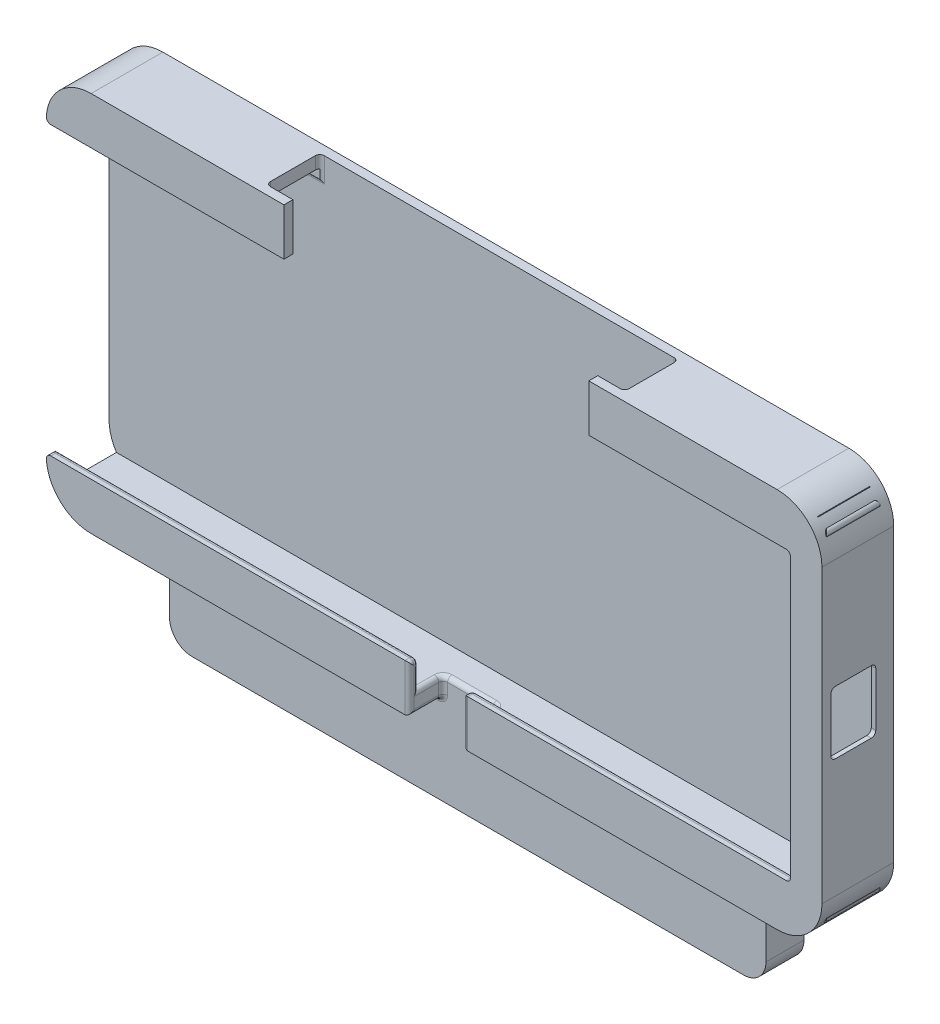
ISO-10303-21;
HEADER;
FILE_DESCRIPTION(('STEP AP214'),'2;1');
FILE_NAME('part.step','',(''),(''),'','','');
FILE_SCHEMA(('AUTOMOTIVE_DESIGN { 1 0 10303 214 1 1 1 1 }'));
ENDSEC;
DATA;
#1=APPLICATION_CONTEXT('core data for automotive mechanical design processes');
#2=APPLICATION_PROTOCOL_DEFINITION('international standard','automotive_design',2000,#1);
#3=PRODUCT_CONTEXT('',#1,'mechanical');
#4=PRODUCT('Part','Part','',(#3));
#5=PRODUCT_RELATED_PRODUCT_CATEGORY('part','',(#4));
#6=PRODUCT_DEFINITION_FORMATION('','',#4);
#7=PRODUCT_DEFINITION_CONTEXT('part definition',#1,'design');
#8=PRODUCT_DEFINITION('design','',#6,#7);
#9=PRODUCT_DEFINITION_SHAPE('','',#8);
#10=(LENGTH_UNIT() NAMED_UNIT(*) SI_UNIT(.MILLI.,.METRE.));
#11=(NAMED_UNIT(*) PLANE_ANGLE_UNIT() SI_UNIT($,.RADIAN.));
#12=(NAMED_UNIT(*) SI_UNIT($,.STERADIAN.) SOLID_ANGLE_UNIT());
#13=UNCERTAINTY_MEASURE_WITH_UNIT(LENGTH_MEASURE(1.E-05),#10,'distance_accuracy_value','');
#14=(GEOMETRIC_REPRESENTATION_CONTEXT(3) GLOBAL_UNCERTAINTY_ASSIGNED_CONTEXT((#13)) GLOBAL_UNIT_ASSIGNED_CONTEXT((#10,
#11,#12)) REPRESENTATION_CONTEXT('',''));
#15=CARTESIAN_POINT('',(0.,0.,0.));
#16=DIRECTION('',(0.,0.,1.));
#17=DIRECTION('',(1.,0.,0.));
#18=AXIS2_PLACEMENT_3D('',#15,#16,#17);
#19=CARTESIAN_POINT('',(0.,4.5,2.));
#20=DIRECTION('',(0.,-1.,0.));
#21=DIRECTION('',(0.,0.,-1.));
#22=AXIS2_PLACEMENT_3D('',#19,#20,#21);
#23=PLANE('',#22);
#24=CARTESIAN_POINT('',(92.,4.5,9.5));
#25=DIRECTION('',(0.,-1.,0.));
#26=DIRECTION('',(0.,0.,-1.));
#27=AXIS2_PLACEMENT_3D('',#24,#25,#26);
#28=CIRCLE('',#27,2.);
#29=CARTESIAN_POINT('',(94.,4.5,9.5));
#30=VERTEX_POINT('',#29);
#31=CARTESIAN_POINT('',(92.,4.5,7.5));
#32=VERTEX_POINT('',#31);
#33=EDGE_CURVE('E1867',#30,#32,#28,.F.);
#34=ORIENTED_EDGE('',*,*,#33,.F.);
#35=DIRECTION('',(0.,0.,-1.));
#36=VECTOR('',#35,1.);
#37=CARTESIAN_POINT('',(94.,4.5,14.));
#38=LINE('',#37,#36);
#39=CARTESIAN_POINT('',(94.,4.5,14.));
#40=VERTEX_POINT('',#39);
#41=EDGE_CURVE('E1871',#30,#40,#38,.F.);
#42=ORIENTED_EDGE('',*,*,#41,.T.);
#43=DIRECTION('',(-1.,0.,0.));
#44=VECTOR('',#43,1.);
#45=CARTESIAN_POINT('',(0.,4.5,14.));
#46=LINE('',#45,#44);
#47=CARTESIAN_POINT('',(171.,4.5,14.));
#48=VERTEX_POINT('',#47);
#49=EDGE_CURVE('E701',#48,#40,#46,.T.);
#50=ORIENTED_EDGE('',*,*,#49,.F.);
#51=DIRECTION('',(0.,0.,1.));
#52=VECTOR('',#51,1.);
#53=CARTESIAN_POINT('',(171.,4.5,2.));
#54=LINE('',#53,#52);
#55=CARTESIAN_POINT('',(171.,4.5,2.));
#56=VERTEX_POINT('',#55);
#57=EDGE_CURVE('E829',#48,#56,#54,.F.);
#58=ORIENTED_EDGE('',*,*,#57,.T.);
#59=DIRECTION('',(1.,0.,0.));
#60=VECTOR('',#59,1.);
#61=CARTESIAN_POINT('',(0.,4.5,2.));
#62=LINE('',#61,#60);
#63=CARTESIAN_POINT('',(1.64835345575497,4.5,2.));
#64=VERTEX_POINT('',#63);
#65=EDGE_CURVE('E721',#64,#56,#62,.T.);
#66=ORIENTED_EDGE('',*,*,#65,.F.);
#67=DIRECTION('',(0.,0.,-1.));
#68=VECTOR('',#67,1.);
#69=CARTESIAN_POINT('',(1.64835345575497,4.5,2.));
#70=LINE('',#69,#68);
#71=CARTESIAN_POINT('',(1.64835345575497,4.5,14.));
#72=VERTEX_POINT('',#71);
#73=EDGE_CURVE('E1059',#64,#72,#70,.F.);
#74=ORIENTED_EDGE('',*,*,#73,.T.);
#75=CARTESIAN_POINT('',(80.,4.5,14.));
#76=VERTEX_POINT('',#75);
#77=EDGE_CURVE('E705',#76,#72,#46,.T.);
#78=ORIENTED_EDGE('',*,*,#77,.F.);
#79=DIRECTION('',(0.,0.,-1.));
#80=VECTOR('',#79,1.);
#81=CARTESIAN_POINT('',(80.,4.5,2.));
#82=LINE('',#81,#80);
#83=CARTESIAN_POINT('',(80.,4.5,9.5));
#84=VERTEX_POINT('',#83);
#85=EDGE_CURVE('E1861',#76,#84,#82,.T.);
#86=ORIENTED_EDGE('',*,*,#85,.T.);
#87=CARTESIAN_POINT('',(82.,4.5,9.5));
#88=DIRECTION('',(0.,-1.,0.));
#89=DIRECTION('',(0.,0.,-1.));
#90=AXIS2_PLACEMENT_3D('',#87,#88,#89);
#91=CIRCLE('',#90,2.);
#92=CARTESIAN_POINT('',(82.,4.5,7.5));
#93=VERTEX_POINT('',#92);
#94=EDGE_CURVE('E1857',#93,#84,#91,.F.);
#95=ORIENTED_EDGE('',*,*,#94,.F.);
#96=DIRECTION('',(1.,0.,0.));
#97=VECTOR('',#96,1.);
#98=CARTESIAN_POINT('',(93.,4.5,7.5));
#99=LINE('',#98,#97);
#100=EDGE_CURVE('E1864',#93,#32,#99,.T.);
#101=ORIENTED_EDGE('',*,*,#100,.T.);
#102=EDGE_LOOP('',(#34,#42,#50,#58,#66,#74,#78,#86,#95,#101));
#103=FACE_BOUND('',#102,.T.);
#104=ADVANCED_FACE('F69',(#103),#23,.F.);
#105=CARTESIAN_POINT('',(0.,0.,16.));
#106=DIRECTION('',(0.,1.,0.));
#107=DIRECTION('',(0.,0.,1.));
#108=AXIS2_PLACEMENT_3D('',#105,#106,#107);
#109=PLANE('',#108);
#110=DIRECTION('',(1.,0.,0.));
#111=VECTOR('',#110,1.);
#112=CARTESIAN_POINT('',(0.,0.,9.5));
#113=LINE('',#112,#111);
#114=CARTESIAN_POINT('',(94.,0.,9.5));
#115=VERTEX_POINT('',#114);
#116=CARTESIAN_POINT('',(153.,0.,9.5));
#117=VERTEX_POINT('',#116);
#118=EDGE_CURVE('E1832',#115,#117,#113,.T.);
#119=ORIENTED_EDGE('',*,*,#118,.T.);
#120=DIRECTION('',(0.,0.,1.));
#121=VECTOR('',#120,1.);
#122=CARTESIAN_POINT('',(153.,0.,0.));
#123=LINE('',#122,#121);
#124=CARTESIAN_POINT('',(153.,0.,0.));
#125=VERTEX_POINT('',#124);
#126=EDGE_CURVE('E677',#125,#117,#123,.T.);
#127=ORIENTED_EDGE('',*,*,#126,.F.);
#128=DIRECTION('',(-1.,0.,0.));
#129=VECTOR('',#128,1.);
#130=CARTESIAN_POINT('',(180.,0.,0.));
#131=LINE('',#130,#129);
#132=CARTESIAN_POINT('',(163.,0.,0.));
#133=VERTEX_POINT('',#132);
#134=EDGE_CURVE('E681',#133,#125,#131,.T.);
#135=ORIENTED_EDGE('',*,*,#134,.F.);
#136=DIRECTION('',(0.,0.,1.));
#137=VECTOR('',#136,1.);
#138=CARTESIAN_POINT('',(163.,0.,16.));
#139=LINE('',#138,#137);
#140=CARTESIAN_POINT('',(163.,0.,16.));
#141=VERTEX_POINT('',#140);
#142=EDGE_CURVE('E1014',#133,#141,#139,.T.);
#143=ORIENTED_EDGE('',*,*,#142,.T.);
#144=DIRECTION('',(1.,0.,0.));
#145=VECTOR('',#144,1.);
#146=CARTESIAN_POINT('',(0.,0.,16.));
#147=LINE('',#146,#145);
#148=CARTESIAN_POINT('',(94.,0.,16.));
#149=VERTEX_POINT('',#148);
#150=EDGE_CURVE('E749',#149,#141,#147,.T.);
#151=ORIENTED_EDGE('',*,*,#150,.F.);
#152=DIRECTION('',(0.,0.,-1.));
#153=VECTOR('',#152,1.);
#154=CARTESIAN_POINT('',(94.,0.,8.5));
#155=LINE('',#154,#153);
#156=EDGE_CURVE('E1121',#149,#115,#155,.T.);
#157=ORIENTED_EDGE('',*,*,#156,.T.);
#158=EDGE_LOOP('',(#119,#127,#135,#143,#151,#157));
#159=FACE_BOUND('',#158,.T.);
#160=ADVANCED_FACE('F1156',(#159),#109,.F.);
#161=CARTESIAN_POINT('',(0.,0.,16.));
#162=DIRECTION('',(0.,0.,-1.));
#163=DIRECTION('',(-1.,0.,0.));
#164=AXIS2_PLACEMENT_3D('',#161,#162,#163);
#165=PLANE('',#164);
#166=DIRECTION('',(-1.,0.,0.));
#167=VECTOR('',#166,1.);
#168=CARTESIAN_POINT('',(0.,10.5,16.));
#169=LINE('',#168,#167);
#170=CARTESIAN_POINT('',(165.,10.5,16.));
#171=VERTEX_POINT('',#170);
#172=CARTESIAN_POINT('',(94.,10.5,16.));
#173=VERTEX_POINT('',#172);
#174=EDGE_CURVE('E706',#171,#173,#169,.T.);
#175=ORIENTED_EDGE('',*,*,#174,.T.);
#176=DIRECTION('',(0.,-1.,0.));
#177=VECTOR('',#176,1.);
#178=CARTESIAN_POINT('',(94.,0.,16.));
#179=LINE('',#178,#177);
#180=EDGE_CURVE('E1773',#173,#149,#179,.T.);
#181=ORIENTED_EDGE('',*,*,#180,.T.);
#182=ORIENTED_EDGE('',*,*,#150,.T.);
#183=CARTESIAN_POINT('',(163.,10.,16.));
#184=DIRECTION('',(0.,0.,-1.));
#185=DIRECTION('',(-1.,0.,0.));
#186=AXIS2_PLACEMENT_3D('',#183,#184,#185);
#187=CIRCLE('',#186,10.);
#188=CARTESIAN_POINT('',(173.,9.99999999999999,16.));
#189=VERTEX_POINT('',#188);
#190=EDGE_CURVE('E1024',#141,#189,#187,.F.);
#191=ORIENTED_EDGE('',*,*,#190,.T.);
#192=DIRECTION('',(0.,-1.,0.));
#193=VECTOR('',#192,1.);
#194=CARTESIAN_POINT('',(173.,85.,16.));
#195=LINE('',#194,#193);
#196=CARTESIAN_POINT('',(173.,75.,16.));
#197=VERTEX_POINT('',#196);
#198=EDGE_CURVE('E673',#197,#189,#195,.T.);
#199=ORIENTED_EDGE('',*,*,#198,.F.);
#200=CARTESIAN_POINT('',(163.,75.,16.));
#201=DIRECTION('',(0.,0.,-1.));
#202=DIRECTION('',(-1.,0.,0.));
#203=AXIS2_PLACEMENT_3D('',#200,#201,#202);
#204=CIRCLE('',#203,10.);
#205=CARTESIAN_POINT('',(163.,85.,16.));
#206=VERTEX_POINT('',#205);
#207=EDGE_CURVE('E1018',#197,#206,#204,.F.);
#208=ORIENTED_EDGE('',*,*,#207,.T.);
#209=DIRECTION('',(-1.,0.,0.));
#210=VECTOR('',#209,1.);
#211=CARTESIAN_POINT('',(0.,85.,16.));
#212=LINE('',#211,#210);
#213=CARTESIAN_POINT('',(121.,85.,16.));
#214=VERTEX_POINT('',#213);
#215=EDGE_CURVE('E750',#206,#214,#212,.T.);
#216=ORIENTED_EDGE('',*,*,#215,.T.);
#217=DIRECTION('',(0.,1.,0.));
#218=VECTOR('',#217,1.);
#219=CARTESIAN_POINT('',(121.,68.1754446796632,16.));
#220=LINE('',#219,#218);
#221=CARTESIAN_POINT('',(121.,74.5,16.));
#222=VERTEX_POINT('',#221);
#223=EDGE_CURVE('E629',#222,#214,#220,.T.);
#224=ORIENTED_EDGE('',*,*,#223,.F.);
#225=DIRECTION('',(1.,0.,0.));
#226=VECTOR('',#225,1.);
#227=CARTESIAN_POINT('',(0.,74.5,16.));
#228=LINE('',#227,#226);
#229=CARTESIAN_POINT('',(165.,74.5,16.));
#230=VERTEX_POINT('',#229);
#231=EDGE_CURVE('E700',#222,#230,#228,.T.);
#232=ORIENTED_EDGE('',*,*,#231,.T.);
#233=CARTESIAN_POINT('',(165.,73.5,16.));
#234=DIRECTION('',(0.,0.,-1.));
#235=DIRECTION('',(-1.,0.,0.));
#236=AXIS2_PLACEMENT_3D('',#233,#234,#235);
#237=CIRCLE('',#236,1.);
#238=CARTESIAN_POINT('',(166.,73.5,16.));
#239=VERTEX_POINT('',#238);
#240=EDGE_CURVE('E899',#230,#239,#237,.T.);
#241=ORIENTED_EDGE('',*,*,#240,.T.);
#242=DIRECTION('',(0.,-1.,0.));
#243=VECTOR('',#242,1.);
#244=CARTESIAN_POINT('',(166.,74.5,16.));
#245=LINE('',#244,#243);
#246=CARTESIAN_POINT('',(166.,11.5,16.));
#247=VERTEX_POINT('',#246);
#248=EDGE_CURVE('E688',#239,#247,#245,.T.);
#249=ORIENTED_EDGE('',*,*,#248,.T.);
#250=CARTESIAN_POINT('',(165.,11.5,16.));
#251=DIRECTION('',(0.,0.,-1.));
#252=DIRECTION('',(-1.,0.,0.));
#253=AXIS2_PLACEMENT_3D('',#250,#251,#252);
#254=CIRCLE('',#253,1.);
#255=EDGE_CURVE('E902',#247,#171,#254,.T.);
#256=ORIENTED_EDGE('',*,*,#255,.T.);
#257=EDGE_LOOP('',(#175,#181,#182,#191,#199,#208,#216,#224,#232,#241,#249,#256));
#258=FACE_BOUND('',#257,.T.);
#259=ADVANCED_FACE('F1162',(#258),#165,.F.);
#260=CARTESIAN_POINT('',(0.,0.,14.));
#261=DIRECTION('',(0.,0.,1.));
#262=DIRECTION('',(1.,0.,0.));
#263=AXIS2_PLACEMENT_3D('',#260,#261,#262);
#264=PLANE('',#263);
#265=DIRECTION('',(0.,-1.,0.));
#266=VECTOR('',#265,1.);
#267=CARTESIAN_POINT('',(173.,50.5,14.));
#268=LINE('',#267,#266);
#269=CARTESIAN_POINT('',(173.,49.5,14.));
#270=VERTEX_POINT('',#269);
#271=CARTESIAN_POINT('',(173.,37.5,14.));
#272=VERTEX_POINT('',#271);
#273=EDGE_CURVE('E1621',#270,#272,#268,.T.);
#274=ORIENTED_EDGE('',*,*,#273,.T.);
#275=DIRECTION('',(1.,0.,0.));
#276=VECTOR('',#275,1.);
#277=CARTESIAN_POINT('',(172.,37.5,14.));
#278=LINE('',#277,#276);
#279=CARTESIAN_POINT('',(172.,37.5,14.));
#280=VERTEX_POINT('',#279);
#281=EDGE_CURVE('E1382',#272,#280,#278,.F.);
#282=ORIENTED_EDGE('',*,*,#281,.T.);
#283=DIRECTION('',(0.,-1.,0.));
#284=VECTOR('',#283,1.);
#285=CARTESIAN_POINT('',(172.,0.,14.));
#286=LINE('',#285,#284);
#287=CARTESIAN_POINT('',(172.,5.5,14.));
#288=VERTEX_POINT('',#287);
#289=EDGE_CURVE('E692',#280,#288,#286,.T.);
#290=ORIENTED_EDGE('',*,*,#289,.T.);
#291=CARTESIAN_POINT('',(171.,5.5,14.));
#292=DIRECTION('',(0.,0.,1.));
#293=DIRECTION('',(1.,0.,0.));
#294=AXIS2_PLACEMENT_3D('',#291,#292,#293);
#295=CIRCLE('',#294,1.);
#296=EDGE_CURVE('E804',#288,#48,#295,.F.);
#297=ORIENTED_EDGE('',*,*,#296,.T.);
#298=ORIENTED_EDGE('',*,*,#49,.T.);
#299=DIRECTION('',(0.,-1.,0.));
#300=VECTOR('',#299,1.);
#301=CARTESIAN_POINT('',(94.,9.49999999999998,14.));
#302=LINE('',#301,#300);
#303=CARTESIAN_POINT('',(94.,9.5,14.));
#304=VERTEX_POINT('',#303);
#305=EDGE_CURVE('E1780',#40,#304,#302,.F.);
#306=ORIENTED_EDGE('',*,*,#305,.T.);
#307=DIRECTION('',(-1.,0.,0.));
#308=VECTOR('',#307,1.);
#309=CARTESIAN_POINT('',(166.,9.50000000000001,14.));
#310=LINE('',#309,#308);
#311=CARTESIAN_POINT('',(165.,9.50000000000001,14.));
#312=VERTEX_POINT('',#311);
#313=EDGE_CURVE('E799',#304,#312,#310,.F.);
#314=ORIENTED_EDGE('',*,*,#313,.T.);
#315=CARTESIAN_POINT('',(165.,11.5,14.));
#316=DIRECTION('',(0.,0.,1.));
#317=DIRECTION('',(1.,0.,0.));
#318=AXIS2_PLACEMENT_3D('',#315,#316,#317);
#319=CIRCLE('',#318,2.);
#320=CARTESIAN_POINT('',(167.,11.5,14.));
#321=VERTEX_POINT('',#320);
#322=EDGE_CURVE('E795',#321,#312,#319,.F.);
#323=ORIENTED_EDGE('',*,*,#322,.F.);
#324=DIRECTION('',(0.,-1.,0.));
#325=VECTOR('',#324,1.);
#326=CARTESIAN_POINT('',(167.,74.5,14.));
#327=LINE('',#326,#325);
#328=CARTESIAN_POINT('',(167.,73.5,14.));
#329=VERTEX_POINT('',#328);
#330=EDGE_CURVE('E792',#321,#329,#327,.F.);
#331=ORIENTED_EDGE('',*,*,#330,.T.);
#332=CARTESIAN_POINT('',(165.,73.5,14.));
#333=DIRECTION('',(0.,0.,1.));
#334=DIRECTION('',(1.,0.,0.));
#335=AXIS2_PLACEMENT_3D('',#332,#333,#334);
#336=CIRCLE('',#335,2.);
#337=CARTESIAN_POINT('',(165.,75.5,14.));
#338=VERTEX_POINT('',#337);
#339=EDGE_CURVE('E788',#338,#329,#336,.F.);
#340=ORIENTED_EDGE('',*,*,#339,.F.);
#341=DIRECTION('',(1.,0.,0.));
#342=VECTOR('',#341,1.);
#343=CARTESIAN_POINT('',(121.,75.5,14.));
#344=LINE('',#343,#342);
#345=CARTESIAN_POINT('',(121.,75.5,14.));
#346=VERTEX_POINT('',#345);
#347=EDGE_CURVE('E785',#338,#346,#344,.F.);
#348=ORIENTED_EDGE('',*,*,#347,.T.);
#349=DIRECTION('',(0.,1.,0.));
#350=VECTOR('',#349,1.);
#351=CARTESIAN_POINT('',(121.,68.1754446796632,14.));
#352=LINE('',#351,#350);
#353=CARTESIAN_POINT('',(121.,85.,14.));
#354=VERTEX_POINT('',#353);
#355=EDGE_CURVE('E621',#346,#354,#352,.T.);
#356=ORIENTED_EDGE('',*,*,#355,.T.);
#357=DIRECTION('',(-1.,0.,0.));
#358=VECTOR('',#357,1.);
#359=CARTESIAN_POINT('',(127.,85.,14.));
#360=LINE('',#359,#358);
#361=CARTESIAN_POINT('',(126.,85.,14.));
#362=VERTEX_POINT('',#361);
#363=EDGE_CURVE('E622',#362,#354,#360,.T.);
#364=ORIENTED_EDGE('',*,*,#363,.F.);
#365=DIRECTION('',(0.,1.,0.));
#366=VECTOR('',#365,1.);
#367=CARTESIAN_POINT('',(126.,80.5,14.));
#368=LINE('',#367,#366);
#369=CARTESIAN_POINT('',(126.,81.5,14.));
#370=VERTEX_POINT('',#369);
#371=EDGE_CURVE('E779',#362,#370,#368,.F.);
#372=ORIENTED_EDGE('',*,*,#371,.T.);
#373=CARTESIAN_POINT('',(128.,81.5,14.));
#374=DIRECTION('',(0.,0.,1.));
#375=DIRECTION('',(1.,0.,0.));
#376=AXIS2_PLACEMENT_3D('',#373,#374,#375);
#377=CIRCLE('',#376,2.);
#378=CARTESIAN_POINT('',(128.,79.5,14.));
#379=VERTEX_POINT('',#378);
#380=EDGE_CURVE('E775',#379,#370,#377,.F.);
#381=ORIENTED_EDGE('',*,*,#380,.F.);
#382=DIRECTION('',(1.,0.,0.));
#383=VECTOR('',#382,1.);
#384=CARTESIAN_POINT('',(0.,79.5,14.));
#385=LINE('',#384,#383);
#386=CARTESIAN_POINT('',(172.,79.5,14.));
#387=VERTEX_POINT('',#386);
#388=EDGE_CURVE('E782',#379,#387,#385,.T.);
#389=ORIENTED_EDGE('',*,*,#388,.T.);
#390=CARTESIAN_POINT('',(172.,49.5,14.));
#391=VERTEX_POINT('',#390);
#392=EDGE_CURVE('E694',#387,#391,#286,.T.);
#393=ORIENTED_EDGE('',*,*,#392,.T.);
#394=DIRECTION('',(1.,0.,0.));
#395=VECTOR('',#394,1.);
#396=CARTESIAN_POINT('',(173.,49.5,14.));
#397=LINE('',#396,#395);
#398=EDGE_CURVE('E1375',#391,#270,#397,.T.);
#399=ORIENTED_EDGE('',*,*,#398,.T.);
#400=EDGE_LOOP('',(#274,#282,#290,#297,#298,#306,#314,#323,#331,#340,#348,#356,#364,#372,#381,
#389,#393,#399));
#401=FACE_BOUND('',#400,.T.);
#402=ADVANCED_FACE('F1273',(#401),#264,.F.);
#403=CARTESIAN_POINT('',(0.,10.5,14.));
#404=DIRECTION('',(0.,1.,0.));
#405=DIRECTION('',(-1.,0.,0.));
#406=AXIS2_PLACEMENT_3D('',#403,#404,#405);
#407=PLANE('',#406);
#408=DIRECTION('',(-1.,0.,0.));
#409=VECTOR('',#408,1.);
#410=CARTESIAN_POINT('',(0.,10.5,15.));
#411=LINE('',#410,#409);
#412=CARTESIAN_POINT('',(165.,10.5,15.));
#413=VERTEX_POINT('',#412);
#414=CARTESIAN_POINT('',(94.,10.5,15.));
#415=VERTEX_POINT('',#414);
#416=EDGE_CURVE('E768',#413,#415,#411,.T.);
#417=ORIENTED_EDGE('',*,*,#416,.T.);
#418=DIRECTION('',(0.,0.,1.));
#419=VECTOR('',#418,1.);
#420=CARTESIAN_POINT('',(94.,10.5,14.));
#421=LINE('',#420,#419);
#422=EDGE_CURVE('E1769',#415,#173,#421,.T.);
#423=ORIENTED_EDGE('',*,*,#422,.T.);
#424=ORIENTED_EDGE('',*,*,#174,.F.);
#425=DIRECTION('',(0.,0.,1.));
#426=VECTOR('',#425,1.);
#427=CARTESIAN_POINT('',(165.,10.5,14.));
#428=LINE('',#427,#426);
#429=EDGE_CURVE('E772',#171,#413,#428,.F.);
#430=ORIENTED_EDGE('',*,*,#429,.T.);
#431=EDGE_LOOP('',(#417,#423,#424,#430));
#432=FACE_BOUND('',#431,.T.);
#433=ADVANCED_FACE('F1737',(#432),#407,.T.);
#434=CARTESIAN_POINT('',(0.,9.49999999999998,15.));
#435=DIRECTION('',(1.,0.,0.));
#436=DIRECTION('',(0.,1.,0.));
#437=AXIS2_PLACEMENT_3D('',#434,#435,#436);
#438=CYLINDRICAL_SURFACE('',#437,1.);
#439=ORIENTED_EDGE('',*,*,#313,.F.);
#440=CARTESIAN_POINT('',(94.,9.5,15.));
#441=DIRECTION('',(1.,0.,0.));
#442=DIRECTION('',(0.,1.,0.));
#443=AXIS2_PLACEMENT_3D('',#440,#441,#442);
#444=CIRCLE('',#443,1.);
#445=EDGE_CURVE('E1774',#304,#415,#444,.T.);
#446=ORIENTED_EDGE('',*,*,#445,.T.);
#447=ORIENTED_EDGE('',*,*,#416,.F.);
#448=CARTESIAN_POINT('',(165.,9.50000000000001,15.));
#449=DIRECTION('',(1.,0.,0.));
#450=DIRECTION('',(0.,0.,-1.));
#451=AXIS2_PLACEMENT_3D('',#448,#449,#450);
#452=CIRCLE('',#451,1.);
#453=EDGE_CURVE('E922',#413,#312,#452,.F.);
#454=ORIENTED_EDGE('',*,*,#453,.T.);
#455=EDGE_LOOP('',(#439,#446,#447,#454));
#456=FACE_BOUND('',#455,.T.);
#457=ADVANCED_FACE('F1885',(#456),#438,.T.);
#458=CARTESIAN_POINT('',(53.,85.,16.));
#459=VERTEX_POINT('',#458);
#460=CARTESIAN_POINT('',(10.,85.,16.));
#461=VERTEX_POINT('',#460);
#462=EDGE_CURVE('E748',#459,#461,#212,.T.);
#463=ORIENTED_EDGE('',*,*,#462,.T.);
#464=CARTESIAN_POINT('',(10.,75.,16.));
#465=DIRECTION('',(0.,0.,-1.));
#466=DIRECTION('',(-1.,0.,0.));
#467=AXIS2_PLACEMENT_3D('',#464,#465,#466);
#468=CIRCLE('',#467,10.);
#469=CARTESIAN_POINT('',(0.00722344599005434,75.3800220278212,16.));
#470=VERTEX_POINT('',#469);
#471=EDGE_CURVE('E1289',#461,#470,#468,.F.);
#472=ORIENTED_EDGE('',*,*,#471,.T.);
#473=CARTESIAN_POINT('',(1.,75.5,16.));
#474=DIRECTION('',(0.,0.,-1.));
#475=DIRECTION('',(-1.,0.,0.));
#476=AXIS2_PLACEMENT_3D('',#473,#474,#475);
#477=CIRCLE('',#476,1.);
#478=CARTESIAN_POINT('',(1.,74.5,16.));
#479=VERTEX_POINT('',#478);
#480=EDGE_CURVE('E889',#470,#479,#477,.F.);
#481=ORIENTED_EDGE('',*,*,#480,.T.);
#482=CARTESIAN_POINT('',(53.,74.5,16.));
#483=VERTEX_POINT('',#482);
#484=EDGE_CURVE('E693',#479,#483,#228,.T.);
#485=ORIENTED_EDGE('',*,*,#484,.T.);
#486=DIRECTION('',(0.,1.,0.));
#487=VECTOR('',#486,1.);
#488=CARTESIAN_POINT('',(53.,68.1754446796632,16.));
#489=LINE('',#488,#487);
#490=EDGE_CURVE('E641',#483,#459,#489,.T.);
#491=ORIENTED_EDGE('',*,*,#490,.T.);
#492=EDGE_LOOP('',(#463,#472,#481,#485,#491));
#493=FACE_BOUND('',#492,.T.);
#494=ADVANCED_FACE('F1198',(#493),#165,.F.);
#495=CARTESIAN_POINT('',(1.,75.5,14.));
#496=DIRECTION('',(0.,0.,1.));
#497=DIRECTION('',(1.,0.,0.));
#498=AXIS2_PLACEMENT_3D('',#495,#496,#497);
#499=CIRCLE('',#498,1.);
#500=CARTESIAN_POINT('',(1.,74.5,14.));
#501=VERTEX_POINT('',#500);
#502=CARTESIAN_POINT('',(0.00722344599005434,75.3800220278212,14.));
#503=VERTEX_POINT('',#502);
#504=EDGE_CURVE('E869',#501,#503,#499,.F.);
#505=ORIENTED_EDGE('',*,*,#504,.T.);
#506=CARTESIAN_POINT('',(10.,75.,14.));
#507=DIRECTION('',(0.,0.,1.));
#508=DIRECTION('',(1.,0.,0.));
#509=AXIS2_PLACEMENT_3D('',#506,#507,#508);
#510=CIRCLE('',#509,10.);
#511=CARTESIAN_POINT('',(1.06971445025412,79.5,14.));
#512=VERTEX_POINT('',#511);
#513=EDGE_CURVE('E1298',#503,#512,#510,.F.);
#514=ORIENTED_EDGE('',*,*,#513,.T.);
#515=DIRECTION('',(1.,0.,0.));
#516=VECTOR('',#515,1.);
#517=CARTESIAN_POINT('',(0.,79.5,14.));
#518=LINE('',#517,#516);
#519=CARTESIAN_POINT('',(48.,79.5,14.));
#520=VERTEX_POINT('',#519);
#521=EDGE_CURVE('E876',#512,#520,#518,.T.);
#522=ORIENTED_EDGE('',*,*,#521,.T.);
#523=DIRECTION('',(0.,-1.,0.));
#524=VECTOR('',#523,1.);
#525=CARTESIAN_POINT('',(48.,85.,14.));
#526=LINE('',#525,#524);
#527=CARTESIAN_POINT('',(48.,85.,14.));
#528=VERTEX_POINT('',#527);
#529=EDGE_CURVE('E873',#520,#528,#526,.F.);
#530=ORIENTED_EDGE('',*,*,#529,.T.);
#531=DIRECTION('',(-1.,0.,0.));
#532=VECTOR('',#531,1.);
#533=CARTESIAN_POINT('',(47.,85.,14.));
#534=LINE('',#533,#532);
#535=CARTESIAN_POINT('',(53.,85.,14.));
#536=VERTEX_POINT('',#535);
#537=EDGE_CURVE('E637',#536,#528,#534,.T.);
#538=ORIENTED_EDGE('',*,*,#537,.F.);
#539=DIRECTION('',(0.,1.,0.));
#540=VECTOR('',#539,1.);
#541=CARTESIAN_POINT('',(53.,68.1754446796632,14.));
#542=LINE('',#541,#540);
#543=CARTESIAN_POINT('',(53.,74.5,14.));
#544=VERTEX_POINT('',#543);
#545=EDGE_CURVE('E649',#544,#536,#542,.T.);
#546=ORIENTED_EDGE('',*,*,#545,.F.);
#547=DIRECTION('',(1.,0.,0.));
#548=VECTOR('',#547,1.);
#549=CARTESIAN_POINT('',(0.,74.5,14.));
#550=LINE('',#549,#548);
#551=EDGE_CURVE('E689',#501,#544,#550,.T.);
#552=ORIENTED_EDGE('',*,*,#551,.F.);
#553=EDGE_LOOP('',(#505,#514,#522,#530,#538,#546,#552));
#554=FACE_BOUND('',#553,.T.);
#555=ADVANCED_FACE('F1731',(#554),#264,.F.);
#556=CARTESIAN_POINT('',(0.,74.5,14.));
#557=DIRECTION('',(0.,-1.,0.));
#558=DIRECTION('',(0.,0.,-1.));
#559=AXIS2_PLACEMENT_3D('',#556,#557,#558);
#560=PLANE('',#559);
#561=ORIENTED_EDGE('',*,*,#484,.F.);
#562=DIRECTION('',(0.,0.,1.));
#563=VECTOR('',#562,1.);
#564=CARTESIAN_POINT('',(1.,74.5,14.));
#565=LINE('',#564,#563);
#566=EDGE_CURVE('E892',#479,#501,#565,.F.);
#567=ORIENTED_EDGE('',*,*,#566,.T.);
#568=ORIENTED_EDGE('',*,*,#551,.T.);
#569=DIRECTION('',(0.,0.,-1.));
#570=VECTOR('',#569,1.);
#571=CARTESIAN_POINT('',(53.,74.5,16.));
#572=LINE('',#571,#570);
#573=EDGE_CURVE('E645',#483,#544,#572,.T.);
#574=ORIENTED_EDGE('',*,*,#573,.F.);
#575=EDGE_LOOP('',(#561,#567,#568,#574));
#576=FACE_BOUND('',#575,.T.);
#577=ADVANCED_FACE('F1178',(#576),#560,.T.);
#578=CARTESIAN_POINT('',(172.,0.,2.));
#579=DIRECTION('',(-1.,0.,0.));
#580=DIRECTION('',(0.,0.,1.));
#581=AXIS2_PLACEMENT_3D('',#578,#579,#580);
#582=PLANE('',#581);
#583=DIRECTION('',(0.,0.,-1.));
#584=VECTOR('',#583,1.);
#585=CARTESIAN_POINT('',(172.,50.5,2.));
#586=LINE('',#585,#584);
#587=CARTESIAN_POINT('',(172.,50.5,13.));
#588=VERTEX_POINT('',#587);
#589=CARTESIAN_POINT('',(172.,50.5,5.));
#590=VERTEX_POINT('',#589);
#591=EDGE_CURVE('E1378',#588,#590,#586,.T.);
#592=ORIENTED_EDGE('',*,*,#591,.F.);
#593=CARTESIAN_POINT('',(172.,49.5,13.));
#594=DIRECTION('',(-1.,0.,0.));
#595=DIRECTION('',(0.,0.,1.));
#596=AXIS2_PLACEMENT_3D('',#593,#594,#595);
#597=CIRCLE('',#596,1.);
#598=EDGE_CURVE('E12',#588,#391,#597,.F.);
#599=ORIENTED_EDGE('',*,*,#598,.T.);
#600=ORIENTED_EDGE('',*,*,#392,.F.);
#601=DIRECTION('',(0.,0.,1.));
#602=VECTOR('',#601,1.);
#603=CARTESIAN_POINT('',(172.,79.5,2.));
#604=LINE('',#603,#602);
#605=CARTESIAN_POINT('',(172.,79.5,2.));
#606=VERTEX_POINT('',#605);
#607=EDGE_CURVE('E822',#387,#606,#604,.F.);
#608=ORIENTED_EDGE('',*,*,#607,.T.);
#609=DIRECTION('',(0.,-1.,0.));
#610=VECTOR('',#609,1.);
#611=CARTESIAN_POINT('',(172.,0.,2.));
#612=LINE('',#611,#610);
#613=CARTESIAN_POINT('',(172.,5.5,2.));
#614=VERTEX_POINT('',#613);
#615=EDGE_CURVE('E697',#606,#614,#612,.T.);
#616=ORIENTED_EDGE('',*,*,#615,.T.);
#617=DIRECTION('',(0.,0.,1.));
#618=VECTOR('',#617,1.);
#619=CARTESIAN_POINT('',(172.,5.5,2.));
#620=LINE('',#619,#618);
#621=EDGE_CURVE('E825',#614,#288,#620,.T.);
#622=ORIENTED_EDGE('',*,*,#621,.T.);
#623=ORIENTED_EDGE('',*,*,#289,.F.);
#624=CARTESIAN_POINT('',(172.,37.5,13.));
#625=DIRECTION('',(-1.,0.,0.));
#626=DIRECTION('',(0.,0.,1.));
#627=AXIS2_PLACEMENT_3D('',#624,#625,#626);
#628=CIRCLE('',#627,1.);
#629=CARTESIAN_POINT('',(172.,36.5,13.));
#630=VERTEX_POINT('',#629);
#631=EDGE_CURVE('E1408',#280,#630,#628,.F.);
#632=ORIENTED_EDGE('',*,*,#631,.T.);
#633=DIRECTION('',(0.,0.,1.));
#634=VECTOR('',#633,1.);
#635=CARTESIAN_POINT('',(172.,36.5,2.));
#636=LINE('',#635,#634);
#637=CARTESIAN_POINT('',(172.,36.5,5.));
#638=VERTEX_POINT('',#637);
#639=EDGE_CURVE('E1421',#638,#630,#636,.T.);
#640=ORIENTED_EDGE('',*,*,#639,.F.);
#641=CARTESIAN_POINT('',(172.,37.5,5.));
#642=DIRECTION('',(-1.,0.,0.));
#643=DIRECTION('',(0.,0.,1.));
#644=AXIS2_PLACEMENT_3D('',#641,#642,#643);
#645=CIRCLE('',#644,1.);
#646=CARTESIAN_POINT('',(172.,37.5,4.));
#647=VERTEX_POINT('',#646);
#648=EDGE_CURVE('E1402',#638,#647,#645,.F.);
#649=ORIENTED_EDGE('',*,*,#648,.T.);
#650=DIRECTION('',(0.,-1.,0.));
#651=VECTOR('',#650,1.);
#652=CARTESIAN_POINT('',(172.,0.,3.99999999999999));
#653=LINE('',#652,#651);
#654=CARTESIAN_POINT('',(172.,49.5,4.));
#655=VERTEX_POINT('',#654);
#656=EDGE_CURVE('E598',#655,#647,#653,.T.);
#657=ORIENTED_EDGE('',*,*,#656,.F.);
#658=CARTESIAN_POINT('',(172.,49.5,5.));
#659=DIRECTION('',(-1.,0.,0.));
#660=DIRECTION('',(0.,0.,1.));
#661=AXIS2_PLACEMENT_3D('',#658,#659,#660);
#662=CIRCLE('',#661,1.);
#663=EDGE_CURVE('E1413',#655,#590,#662,.F.);
#664=ORIENTED_EDGE('',*,*,#663,.T.);
#665=EDGE_LOOP('',(#592,#599,#600,#608,#616,#622,#623,#632,#640,#649,#657,#664));
#666=FACE_BOUND('',#665,.T.);
#667=ADVANCED_FACE('F1174',(#666),#582,.T.);
#668=CARTESIAN_POINT('',(0.,80.5,2.));
#669=DIRECTION('',(0.,-1.,0.));
#670=DIRECTION('',(1.,0.,0.));
#671=AXIS2_PLACEMENT_3D('',#668,#669,#670);
#672=PLANE('',#671);
#673=DIRECTION('',(0.,0.,1.));
#674=VECTOR('',#673,1.);
#675=CARTESIAN_POINT('',(170.,80.5,2.));
#676=LINE('',#675,#674);
#677=CARTESIAN_POINT('',(170.,80.5,3.));
#678=VERTEX_POINT('',#677);
#679=CARTESIAN_POINT('',(170.,80.5,13.));
#680=VERTEX_POINT('',#679);
#681=EDGE_CURVE('E606',#678,#680,#676,.T.);
#682=ORIENTED_EDGE('',*,*,#681,.F.);
#683=DIRECTION('',(1.,0.,0.));
#684=VECTOR('',#683,1.);
#685=CARTESIAN_POINT('',(172.,80.5,3.));
#686=LINE('',#685,#684);
#687=CARTESIAN_POINT('',(171.,80.5,3.));
#688=VERTEX_POINT('',#687);
#689=EDGE_CURVE('E603',#678,#688,#686,.T.);
#690=ORIENTED_EDGE('',*,*,#689,.T.);
#691=DIRECTION('',(0.,0.,1.));
#692=VECTOR('',#691,1.);
#693=CARTESIAN_POINT('',(171.,80.5,14.));
#694=LINE('',#693,#692);
#695=CARTESIAN_POINT('',(171.,80.5,13.));
#696=VERTEX_POINT('',#695);
#697=EDGE_CURVE('E864',#688,#696,#694,.T.);
#698=ORIENTED_EDGE('',*,*,#697,.T.);
#699=DIRECTION('',(1.,0.,0.));
#700=VECTOR('',#699,1.);
#701=CARTESIAN_POINT('',(0.,80.5,13.));
#702=LINE('',#701,#700);
#703=EDGE_CURVE('E860',#696,#680,#702,.F.);
#704=ORIENTED_EDGE('',*,*,#703,.T.);
#705=EDGE_LOOP('',(#682,#690,#698,#704));
#706=FACE_BOUND('',#705,.T.);
#707=ADVANCED_FACE('F1170',(#706),#672,.T.);
#708=CARTESIAN_POINT('',(0.,0.,16.));
#709=DIRECTION('',(1.,0.,0.));
#710=DIRECTION('',(0.,0.,-1.));
#711=AXIS2_PLACEMENT_3D('',#708,#709,#710);
#712=PLANE('',#711);
#713=DIRECTION('',(0.,-1.,0.));
#714=VECTOR('',#713,1.);
#715=CARTESIAN_POINT('',(0.,0.,0.));
#716=LINE('',#715,#714);
#717=CARTESIAN_POINT('',(0.,75.,0.));
#718=VERTEX_POINT('',#717);
#719=CARTESIAN_POINT('',(0.,10.,0.));
#720=VERTEX_POINT('',#719);
#721=EDGE_CURVE('E743',#718,#720,#716,.T.);
#722=ORIENTED_EDGE('',*,*,#721,.T.);
#723=DIRECTION('',(0.,0.,-1.));
#724=VECTOR('',#723,1.);
#725=CARTESIAN_POINT('',(0.,10.,16.));
#726=LINE('',#725,#724);
#727=CARTESIAN_POINT('',(0.,10.,2.));
#728=VERTEX_POINT('',#727);
#729=EDGE_CURVE('E1050',#720,#728,#726,.F.);
#730=ORIENTED_EDGE('',*,*,#729,.T.);
#731=DIRECTION('',(0.,-1.,0.));
#732=VECTOR('',#731,1.);
#733=CARTESIAN_POINT('',(0.,0.,2.));
#734=LINE('',#733,#732);
#735=CARTESIAN_POINT('',(0.,75.,2.));
#736=VERTEX_POINT('',#735);
#737=EDGE_CURVE('E717',#736,#728,#734,.T.);
#738=ORIENTED_EDGE('',*,*,#737,.F.);
#739=DIRECTION('',(0.,0.,-1.));
#740=VECTOR('',#739,1.);
#741=CARTESIAN_POINT('',(0.,75.,16.));
#742=LINE('',#741,#740);
#743=EDGE_CURVE('E1046',#736,#718,#742,.T.);
#744=ORIENTED_EDGE('',*,*,#743,.T.);
#745=EDGE_LOOP('',(#722,#730,#738,#744));
#746=FACE_BOUND('',#745,.T.);
#747=ADVANCED_FACE('F1173',(#746),#712,.F.);
#748=DIRECTION('',(0.,0.,1.));
#749=VECTOR('',#748,1.);
#750=CARTESIAN_POINT('',(20.,0.,0.));
#751=LINE('',#750,#749);
#752=CARTESIAN_POINT('',(20.,0.,0.));
#753=VERTEX_POINT('',#752);
#754=CARTESIAN_POINT('',(20.,0.,9.5));
#755=VERTEX_POINT('',#754);
#756=EDGE_CURVE('E724',#753,#755,#751,.T.);
#757=ORIENTED_EDGE('',*,*,#756,.T.);
#758=DIRECTION('',(1.,0.,0.));
#759=VECTOR('',#758,1.);
#760=CARTESIAN_POINT('',(0.,0.,9.5));
#761=LINE('',#760,#759);
#762=CARTESIAN_POINT('',(80.,0.,9.5));
#763=VERTEX_POINT('',#762);
#764=EDGE_CURVE('E1877',#755,#763,#761,.T.);
#765=ORIENTED_EDGE('',*,*,#764,.T.);
#766=DIRECTION('',(0.,0.,-1.));
#767=VECTOR('',#766,1.);
#768=CARTESIAN_POINT('',(80.,0.,16.));
#769=LINE('',#768,#767);
#770=CARTESIAN_POINT('',(80.,0.,16.));
#771=VERTEX_POINT('',#770);
#772=EDGE_CURVE('E1874',#763,#771,#769,.F.);
#773=ORIENTED_EDGE('',*,*,#772,.T.);
#774=CARTESIAN_POINT('',(10.,0.,16.));
#775=VERTEX_POINT('',#774);
#776=EDGE_CURVE('E744',#775,#771,#147,.T.);
#777=ORIENTED_EDGE('',*,*,#776,.F.);
#778=DIRECTION('',(0.,0.,-1.));
#779=VECTOR('',#778,1.);
#780=CARTESIAN_POINT('',(10.,0.,16.));
#781=LINE('',#780,#779);
#782=CARTESIAN_POINT('',(10.,0.,0.));
#783=VERTEX_POINT('',#782);
#784=EDGE_CURVE('E1010',#775,#783,#781,.T.);
#785=ORIENTED_EDGE('',*,*,#784,.T.);
#786=DIRECTION('',(1.,0.,0.));
#787=VECTOR('',#786,1.);
#788=CARTESIAN_POINT('',(0.,0.,0.));
#789=LINE('',#788,#787);
#790=EDGE_CURVE('E757',#783,#753,#789,.T.);
#791=ORIENTED_EDGE('',*,*,#790,.T.);
#792=EDGE_LOOP('',(#757,#765,#773,#777,#785,#791));
#793=FACE_BOUND('',#792,.T.);
#794=ADVANCED_FACE('F1165',(#793),#109,.F.);
#795=CARTESIAN_POINT('',(0.,85.,16.));
#796=DIRECTION('',(0.,-1.,0.));
#797=DIRECTION('',(0.,0.,-1.));
#798=AXIS2_PLACEMENT_3D('',#795,#796,#797);
#799=PLANE('',#798);
#800=ORIENTED_EDGE('',*,*,#215,.F.);
#801=DIRECTION('',(0.,0.,1.));
#802=VECTOR('',#801,1.);
#803=CARTESIAN_POINT('',(163.,85.,16.));
#804=LINE('',#803,#802);
#805=CARTESIAN_POINT('',(163.,85.,0.));
#806=VERTEX_POINT('',#805);
#807=EDGE_CURVE('E1283',#206,#806,#804,.F.);
#808=ORIENTED_EDGE('',*,*,#807,.T.);
#809=DIRECTION('',(-1.,0.,0.));
#810=VECTOR('',#809,1.);
#811=CARTESIAN_POINT('',(0.,85.,0.));
#812=LINE('',#811,#810);
#813=CARTESIAN_POINT('',(10.,85.,0.));
#814=VERTEX_POINT('',#813);
#815=EDGE_CURVE('E760',#806,#814,#812,.T.);
#816=ORIENTED_EDGE('',*,*,#815,.T.);
#817=DIRECTION('',(0.,0.,-1.));
#818=VECTOR('',#817,1.);
#819=CARTESIAN_POINT('',(10.,85.,16.));
#820=LINE('',#819,#818);
#821=EDGE_CURVE('E1290',#814,#461,#820,.F.);
#822=ORIENTED_EDGE('',*,*,#821,.T.);
#823=ORIENTED_EDGE('',*,*,#462,.F.);
#824=DIRECTION('',(0.,0.,-1.));
#825=VECTOR('',#824,1.);
#826=CARTESIAN_POINT('',(53.,85.,16.));
#827=LINE('',#826,#825);
#828=EDGE_CURVE('E633',#459,#536,#827,.T.);
#829=ORIENTED_EDGE('',*,*,#828,.T.);
#830=ORIENTED_EDGE('',*,*,#537,.T.);
#831=CARTESIAN_POINT('',(48.,85.,13.));
#832=DIRECTION('',(0.,-1.,0.));
#833=DIRECTION('',(0.,0.,-1.));
#834=AXIS2_PLACEMENT_3D('',#831,#832,#833);
#835=CIRCLE('',#834,1.);
#836=CARTESIAN_POINT('',(47.,85.,13.));
#837=VERTEX_POINT('',#836);
#838=EDGE_CURVE('E914',#528,#837,#835,.T.);
#839=ORIENTED_EDGE('',*,*,#838,.T.);
#840=DIRECTION('',(0.,0.,1.));
#841=VECTOR('',#840,1.);
#842=CARTESIAN_POINT('',(47.,85.,-78.6861202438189));
#843=LINE('',#842,#841);
#844=CARTESIAN_POINT('',(47.,85.,3.));
#845=VERTEX_POINT('',#844);
#846=EDGE_CURVE('E661',#845,#837,#843,.T.);
#847=ORIENTED_EDGE('',*,*,#846,.F.);
#848=CARTESIAN_POINT('',(48.,85.,3.));
#849=DIRECTION('',(0.,-1.,0.));
#850=DIRECTION('',(0.,0.,-1.));
#851=AXIS2_PLACEMENT_3D('',#848,#849,#850);
#852=CIRCLE('',#851,1.);
#853=CARTESIAN_POINT('',(48.,85.,2.));
#854=VERTEX_POINT('',#853);
#855=EDGE_CURVE('E911',#845,#854,#852,.T.);
#856=ORIENTED_EDGE('',*,*,#855,.T.);
#857=DIRECTION('',(1.,0.,0.));
#858=VECTOR('',#857,1.);
#859=CARTESIAN_POINT('',(47.,85.,2.));
#860=LINE('',#859,#858);
#861=CARTESIAN_POINT('',(126.,85.,2.));
#862=VERTEX_POINT('',#861);
#863=EDGE_CURVE('E656',#854,#862,#860,.T.);
#864=ORIENTED_EDGE('',*,*,#863,.T.);
#865=CARTESIAN_POINT('',(126.,85.,3.));
#866=DIRECTION('',(0.,-1.,0.));
#867=DIRECTION('',(0.,0.,-1.));
#868=AXIS2_PLACEMENT_3D('',#865,#866,#867);
#869=CIRCLE('',#868,1.);
#870=CARTESIAN_POINT('',(127.,85.,3.));
#871=VERTEX_POINT('',#870);
#872=EDGE_CURVE('E908',#862,#871,#869,.T.);
#873=ORIENTED_EDGE('',*,*,#872,.T.);
#874=DIRECTION('',(0.,0.,1.));
#875=VECTOR('',#874,1.);
#876=CARTESIAN_POINT('',(127.,85.,-78.6861202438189));
#877=LINE('',#876,#875);
#878=CARTESIAN_POINT('',(127.,85.,13.));
#879=VERTEX_POINT('',#878);
#880=EDGE_CURVE('E652',#871,#879,#877,.T.);
#881=ORIENTED_EDGE('',*,*,#880,.T.);
#882=CARTESIAN_POINT('',(126.,85.,13.));
#883=DIRECTION('',(0.,-1.,0.));
#884=DIRECTION('',(0.,0.,-1.));
#885=AXIS2_PLACEMENT_3D('',#882,#883,#884);
#886=CIRCLE('',#885,1.);
#887=EDGE_CURVE('E905',#879,#362,#886,.T.);
#888=ORIENTED_EDGE('',*,*,#887,.T.);
#889=ORIENTED_EDGE('',*,*,#363,.T.);
#890=DIRECTION('',(0.,0.,1.));
#891=VECTOR('',#890,1.);
#892=CARTESIAN_POINT('',(121.,85.,16.));
#893=LINE('',#892,#891);
#894=EDGE_CURVE('E617',#354,#214,#893,.T.);
#895=ORIENTED_EDGE('',*,*,#894,.T.);
#896=EDGE_LOOP('',(#800,#808,#816,#822,#823,#829,#830,#839,#847,#856,#864,#873,#881,#888,#889,#895));
#897=FACE_BOUND('',#896,.T.);
#898=ADVANCED_FACE('F1196',(#897),#799,.F.);
#899=ORIENTED_EDGE('',*,*,#776,.T.);
#900=DIRECTION('',(0.,-1.,0.));
#901=VECTOR('',#900,1.);
#902=CARTESIAN_POINT('',(80.,0.,16.));
#903=LINE('',#902,#901);
#904=CARTESIAN_POINT('',(80.,10.5,16.));
#905=VERTEX_POINT('',#904);
#906=EDGE_CURVE('E1809',#771,#905,#903,.F.);
#907=ORIENTED_EDGE('',*,*,#906,.T.);
#908=CARTESIAN_POINT('',(1.,10.5,16.));
#909=VERTEX_POINT('',#908);
#910=EDGE_CURVE('E710',#905,#909,#169,.T.);
#911=ORIENTED_EDGE('',*,*,#910,.T.);
#912=CARTESIAN_POINT('',(1.,9.49999999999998,16.));
#913=DIRECTION('',(0.,0.,-1.));
#914=DIRECTION('',(-1.,0.,0.));
#915=AXIS2_PLACEMENT_3D('',#912,#913,#914);
#916=CIRCLE('',#915,1.);
#917=CARTESIAN_POINT('',(0.00722344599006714,9.61997797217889,16.));
#918=VERTEX_POINT('',#917);
#919=EDGE_CURVE('E895',#909,#918,#916,.F.);
#920=ORIENTED_EDGE('',*,*,#919,.T.);
#921=CARTESIAN_POINT('',(10.,10.,16.));
#922=DIRECTION('',(0.,0.,-1.));
#923=DIRECTION('',(-1.,0.,0.));
#924=AXIS2_PLACEMENT_3D('',#921,#922,#923);
#925=CIRCLE('',#924,10.);
#926=EDGE_CURVE('E1021',#918,#775,#925,.F.);
#927=ORIENTED_EDGE('',*,*,#926,.T.);
#928=EDGE_LOOP('',(#899,#907,#911,#920,#927));
#929=FACE_BOUND('',#928,.T.);
#930=ADVANCED_FACE('F1193',(#929),#165,.F.);
#931=CARTESIAN_POINT('',(0.,0.,0.));
#932=DIRECTION('',(0.,0.,-1.));
#933=DIRECTION('',(-1.,0.,0.));
#934=AXIS2_PLACEMENT_3D('',#931,#932,#933);
#935=PLANE('',#934);
#936=DIRECTION('',(0.,-1.,0.));
#937=VECTOR('',#936,1.);
#938=CARTESIAN_POINT('',(173.,85.,0.));
#939=LINE('',#938,#937);
#940=CARTESIAN_POINT('',(173.,75.,0.));
#941=VERTEX_POINT('',#940);
#942=CARTESIAN_POINT('',(173.,9.99999999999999,0.));
#943=VERTEX_POINT('',#942);
#944=EDGE_CURVE('E668',#941,#943,#939,.T.);
#945=ORIENTED_EDGE('',*,*,#944,.T.);
#946=CARTESIAN_POINT('',(163.,10.,0.));
#947=DIRECTION('',(0.,0.,-1.));
#948=DIRECTION('',(-1.,0.,0.));
#949=AXIS2_PLACEMENT_3D('',#946,#947,#948);
#950=CIRCLE('',#949,10.);
#951=EDGE_CURVE('E1043',#943,#133,#950,.T.);
#952=ORIENTED_EDGE('',*,*,#951,.T.);
#953=ORIENTED_EDGE('',*,*,#134,.T.);
#954=DIRECTION('',(0.,-1.,0.));
#955=VECTOR('',#954,1.);
#956=CARTESIAN_POINT('',(153.,0.,0.));
#957=LINE('',#956,#955);
#958=CARTESIAN_POINT('',(153.,-15.,0.));
#959=VERTEX_POINT('',#958);
#960=EDGE_CURVE('E660',#125,#959,#957,.T.);
#961=ORIENTED_EDGE('',*,*,#960,.T.);
#962=CARTESIAN_POINT('',(148.,-15.,0.));
#963=DIRECTION('',(0.,0.,-1.));
#964=DIRECTION('',(-1.,0.,0.));
#965=AXIS2_PLACEMENT_3D('',#962,#963,#964);
#966=CIRCLE('',#965,5.);
#967=CARTESIAN_POINT('',(148.,-20.,0.));
#968=VERTEX_POINT('',#967);
#969=EDGE_CURVE('E987',#959,#968,#966,.T.);
#970=ORIENTED_EDGE('',*,*,#969,.T.);
#971=DIRECTION('',(1.,0.,0.));
#972=VECTOR('',#971,1.);
#973=CARTESIAN_POINT('',(20.,-20.,0.));
#974=LINE('',#973,#972);
#975=CARTESIAN_POINT('',(25.,-20.,0.));
#976=VERTEX_POINT('',#975);
#977=EDGE_CURVE('E725',#976,#968,#974,.T.);
#978=ORIENTED_EDGE('',*,*,#977,.F.);
#979=CARTESIAN_POINT('',(25.,-15.,0.));
#980=DIRECTION('',(0.,0.,-1.));
#981=DIRECTION('',(-1.,0.,0.));
#982=AXIS2_PLACEMENT_3D('',#979,#980,#981);
#983=CIRCLE('',#982,5.);
#984=CARTESIAN_POINT('',(20.,-15.,0.));
#985=VERTEX_POINT('',#984);
#986=EDGE_CURVE('E984',#976,#985,#983,.T.);
#987=ORIENTED_EDGE('',*,*,#986,.T.);
#988=DIRECTION('',(0.,1.,0.));
#989=VECTOR('',#988,1.);
#990=CARTESIAN_POINT('',(20.,-20.,0.));
#991=LINE('',#990,#989);
#992=EDGE_CURVE('E733',#985,#753,#991,.T.);
#993=ORIENTED_EDGE('',*,*,#992,.T.);
#994=ORIENTED_EDGE('',*,*,#790,.F.);
#995=CARTESIAN_POINT('',(10.,10.,0.));
#996=DIRECTION('',(0.,0.,-1.));
#997=DIRECTION('',(-1.,0.,0.));
#998=AXIS2_PLACEMENT_3D('',#995,#996,#997);
#999=CIRCLE('',#998,10.);
#1000=EDGE_CURVE('E1040',#783,#720,#999,.T.);
#1001=ORIENTED_EDGE('',*,*,#1000,.T.);
#1002=ORIENTED_EDGE('',*,*,#721,.F.);
#1003=CARTESIAN_POINT('',(10.,75.,0.));
#1004=DIRECTION('',(0.,0.,-1.));
#1005=DIRECTION('',(-1.,0.,0.));
#1006=AXIS2_PLACEMENT_3D('',#1003,#1004,#1005);
#1007=CIRCLE('',#1006,10.);
#1008=EDGE_CURVE('E1034',#718,#814,#1007,.T.);
#1009=ORIENTED_EDGE('',*,*,#1008,.T.);
#1010=ORIENTED_EDGE('',*,*,#815,.F.);
#1011=CARTESIAN_POINT('',(163.,75.,0.));
#1012=DIRECTION('',(0.,0.,-1.));
#1013=DIRECTION('',(-1.,0.,0.));
#1014=AXIS2_PLACEMENT_3D('',#1011,#1012,#1013);
#1015=CIRCLE('',#1014,10.);
#1016=EDGE_CURVE('E1037',#806,#941,#1015,.T.);
#1017=ORIENTED_EDGE('',*,*,#1016,.T.);
#1018=EDGE_LOOP('',(#945,#952,#953,#961,#970,#978,#987,#993,#994,#1001,#1002,#1009,#1010,#1017));
#1019=FACE_BOUND('',#1018,.T.);
#1020=ADVANCED_FACE('F1191',(#1019),#935,.T.);
#1021=CARTESIAN_POINT('',(20.,-20.,8.5));
#1022=DIRECTION('',(0.,0.,1.));
#1023=DIRECTION('',(1.,0.,0.));
#1024=AXIS2_PLACEMENT_3D('',#1021,#1022,#1023);
#1025=PLANE('',#1024);
#1026=DIRECTION('',(0.,-1.,0.));
#1027=VECTOR('',#1026,1.);
#1028=CARTESIAN_POINT('',(153.,-20.,8.5));
#1029=LINE('',#1028,#1027);
#1030=CARTESIAN_POINT('',(153.,-1.,8.5));
#1031=VERTEX_POINT('',#1030);
#1032=CARTESIAN_POINT('',(153.,-15.,8.5));
#1033=VERTEX_POINT('',#1032);
#1034=EDGE_CURVE('E672',#1031,#1033,#1029,.T.);
#1035=ORIENTED_EDGE('',*,*,#1034,.F.);
#1036=DIRECTION('',(1.,0.,0.));
#1037=VECTOR('',#1036,1.);
#1038=CARTESIAN_POINT('',(20.,-1.,8.5));
#1039=LINE('',#1038,#1037);
#1040=CARTESIAN_POINT('',(94.,-1.,8.5));
#1041=VERTEX_POINT('',#1040);
#1042=EDGE_CURVE('E1830',#1031,#1041,#1039,.F.);
#1043=ORIENTED_EDGE('',*,*,#1042,.T.);
#1044=CARTESIAN_POINT('',(94.,1.,8.5));
#1045=DIRECTION('',(0.,0.,1.));
#1046=DIRECTION('',(1.,0.,0.));
#1047=AXIS2_PLACEMENT_3D('',#1044,#1045,#1046);
#1048=CIRCLE('',#1047,2.);
#1049=CARTESIAN_POINT('',(92.,1.,8.5));
#1050=VERTEX_POINT('',#1049);
#1051=EDGE_CURVE('E1526',#1050,#1041,#1048,.T.);
#1052=ORIENTED_EDGE('',*,*,#1051,.F.);
#1053=DIRECTION('',(0.,-1.,0.));
#1054=VECTOR('',#1053,1.);
#1055=CARTESIAN_POINT('',(92.,4.5,8.5));
#1056=LINE('',#1055,#1054);
#1057=CARTESIAN_POINT('',(92.,3.5,8.5));
#1058=VERTEX_POINT('',#1057);
#1059=EDGE_CURVE('E1850',#1050,#1058,#1056,.F.);
#1060=ORIENTED_EDGE('',*,*,#1059,.T.);
#1061=DIRECTION('',(1.,0.,0.));
#1062=VECTOR('',#1061,1.);
#1063=CARTESIAN_POINT('',(81.,3.5,8.5));
#1064=LINE('',#1063,#1062);
#1065=CARTESIAN_POINT('',(82.,3.5,8.5));
#1066=VERTEX_POINT('',#1065);
#1067=EDGE_CURVE('E1847',#1058,#1066,#1064,.F.);
#1068=ORIENTED_EDGE('',*,*,#1067,.T.);
#1069=DIRECTION('',(0.,-1.,0.));
#1070=VECTOR('',#1069,1.);
#1071=CARTESIAN_POINT('',(82.,-20.,8.5));
#1072=LINE('',#1071,#1070);
#1073=CARTESIAN_POINT('',(82.,1.,8.5));
#1074=VERTEX_POINT('',#1073);
#1075=EDGE_CURVE('E1839',#1066,#1074,#1072,.T.);
#1076=ORIENTED_EDGE('',*,*,#1075,.T.);
#1077=CARTESIAN_POINT('',(80.,1.,8.5));
#1078=DIRECTION('',(0.,0.,1.));
#1079=DIRECTION('',(1.,0.,0.));
#1080=AXIS2_PLACEMENT_3D('',#1077,#1078,#1079);
#1081=CIRCLE('',#1080,2.);
#1082=CARTESIAN_POINT('',(80.,-1.,8.5));
#1083=VERTEX_POINT('',#1082);
#1084=EDGE_CURVE('E1835',#1083,#1074,#1081,.T.);
#1085=ORIENTED_EDGE('',*,*,#1084,.F.);
#1086=DIRECTION('',(1.,0.,0.));
#1087=VECTOR('',#1086,1.);
#1088=CARTESIAN_POINT('',(20.,-1.,8.5));
#1089=LINE('',#1088,#1087);
#1090=CARTESIAN_POINT('',(20.,-1.,8.5));
#1091=VERTEX_POINT('',#1090);
#1092=EDGE_CURVE('E1844',#1083,#1091,#1089,.F.);
#1093=ORIENTED_EDGE('',*,*,#1092,.T.);
#1094=DIRECTION('',(0.,1.,0.));
#1095=VECTOR('',#1094,1.);
#1096=CARTESIAN_POINT('',(20.,-20.,8.5));
#1097=LINE('',#1096,#1095);
#1098=CARTESIAN_POINT('',(20.,-15.,8.5));
#1099=VERTEX_POINT('',#1098);
#1100=EDGE_CURVE('E739',#1099,#1091,#1097,.T.);
#1101=ORIENTED_EDGE('',*,*,#1100,.F.);
#1102=CARTESIAN_POINT('',(25.,-15.,8.5));
#1103=DIRECTION('',(0.,0.,1.));
#1104=DIRECTION('',(1.,0.,0.));
#1105=AXIS2_PLACEMENT_3D('',#1102,#1103,#1104);
#1106=CIRCLE('',#1105,5.);
#1107=CARTESIAN_POINT('',(25.,-20.,8.5));
#1108=VERTEX_POINT('',#1107);
#1109=EDGE_CURVE('E974',#1099,#1108,#1106,.T.);
#1110=ORIENTED_EDGE('',*,*,#1109,.T.);
#1111=DIRECTION('',(1.,0.,0.));
#1112=VECTOR('',#1111,1.);
#1113=CARTESIAN_POINT('',(20.,-20.,8.5));
#1114=LINE('',#1113,#1112);
#1115=CARTESIAN_POINT('',(148.,-20.,8.5));
#1116=VERTEX_POINT('',#1115);
#1117=EDGE_CURVE('E729',#1108,#1116,#1114,.T.);
#1118=ORIENTED_EDGE('',*,*,#1117,.T.);
#1119=CARTESIAN_POINT('',(148.,-15.,8.5));
#1120=DIRECTION('',(0.,0.,1.));
#1121=DIRECTION('',(1.,0.,0.));
#1122=AXIS2_PLACEMENT_3D('',#1119,#1120,#1121);
#1123=CIRCLE('',#1122,5.);
#1124=EDGE_CURVE('E977',#1116,#1033,#1123,.T.);
#1125=ORIENTED_EDGE('',*,*,#1124,.T.);
#1126=EDGE_LOOP('',(#1035,#1043,#1052,#1060,#1068,#1076,#1085,#1093,#1101,#1110,#1118,#1125));
#1127=FACE_BOUND('',#1126,.T.);
#1128=ADVANCED_FACE('F1187',(#1127),#1025,.T.);
#1129=CARTESIAN_POINT('',(20.,-20.,0.));
#1130=DIRECTION('',(-1.,0.,0.));
#1131=DIRECTION('',(0.,0.,1.));
#1132=AXIS2_PLACEMENT_3D('',#1129,#1130,#1131);
#1133=PLANE('',#1132);
#1134=ORIENTED_EDGE('',*,*,#992,.F.);
#1135=DIRECTION('',(0.,0.,1.));
#1136=VECTOR('',#1135,1.);
#1137=CARTESIAN_POINT('',(20.,-15.,0.));
#1138=LINE('',#1137,#1136);
#1139=EDGE_CURVE('E990',#985,#1099,#1138,.T.);
#1140=ORIENTED_EDGE('',*,*,#1139,.T.);
#1141=ORIENTED_EDGE('',*,*,#1100,.T.);
#1142=CARTESIAN_POINT('',(20.,-1.,9.5));
#1143=DIRECTION('',(-1.,0.,0.));
#1144=DIRECTION('',(0.,0.,1.));
#1145=AXIS2_PLACEMENT_3D('',#1142,#1143,#1144);
#1146=CIRCLE('',#1145,1.);
#1147=EDGE_CURVE('E1626',#1091,#755,#1146,.F.);
#1148=ORIENTED_EDGE('',*,*,#1147,.T.);
#1149=ORIENTED_EDGE('',*,*,#756,.F.);
#1150=EDGE_LOOP('',(#1134,#1140,#1141,#1148,#1149));
#1151=FACE_BOUND('',#1150,.T.);
#1152=ADVANCED_FACE('F1183',(#1151),#1133,.T.);
#1153=CARTESIAN_POINT('',(0.,-20.,0.));
#1154=DIRECTION('',(0.,-1.,0.));
#1155=DIRECTION('',(0.,0.,-1.));
#1156=AXIS2_PLACEMENT_3D('',#1153,#1154,#1155);
#1157=PLANE('',#1156);
#1158=ORIENTED_EDGE('',*,*,#977,.T.);
#1159=DIRECTION('',(0.,0.,1.));
#1160=VECTOR('',#1159,1.);
#1161=CARTESIAN_POINT('',(148.,-20.,8.5));
#1162=LINE('',#1161,#1160);
#1163=EDGE_CURVE('E970',#968,#1116,#1162,.T.);
#1164=ORIENTED_EDGE('',*,*,#1163,.T.);
#1165=ORIENTED_EDGE('',*,*,#1117,.F.);
#1166=DIRECTION('',(0.,0.,1.));
#1167=VECTOR('',#1166,1.);
#1168=CARTESIAN_POINT('',(25.,-20.,0.));
#1169=LINE('',#1168,#1167);
#1170=EDGE_CURVE('E917',#1108,#976,#1169,.F.);
#1171=ORIENTED_EDGE('',*,*,#1170,.T.);
#1172=EDGE_LOOP('',(#1158,#1164,#1165,#1171));
#1173=FACE_BOUND('',#1172,.T.);
#1174=ADVANCED_FACE('F1180',(#1173),#1157,.T.);
#1175=CARTESIAN_POINT('',(0.,0.,2.));
#1176=DIRECTION('',(0.,0.,1.));
#1177=DIRECTION('',(1.,0.,0.));
#1178=AXIS2_PLACEMENT_3D('',#1175,#1176,#1177);
#1179=PLANE('',#1178);
#1180=ORIENTED_EDGE('',*,*,#737,.T.);
#1181=CARTESIAN_POINT('',(10.,10.,2.));
#1182=DIRECTION('',(0.,0.,1.));
#1183=DIRECTION('',(1.,0.,0.));
#1184=AXIS2_PLACEMENT_3D('',#1181,#1182,#1183);
#1185=CIRCLE('',#1184,10.);
#1186=EDGE_CURVE('E1056',#728,#64,#1185,.T.);
#1187=ORIENTED_EDGE('',*,*,#1186,.T.);
#1188=ORIENTED_EDGE('',*,*,#65,.T.);
#1189=CARTESIAN_POINT('',(171.,5.5,2.));
#1190=DIRECTION('',(0.,0.,1.));
#1191=DIRECTION('',(1.,0.,0.));
#1192=AXIS2_PLACEMENT_3D('',#1189,#1190,#1191);
#1193=CIRCLE('',#1192,1.);
#1194=EDGE_CURVE('E850',#56,#614,#1193,.T.);
#1195=ORIENTED_EDGE('',*,*,#1194,.T.);
#1196=ORIENTED_EDGE('',*,*,#615,.F.);
#1197=DIRECTION('',(1.,0.,0.));
#1198=VECTOR('',#1197,1.);
#1199=CARTESIAN_POINT('',(127.,79.5,2.));
#1200=LINE('',#1199,#1198);
#1201=CARTESIAN_POINT('',(128.,79.5,2.));
#1202=VERTEX_POINT('',#1201);
#1203=EDGE_CURVE('E847',#606,#1202,#1200,.F.);
#1204=ORIENTED_EDGE('',*,*,#1203,.T.);
#1205=CARTESIAN_POINT('',(128.,81.5,2.));
#1206=DIRECTION('',(0.,0.,1.));
#1207=DIRECTION('',(1.,0.,0.));
#1208=AXIS2_PLACEMENT_3D('',#1205,#1206,#1207);
#1209=CIRCLE('',#1208,2.);
#1210=CARTESIAN_POINT('',(126.,81.5,2.));
#1211=VERTEX_POINT('',#1210);
#1212=EDGE_CURVE('E843',#1211,#1202,#1209,.T.);
#1213=ORIENTED_EDGE('',*,*,#1212,.F.);
#1214=DIRECTION('',(0.,-1.,0.));
#1215=VECTOR('',#1214,1.);
#1216=CARTESIAN_POINT('',(126.,0.,2.));
#1217=LINE('',#1216,#1215);
#1218=EDGE_CURVE('E840',#1211,#862,#1217,.F.);
#1219=ORIENTED_EDGE('',*,*,#1218,.T.);
#1220=ORIENTED_EDGE('',*,*,#863,.F.);
#1221=DIRECTION('',(0.,1.,0.));
#1222=VECTOR('',#1221,1.);
#1223=CARTESIAN_POINT('',(48.,0.,2.));
#1224=LINE('',#1223,#1222);
#1225=CARTESIAN_POINT('',(48.,79.5,2.));
#1226=VERTEX_POINT('',#1225);
#1227=EDGE_CURVE('E833',#854,#1226,#1224,.F.);
#1228=ORIENTED_EDGE('',*,*,#1227,.T.);
#1229=DIRECTION('',(1.,0.,0.));
#1230=VECTOR('',#1229,1.);
#1231=CARTESIAN_POINT('',(0.,79.5,2.));
#1232=LINE('',#1231,#1230);
#1233=CARTESIAN_POINT('',(1.06971445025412,79.5,2.));
#1234=VERTEX_POINT('',#1233);
#1235=EDGE_CURVE('E836',#1226,#1234,#1232,.F.);
#1236=ORIENTED_EDGE('',*,*,#1235,.T.);
#1237=CARTESIAN_POINT('',(10.,75.,2.));
#1238=DIRECTION('',(0.,0.,1.));
#1239=DIRECTION('',(1.,0.,0.));
#1240=AXIS2_PLACEMENT_3D('',#1237,#1238,#1239);
#1241=CIRCLE('',#1240,10.);
#1242=EDGE_CURVE('E1053',#1234,#736,#1241,.T.);
#1243=ORIENTED_EDGE('',*,*,#1242,.T.);
#1244=EDGE_LOOP('',(#1180,#1187,#1188,#1195,#1196,#1204,#1213,#1219,#1220,#1228,#1236,#1243));
#1245=FACE_BOUND('',#1244,.T.);
#1246=ADVANCED_FACE('F1168',(#1245),#1179,.T.);
#1247=CARTESIAN_POINT('',(0.0125078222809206,9.49999999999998,14.));
#1248=VERTEX_POINT('',#1247);
#1249=CARTESIAN_POINT('',(80.,9.49999999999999,14.));
#1250=VERTEX_POINT('',#1249);
#1251=EDGE_CURVE('E800',#1248,#1250,#310,.F.);
#1252=ORIENTED_EDGE('',*,*,#1251,.T.);
#1253=DIRECTION('',(0.,-1.,0.));
#1254=VECTOR('',#1253,1.);
#1255=CARTESIAN_POINT('',(80.,0.,14.));
#1256=LINE('',#1255,#1254);
#1257=EDGE_CURVE('E1818',#1250,#76,#1256,.T.);
#1258=ORIENTED_EDGE('',*,*,#1257,.T.);
#1259=ORIENTED_EDGE('',*,*,#77,.T.);
#1260=CARTESIAN_POINT('',(10.,10.,14.));
#1261=DIRECTION('',(0.,0.,1.));
#1262=DIRECTION('',(1.,0.,0.));
#1263=AXIS2_PLACEMENT_3D('',#1260,#1261,#1262);
#1264=CIRCLE('',#1263,10.);
#1265=EDGE_CURVE('E1063',#72,#1248,#1264,.F.);
#1266=ORIENTED_EDGE('',*,*,#1265,.T.);
#1267=EDGE_LOOP('',(#1252,#1258,#1259,#1266));
#1268=FACE_BOUND('',#1267,.T.);
#1269=ADVANCED_FACE('F1726',(#1268),#264,.F.);
#1270=DIRECTION('',(1.,0.,0.));
#1271=VECTOR('',#1270,1.);
#1272=CARTESIAN_POINT('',(166.,74.5,15.));
#1273=LINE('',#1272,#1271);
#1274=CARTESIAN_POINT('',(121.,74.5,15.));
#1275=VERTEX_POINT('',#1274);
#1276=CARTESIAN_POINT('',(165.,74.5,15.));
#1277=VERTEX_POINT('',#1276);
#1278=EDGE_CURVE('E816',#1275,#1277,#1273,.T.);
#1279=ORIENTED_EDGE('',*,*,#1278,.T.);
#1280=DIRECTION('',(0.,0.,1.));
#1281=VECTOR('',#1280,1.);
#1282=CARTESIAN_POINT('',(165.,74.5,16.));
#1283=LINE('',#1282,#1281);
#1284=EDGE_CURVE('E819',#1277,#230,#1283,.T.);
#1285=ORIENTED_EDGE('',*,*,#1284,.T.);
#1286=ORIENTED_EDGE('',*,*,#231,.F.);
#1287=DIRECTION('',(0.,0.,1.));
#1288=VECTOR('',#1287,1.);
#1289=CARTESIAN_POINT('',(121.,74.5,16.));
#1290=LINE('',#1289,#1288);
#1291=EDGE_CURVE('E626',#1275,#222,#1290,.T.);
#1292=ORIENTED_EDGE('',*,*,#1291,.F.);
#1293=EDGE_LOOP('',(#1279,#1285,#1286,#1292));
#1294=FACE_BOUND('',#1293,.T.);
#1295=ADVANCED_FACE('F1729',(#1294),#560,.T.);
#1296=ORIENTED_EDGE('',*,*,#910,.F.);
#1297=DIRECTION('',(0.,0.,1.));
#1298=VECTOR('',#1297,1.);
#1299=CARTESIAN_POINT('',(80.,10.5,15.));
#1300=LINE('',#1299,#1298);
#1301=CARTESIAN_POINT('',(80.,10.5,15.));
#1302=VERTEX_POINT('',#1301);
#1303=EDGE_CURVE('E1812',#905,#1302,#1300,.F.);
#1304=ORIENTED_EDGE('',*,*,#1303,.T.);
#1305=CARTESIAN_POINT('',(1.,10.5,15.));
#1306=VERTEX_POINT('',#1305);
#1307=EDGE_CURVE('E767',#1302,#1306,#411,.T.);
#1308=ORIENTED_EDGE('',*,*,#1307,.T.);
#1309=DIRECTION('',(0.,0.,1.));
#1310=VECTOR('',#1309,1.);
#1311=CARTESIAN_POINT('',(1.,10.5,16.));
#1312=LINE('',#1311,#1310);
#1313=EDGE_CURVE('E753',#1306,#909,#1312,.T.);
#1314=ORIENTED_EDGE('',*,*,#1313,.T.);
#1315=EDGE_LOOP('',(#1296,#1304,#1308,#1314));
#1316=FACE_BOUND('',#1315,.T.);
#1317=ADVANCED_FACE('F1725',(#1316),#407,.T.);
#1318=CARTESIAN_POINT('',(166.,74.5,14.));
#1319=DIRECTION('',(-1.,0.,0.));
#1320=DIRECTION('',(0.,0.,1.));
#1321=AXIS2_PLACEMENT_3D('',#1318,#1319,#1320);
#1322=PLANE('',#1321);
#1323=ORIENTED_EDGE('',*,*,#248,.F.);
#1324=DIRECTION('',(0.,0.,1.));
#1325=VECTOR('',#1324,1.);
#1326=CARTESIAN_POINT('',(166.,73.5,14.));
#1327=LINE('',#1326,#1325);
#1328=CARTESIAN_POINT('',(166.,73.5,15.));
#1329=VERTEX_POINT('',#1328);
#1330=EDGE_CURVE('E813',#239,#1329,#1327,.F.);
#1331=ORIENTED_EDGE('',*,*,#1330,.T.);
#1332=DIRECTION('',(0.,-1.,0.));
#1333=VECTOR('',#1332,1.);
#1334=CARTESIAN_POINT('',(166.,10.5,15.));
#1335=LINE('',#1334,#1333);
#1336=CARTESIAN_POINT('',(166.,11.5,15.));
#1337=VERTEX_POINT('',#1336);
#1338=EDGE_CURVE('E810',#1329,#1337,#1335,.T.);
#1339=ORIENTED_EDGE('',*,*,#1338,.T.);
#1340=DIRECTION('',(0.,0.,1.));
#1341=VECTOR('',#1340,1.);
#1342=CARTESIAN_POINT('',(166.,11.5,16.));
#1343=LINE('',#1342,#1341);
#1344=EDGE_CURVE('E807',#1337,#247,#1343,.T.);
#1345=ORIENTED_EDGE('',*,*,#1344,.T.);
#1346=EDGE_LOOP('',(#1323,#1331,#1339,#1345));
#1347=FACE_BOUND('',#1346,.T.);
#1348=ADVANCED_FACE('F1721',(#1347),#1322,.T.);
#1349=CARTESIAN_POINT('',(173.,85.,0.));
#1350=DIRECTION('',(-1.,0.,0.));
#1351=DIRECTION('',(0.,0.,1.));
#1352=AXIS2_PLACEMENT_3D('',#1349,#1350,#1351);
#1353=PLANE('',#1352);
#1354=DIRECTION('',(0.,0.,-1.));
#1355=VECTOR('',#1354,1.);
#1356=CARTESIAN_POINT('',(173.,36.5,14.));
#1357=LINE('',#1356,#1355);
#1358=CARTESIAN_POINT('',(173.,36.5,13.));
#1359=VERTEX_POINT('',#1358);
#1360=CARTESIAN_POINT('',(173.,36.5,5.));
#1361=VERTEX_POINT('',#1360);
#1362=EDGE_CURVE('E1637',#1359,#1361,#1357,.T.);
#1363=ORIENTED_EDGE('',*,*,#1362,.F.);
#1364=CARTESIAN_POINT('',(173.,37.5,13.));
#1365=DIRECTION('',(-1.,0.,0.));
#1366=DIRECTION('',(0.,0.,1.));
#1367=AXIS2_PLACEMENT_3D('',#1364,#1365,#1366);
#1368=CIRCLE('',#1367,1.);
#1369=EDGE_CURVE('E1405',#1359,#272,#1368,.T.);
#1370=ORIENTED_EDGE('',*,*,#1369,.T.);
#1371=ORIENTED_EDGE('',*,*,#273,.F.);
#1372=CARTESIAN_POINT('',(173.,49.5,13.));
#1373=DIRECTION('',(-1.,0.,0.));
#1374=DIRECTION('',(0.,0.,1.));
#1375=AXIS2_PLACEMENT_3D('',#1372,#1373,#1374);
#1376=CIRCLE('',#1375,1.);
#1377=CARTESIAN_POINT('',(173.,50.5,13.));
#1378=VERTEX_POINT('',#1377);
#1379=EDGE_CURVE('E78',#270,#1378,#1376,.T.);
#1380=ORIENTED_EDGE('',*,*,#1379,.T.);
#1381=DIRECTION('',(0.,0.,1.));
#1382=VECTOR('',#1381,1.);
#1383=CARTESIAN_POINT('',(173.,50.5,14.));
#1384=LINE('',#1383,#1382);
#1385=CARTESIAN_POINT('',(173.,50.5,5.));
#1386=VERTEX_POINT('',#1385);
#1387=EDGE_CURVE('E1650',#1386,#1378,#1384,.T.);
#1388=ORIENTED_EDGE('',*,*,#1387,.F.);
#1389=CARTESIAN_POINT('',(173.,49.5,5.));
#1390=DIRECTION('',(-1.,0.,0.));
#1391=DIRECTION('',(0.,0.,1.));
#1392=AXIS2_PLACEMENT_3D('',#1389,#1390,#1391);
#1393=CIRCLE('',#1392,1.);
#1394=CARTESIAN_POINT('',(173.,49.5,4.));
#1395=VERTEX_POINT('',#1394);
#1396=EDGE_CURVE('E92',#1386,#1395,#1393,.T.);
#1397=ORIENTED_EDGE('',*,*,#1396,.T.);
#1398=DIRECTION('',(0.,1.,0.));
#1399=VECTOR('',#1398,1.);
#1400=CARTESIAN_POINT('',(173.,50.5,4.));
#1401=LINE('',#1400,#1399);
#1402=CARTESIAN_POINT('',(173.,37.5,4.));
#1403=VERTEX_POINT('',#1402);
#1404=EDGE_CURVE('E1645',#1403,#1395,#1401,.T.);
#1405=ORIENTED_EDGE('',*,*,#1404,.F.);
#1406=CARTESIAN_POINT('',(173.,37.5,5.));
#1407=DIRECTION('',(-1.,0.,0.));
#1408=DIRECTION('',(0.,0.,1.));
#1409=AXIS2_PLACEMENT_3D('',#1406,#1407,#1408);
#1410=CIRCLE('',#1409,1.);
#1411=EDGE_CURVE('E1399',#1403,#1361,#1410,.T.);
#1412=ORIENTED_EDGE('',*,*,#1411,.T.);
#1413=EDGE_LOOP('',(#1363,#1370,#1371,#1380,#1388,#1397,#1405,#1412));
#1414=FACE_BOUND('',#1413,.T.);
#1415=ORIENTED_EDGE('',*,*,#198,.T.);
#1416=DIRECTION('',(0.,0.,1.));
#1417=VECTOR('',#1416,1.);
#1418=CARTESIAN_POINT('',(173.,9.99999999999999,0.));
#1419=LINE('',#1418,#1417);
#1420=EDGE_CURVE('E1031',#189,#943,#1419,.F.);
#1421=ORIENTED_EDGE('',*,*,#1420,.T.);
#1422=ORIENTED_EDGE('',*,*,#944,.F.);
#1423=DIRECTION('',(0.,0.,1.));
#1424=VECTOR('',#1423,1.);
#1425=CARTESIAN_POINT('',(173.,75.,0.));
#1426=LINE('',#1425,#1424);
#1427=EDGE_CURVE('E1027',#941,#197,#1426,.T.);
#1428=ORIENTED_EDGE('',*,*,#1427,.T.);
#1429=EDGE_LOOP('',(#1415,#1421,#1422,#1428));
#1430=FACE_BOUND('',#1429,.T.);
#1431=ADVANCED_FACE('F1641',(#1414,#1430),#1353,.F.);
#1432=CARTESIAN_POINT('',(153.,0.,0.));
#1433=DIRECTION('',(-1.,0.,0.));
#1434=DIRECTION('',(0.,0.,1.));
#1435=AXIS2_PLACEMENT_3D('',#1432,#1433,#1434);
#1436=PLANE('',#1435);
#1437=ORIENTED_EDGE('',*,*,#126,.T.);
#1438=CARTESIAN_POINT('',(153.,-1.,9.5));
#1439=DIRECTION('',(-1.,0.,0.));
#1440=DIRECTION('',(0.,0.,1.));
#1441=AXIS2_PLACEMENT_3D('',#1438,#1439,#1440);
#1442=CIRCLE('',#1441,1.);
#1443=EDGE_CURVE('E1821',#117,#1031,#1442,.T.);
#1444=ORIENTED_EDGE('',*,*,#1443,.T.);
#1445=ORIENTED_EDGE('',*,*,#1034,.T.);
#1446=DIRECTION('',(0.,0.,1.));
#1447=VECTOR('',#1446,1.);
#1448=CARTESIAN_POINT('',(153.,-15.,0.));
#1449=LINE('',#1448,#1447);
#1450=EDGE_CURVE('E981',#1033,#959,#1449,.F.);
#1451=ORIENTED_EDGE('',*,*,#1450,.T.);
#1452=ORIENTED_EDGE('',*,*,#960,.F.);
#1453=EDGE_LOOP('',(#1437,#1444,#1445,#1451,#1452));
#1454=FACE_BOUND('',#1453,.T.);
#1455=ADVANCED_FACE('F1717',(#1454),#1436,.F.);
#1456=CARTESIAN_POINT('',(47.,85.,-78.6861202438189));
#1457=DIRECTION('',(-1.,0.,0.));
#1458=DIRECTION('',(0.,0.,1.));
#1459=AXIS2_PLACEMENT_3D('',#1456,#1457,#1458);
#1460=PLANE('',#1459);
#1461=DIRECTION('',(0.,-1.,0.));
#1462=VECTOR('',#1461,1.);
#1463=CARTESIAN_POINT('',(47.,80.5,13.));
#1464=LINE('',#1463,#1462);
#1465=CARTESIAN_POINT('',(47.,82.2071067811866,13.));
#1466=VERTEX_POINT('',#1465);
#1467=EDGE_CURVE('E882',#837,#1466,#1464,.T.);
#1468=ORIENTED_EDGE('',*,*,#1467,.T.);
#1469=DIRECTION('',(0.,0.,-1.));
#1470=VECTOR('',#1469,1.);
#1471=CARTESIAN_POINT('',(47.,82.2071067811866,-78.6861202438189));
#1472=LINE('',#1471,#1470);
#1473=CARTESIAN_POINT('',(47.,82.2071067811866,3.));
#1474=VERTEX_POINT('',#1473);
#1475=EDGE_CURVE('E1349',#1466,#1474,#1472,.T.);
#1476=ORIENTED_EDGE('',*,*,#1475,.T.);
#1477=DIRECTION('',(0.,1.,0.));
#1478=VECTOR('',#1477,1.);
#1479=CARTESIAN_POINT('',(47.,85.,3.));
#1480=LINE('',#1479,#1478);
#1481=EDGE_CURVE('E886',#1474,#845,#1480,.T.);
#1482=ORIENTED_EDGE('',*,*,#1481,.T.);
#1483=ORIENTED_EDGE('',*,*,#846,.T.);
#1484=EDGE_LOOP('',(#1468,#1476,#1482,#1483));
#1485=FACE_BOUND('',#1484,.T.);
#1486=ADVANCED_FACE('F1714',(#1485),#1460,.F.);
#1487=CARTESIAN_POINT('',(127.,85.,-78.6861202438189));
#1488=DIRECTION('',(1.,0.,0.));
#1489=DIRECTION('',(0.,0.,-1.));
#1490=AXIS2_PLACEMENT_3D('',#1487,#1488,#1489);
#1491=PLANE('',#1490);
#1492=DIRECTION('',(0.,-1.,0.));
#1493=VECTOR('',#1492,1.);
#1494=CARTESIAN_POINT('',(127.,85.,3.));
#1495=LINE('',#1494,#1493);
#1496=CARTESIAN_POINT('',(127.,82.2071067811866,3.));
#1497=VERTEX_POINT('',#1496);
#1498=EDGE_CURVE('E853',#871,#1497,#1495,.T.);
#1499=ORIENTED_EDGE('',*,*,#1498,.T.);
#1500=DIRECTION('',(0.,0.,1.));
#1501=VECTOR('',#1500,1.);
#1502=CARTESIAN_POINT('',(127.,82.2071067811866,-78.6861202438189));
#1503=LINE('',#1502,#1501);
#1504=CARTESIAN_POINT('',(127.,82.2071067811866,13.));
#1505=VERTEX_POINT('',#1504);
#1506=EDGE_CURVE('E1262',#1497,#1505,#1503,.T.);
#1507=ORIENTED_EDGE('',*,*,#1506,.T.);
#1508=DIRECTION('',(0.,1.,0.));
#1509=VECTOR('',#1508,1.);
#1510=CARTESIAN_POINT('',(127.,85.,13.));
#1511=LINE('',#1510,#1509);
#1512=EDGE_CURVE('E857',#1505,#879,#1511,.T.);
#1513=ORIENTED_EDGE('',*,*,#1512,.T.);
#1514=ORIENTED_EDGE('',*,*,#880,.F.);
#1515=EDGE_LOOP('',(#1499,#1507,#1513,#1514));
#1516=FACE_BOUND('',#1515,.T.);
#1517=ADVANCED_FACE('F1259',(#1516),#1491,.F.);
#1518=CARTESIAN_POINT('',(53.,68.1754446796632,16.));
#1519=DIRECTION('',(1.,0.,0.));
#1520=DIRECTION('',(0.,0.,-1.));
#1521=AXIS2_PLACEMENT_3D('',#1518,#1519,#1520);
#1522=PLANE('',#1521);
#1523=ORIENTED_EDGE('',*,*,#490,.F.);
#1524=ORIENTED_EDGE('',*,*,#573,.T.);
#1525=ORIENTED_EDGE('',*,*,#545,.T.);
#1526=ORIENTED_EDGE('',*,*,#828,.F.);
#1527=EDGE_LOOP('',(#1523,#1524,#1525,#1526));
#1528=FACE_BOUND('',#1527,.T.);
#1529=ADVANCED_FACE('F1708',(#1528),#1522,.T.);
#1530=CARTESIAN_POINT('',(121.,68.1754446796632,16.));
#1531=DIRECTION('',(-1.,0.,0.));
#1532=DIRECTION('',(0.,0.,1.));
#1533=AXIS2_PLACEMENT_3D('',#1530,#1531,#1532);
#1534=PLANE('',#1533);
#1535=ORIENTED_EDGE('',*,*,#355,.F.);
#1536=CARTESIAN_POINT('',(121.,75.5,15.));
#1537=DIRECTION('',(-1.,0.,0.));
#1538=DIRECTION('',(0.,0.,1.));
#1539=AXIS2_PLACEMENT_3D('',#1536,#1537,#1538);
#1540=CIRCLE('',#1539,1.);
#1541=EDGE_CURVE('E879',#346,#1275,#1540,.T.);
#1542=ORIENTED_EDGE('',*,*,#1541,.T.);
#1543=ORIENTED_EDGE('',*,*,#1291,.T.);
#1544=ORIENTED_EDGE('',*,*,#223,.T.);
#1545=ORIENTED_EDGE('',*,*,#894,.F.);
#1546=EDGE_LOOP('',(#1535,#1542,#1543,#1544,#1545));
#1547=FACE_BOUND('',#1546,.T.);
#1548=ADVANCED_FACE('F1280',(#1547),#1534,.T.);
#1549=CARTESIAN_POINT('',(0.,75.5,15.));
#1550=DIRECTION('',(-1.,0.,0.));
#1551=DIRECTION('',(0.,0.,1.));
#1552=AXIS2_PLACEMENT_3D('',#1549,#1550,#1551);
#1553=CYLINDRICAL_SURFACE('',#1552,1.);
#1554=ORIENTED_EDGE('',*,*,#1541,.F.);
#1555=ORIENTED_EDGE('',*,*,#347,.F.);
#1556=CARTESIAN_POINT('',(165.,75.5,15.));
#1557=DIRECTION('',(1.,0.,0.));
#1558=DIRECTION('',(0.,0.,-1.));
#1559=AXIS2_PLACEMENT_3D('',#1556,#1557,#1558);
#1560=CIRCLE('',#1559,1.);
#1561=EDGE_CURVE('E625',#1277,#338,#1560,.T.);
#1562=ORIENTED_EDGE('',*,*,#1561,.F.);
#1563=ORIENTED_EDGE('',*,*,#1278,.F.);
#1564=EDGE_LOOP('',(#1554,#1555,#1562,#1563));
#1565=FACE_BOUND('',#1564,.T.);
#1566=ADVANCED_FACE('F1707',(#1565),#1553,.T.);
#1567=CARTESIAN_POINT('',(165.,73.5,14.));
#1568=DIRECTION('',(0.,0.,-1.));
#1569=DIRECTION('',(-1.,0.,0.));
#1570=AXIS2_PLACEMENT_3D('',#1567,#1568,#1569);
#1571=CYLINDRICAL_SURFACE('',#1570,1.);
#1572=ORIENTED_EDGE('',*,*,#240,.F.);
#1573=ORIENTED_EDGE('',*,*,#1284,.F.);
#1574=CARTESIAN_POINT('',(165.,73.5,15.));
#1575=DIRECTION('',(0.,0.,1.));
#1576=DIRECTION('',(1.,0.,0.));
#1577=AXIS2_PLACEMENT_3D('',#1574,#1575,#1576);
#1578=CIRCLE('',#1577,1.);
#1579=EDGE_CURVE('E939',#1329,#1277,#1578,.T.);
#1580=ORIENTED_EDGE('',*,*,#1579,.F.);
#1581=ORIENTED_EDGE('',*,*,#1330,.F.);
#1582=EDGE_LOOP('',(#1572,#1573,#1580,#1581));
#1583=FACE_BOUND('',#1582,.T.);
#1584=ADVANCED_FACE('F1749',(#1583),#1571,.F.);
#1585=CARTESIAN_POINT('',(165.,73.5,15.));
#1586=DIRECTION('',(0.,0.,1.));
#1587=DIRECTION('',(1.,0.,0.));
#1588=AXIS2_PLACEMENT_3D('',#1585,#1586,#1587);
#1589=TOROIDAL_SURFACE('',#1588,2.,1.);
#1590=ORIENTED_EDGE('',*,*,#1561,.T.);
#1591=ORIENTED_EDGE('',*,*,#339,.T.);
#1592=CARTESIAN_POINT('',(167.,73.5,15.));
#1593=DIRECTION('',(0.,1.,0.));
#1594=DIRECTION('',(0.,0.,1.));
#1595=AXIS2_PLACEMENT_3D('',#1592,#1593,#1594);
#1596=CIRCLE('',#1595,1.);
#1597=EDGE_CURVE('E935',#1329,#329,#1596,.F.);
#1598=ORIENTED_EDGE('',*,*,#1597,.F.);
#1599=ORIENTED_EDGE('',*,*,#1579,.T.);
#1600=EDGE_LOOP('',(#1590,#1591,#1598,#1599));
#1601=FACE_BOUND('',#1600,.T.);
#1602=ADVANCED_FACE('F1755',(#1601),#1589,.T.);
#1603=CARTESIAN_POINT('',(167.,74.5,15.));
#1604=DIRECTION('',(0.,1.,0.));
#1605=DIRECTION('',(0.,0.,1.));
#1606=AXIS2_PLACEMENT_3D('',#1603,#1604,#1605);
#1607=CYLINDRICAL_SURFACE('',#1606,1.);
#1608=ORIENTED_EDGE('',*,*,#1597,.T.);
#1609=ORIENTED_EDGE('',*,*,#330,.F.);
#1610=CARTESIAN_POINT('',(167.,11.5,15.));
#1611=DIRECTION('',(0.,-1.,0.));
#1612=DIRECTION('',(0.,0.,-1.));
#1613=AXIS2_PLACEMENT_3D('',#1610,#1611,#1612);
#1614=CIRCLE('',#1613,1.);
#1615=EDGE_CURVE('E931',#1337,#321,#1614,.T.);
#1616=ORIENTED_EDGE('',*,*,#1615,.F.);
#1617=ORIENTED_EDGE('',*,*,#1338,.F.);
#1618=EDGE_LOOP('',(#1608,#1609,#1616,#1617));
#1619=FACE_BOUND('',#1618,.T.);
#1620=ADVANCED_FACE('F1759',(#1619),#1607,.T.);
#1621=CARTESIAN_POINT('',(165.,11.5,14.));
#1622=DIRECTION('',(0.,0.,-1.));
#1623=DIRECTION('',(-1.,0.,0.));
#1624=AXIS2_PLACEMENT_3D('',#1621,#1622,#1623);
#1625=CYLINDRICAL_SURFACE('',#1624,1.);
#1626=ORIENTED_EDGE('',*,*,#255,.F.);
#1627=ORIENTED_EDGE('',*,*,#1344,.F.);
#1628=CARTESIAN_POINT('',(165.,11.5,15.));
#1629=DIRECTION('',(0.,0.,1.));
#1630=DIRECTION('',(1.,0.,0.));
#1631=AXIS2_PLACEMENT_3D('',#1628,#1629,#1630);
#1632=CIRCLE('',#1631,1.);
#1633=EDGE_CURVE('E927',#413,#1337,#1632,.T.);
#1634=ORIENTED_EDGE('',*,*,#1633,.F.);
#1635=ORIENTED_EDGE('',*,*,#429,.F.);
#1636=EDGE_LOOP('',(#1626,#1627,#1634,#1635));
#1637=FACE_BOUND('',#1636,.T.);
#1638=ADVANCED_FACE('F1762',(#1637),#1625,.F.);
#1639=CARTESIAN_POINT('',(165.,11.5,15.));
#1640=DIRECTION('',(0.,0.,1.));
#1641=DIRECTION('',(1.,0.,0.));
#1642=AXIS2_PLACEMENT_3D('',#1639,#1640,#1641);
#1643=TOROIDAL_SURFACE('',#1642,2.,1.);
#1644=ORIENTED_EDGE('',*,*,#1615,.T.);
#1645=ORIENTED_EDGE('',*,*,#322,.T.);
#1646=ORIENTED_EDGE('',*,*,#453,.F.);
#1647=ORIENTED_EDGE('',*,*,#1633,.T.);
#1648=EDGE_LOOP('',(#1644,#1645,#1646,#1647));
#1649=FACE_BOUND('',#1648,.T.);
#1650=ADVANCED_FACE('F2079',(#1649),#1643,.T.);
#1651=CARTESIAN_POINT('',(1.,9.49999999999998,14.));
#1652=DIRECTION('',(0.,0.,-1.));
#1653=DIRECTION('',(-1.,0.,0.));
#1654=AXIS2_PLACEMENT_3D('',#1651,#1652,#1653);
#1655=CYLINDRICAL_SURFACE('',#1654,1.);
#1656=CARTESIAN_POINT('',(1.,9.49999999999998,15.));
#1657=DIRECTION('',(0.707106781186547,0.,-0.707106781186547));
#1658=DIRECTION('',(-0.707106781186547,0.,-0.707106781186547));
#1659=AXIS2_PLACEMENT_3D('',#1656,#1657,#1658);
#1660=ELLIPSE('',#1659,1.41421356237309,1.);
#1661=CARTESIAN_POINT('',(0.00722344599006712,9.61997797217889,14.0072234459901));
#1662=VERTEX_POINT('',#1661);
#1663=EDGE_CURVE('E918',#1662,#1306,#1660,.T.);
#1664=ORIENTED_EDGE('',*,*,#1663,.F.);
#1665=DIRECTION('',(0.,0.,-1.));
#1666=VECTOR('',#1665,1.);
#1667=CARTESIAN_POINT('',(0.00722344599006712,9.61997797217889,14.0072234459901));
#1668=LINE('',#1667,#1666);
#1669=EDGE_CURVE('E1075',#1662,#918,#1668,.F.);
#1670=ORIENTED_EDGE('',*,*,#1669,.T.);
#1671=ORIENTED_EDGE('',*,*,#919,.F.);
#1672=ORIENTED_EDGE('',*,*,#1313,.F.);
#1673=EDGE_LOOP('',(#1664,#1670,#1671,#1672));
#1674=FACE_BOUND('',#1673,.T.);
#1675=ADVANCED_FACE('F1913',(#1674),#1655,.T.);
#1676=ORIENTED_EDGE('',*,*,#1307,.F.);
#1677=CARTESIAN_POINT('',(80.,9.49999999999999,15.));
#1678=DIRECTION('',(1.,0.,0.));
#1679=DIRECTION('',(0.,1.,0.));
#1680=AXIS2_PLACEMENT_3D('',#1677,#1678,#1679);
#1681=CIRCLE('',#1680,1.);
#1682=EDGE_CURVE('E1815',#1302,#1250,#1681,.F.);
#1683=ORIENTED_EDGE('',*,*,#1682,.T.);
#1684=ORIENTED_EDGE('',*,*,#1251,.F.);
#1685=CARTESIAN_POINT('',(0.0125078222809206,9.49999999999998,14.));
#1686=CARTESIAN_POINT('',(0.0115038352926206,9.52006333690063,14.000000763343));
#1687=CARTESIAN_POINT('',(0.0105614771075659,9.5400931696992,14.0006030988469));
#1688=CARTESIAN_POINT('',(0.00880001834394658,9.58008582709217,14.003010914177));
#1689=CARTESIAN_POINT('',(0.0079809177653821,9.60004865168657,14.004816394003));
#1690=CARTESIAN_POINT('',(0.00722344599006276,9.61997797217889,14.0072234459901));
#1691=B_SPLINE_CURVE_WITH_KNOTS('',3,(#1685,#1686,#1687,#1688,#1689,#1690),.UNSPECIFIED.,.F.,
.F.,(4,2,4),(0.,0.0601830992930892,0.120366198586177),.UNSPECIFIED.);
#1692=EDGE_CURVE('E1066',#1248,#1662,#1691,.T.);
#1693=ORIENTED_EDGE('',*,*,#1692,.T.);
#1694=ORIENTED_EDGE('',*,*,#1663,.T.);
#1695=EDGE_LOOP('',(#1676,#1683,#1684,#1693,#1694));
#1696=FACE_BOUND('',#1695,.T.);
#1697=ADVANCED_FACE('F1077',(#1696),#438,.T.);
#1698=CARTESIAN_POINT('',(171.,5.5,2.));
#1699=DIRECTION('',(0.,0.,1.));
#1700=DIRECTION('',(1.,0.,0.));
#1701=AXIS2_PLACEMENT_3D('',#1698,#1699,#1700);
#1702=CYLINDRICAL_SURFACE('',#1701,1.);
#1703=ORIENTED_EDGE('',*,*,#1194,.F.);
#1704=ORIENTED_EDGE('',*,*,#57,.F.);
#1705=ORIENTED_EDGE('',*,*,#296,.F.);
#1706=ORIENTED_EDGE('',*,*,#621,.F.);
#1707=EDGE_LOOP('',(#1703,#1704,#1705,#1706));
#1708=FACE_BOUND('',#1707,.T.);
#1709=ADVANCED_FACE('F1227',(#1708),#1702,.F.);
#1710=CARTESIAN_POINT('',(171.,79.5,2.));
#1711=DIRECTION('',(0.,0.,-1.));
#1712=DIRECTION('',(-1.,0.,0.));
#1713=AXIS2_PLACEMENT_3D('',#1710,#1711,#1712);
#1714=CYLINDRICAL_SURFACE('',#1713,1.);
#1715=CARTESIAN_POINT('',(171.,79.5,13.));
#1716=DIRECTION('',(0.707106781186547,0.,-0.707106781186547));
#1717=DIRECTION('',(-0.707106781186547,0.,-0.707106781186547));
#1718=AXIS2_PLACEMENT_3D('',#1715,#1716,#1717);
#1719=ELLIPSE('',#1718,1.41421356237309,1.);
#1720=EDGE_CURVE('E959',#696,#387,#1719,.T.);
#1721=ORIENTED_EDGE('',*,*,#1720,.F.);
#1722=ORIENTED_EDGE('',*,*,#697,.F.);
#1723=CARTESIAN_POINT('',(171.,79.5,3.));
#1724=DIRECTION('',(-0.707106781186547,0.,-0.707106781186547));
#1725=DIRECTION('',(0.707106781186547,0.,-0.707106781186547));
#1726=AXIS2_PLACEMENT_3D('',#1723,#1724,#1725);
#1727=ELLIPSE('',#1726,1.41421356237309,1.);
#1728=EDGE_CURVE('E923',#606,#688,#1727,.F.);
#1729=ORIENTED_EDGE('',*,*,#1728,.F.);
#1730=ORIENTED_EDGE('',*,*,#607,.F.);
#1731=EDGE_LOOP('',(#1721,#1722,#1729,#1730));
#1732=FACE_BOUND('',#1731,.T.);
#1733=ADVANCED_FACE('F1235',(#1732),#1714,.F.);
#1734=CARTESIAN_POINT('',(0.,79.5,3.));
#1735=DIRECTION('',(-1.,0.,0.));
#1736=DIRECTION('',(0.,-1.,0.));
#1737=AXIS2_PLACEMENT_3D('',#1734,#1735,#1736);
#1738=CYLINDRICAL_SURFACE('',#1737,1.);
#1739=CARTESIAN_POINT('',(170.,79.5,3.));
#1740=DIRECTION('',(1.,0.,0.));
#1741=DIRECTION('',(0.,0.,-1.));
#1742=AXIS2_PLACEMENT_3D('',#1739,#1740,#1741);
#1743=CIRCLE('',#1742,1.);
#1744=CARTESIAN_POINT('',(170.,80.2071067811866,2.29289321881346));
#1745=VERTEX_POINT('',#1744);
#1746=EDGE_CURVE('E592',#678,#1745,#1743,.F.);
#1747=ORIENTED_EDGE('',*,*,#1746,.T.);
#1748=DIRECTION('',(-1.,0.,0.));
#1749=VECTOR('',#1748,1.);
#1750=CARTESIAN_POINT('',(170.,80.2071067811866,2.29289321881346));
#1751=LINE('',#1750,#1749);
#1752=CARTESIAN_POINT('',(127.999999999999,80.2071067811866,2.29289321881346));
#1753=VERTEX_POINT('',#1752);
#1754=EDGE_CURVE('E574',#1745,#1753,#1751,.T.);
#1755=ORIENTED_EDGE('',*,*,#1754,.T.);
#1756=CARTESIAN_POINT('',(128.,79.5,3.));
#1757=DIRECTION('',(1.,0.,0.));
#1758=DIRECTION('',(0.,0.,-1.));
#1759=AXIS2_PLACEMENT_3D('',#1756,#1757,#1758);
#1760=CIRCLE('',#1759,1.);
#1761=EDGE_CURVE('E956',#1202,#1753,#1760,.T.);
#1762=ORIENTED_EDGE('',*,*,#1761,.F.);
#1763=ORIENTED_EDGE('',*,*,#1203,.F.);
#1764=ORIENTED_EDGE('',*,*,#1728,.T.);
#1765=ORIENTED_EDGE('',*,*,#689,.F.);
#1766=EDGE_LOOP('',(#1747,#1755,#1762,#1763,#1764,#1765));
#1767=FACE_BOUND('',#1766,.T.);
#1768=ADVANCED_FACE('F601',(#1767),#1738,.F.);
#1769=CARTESIAN_POINT('',(126.,85.,3.));
#1770=DIRECTION('',(0.,-1.,0.));
#1771=DIRECTION('',(0.,0.,-1.));
#1772=AXIS2_PLACEMENT_3D('',#1769,#1770,#1771);
#1773=CYLINDRICAL_SURFACE('',#1772,1.);
#1774=CARTESIAN_POINT('',(126.,81.5,3.));
#1775=DIRECTION('',(0.,1.,0.));
#1776=DIRECTION('',(0.,0.,1.));
#1777=AXIS2_PLACEMENT_3D('',#1774,#1775,#1776);
#1778=CIRCLE('',#1777,1.);
#1779=CARTESIAN_POINT('',(126.707106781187,81.5,2.29289321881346));
#1780=VERTEX_POINT('',#1779);
#1781=EDGE_CURVE('E953',#1780,#1211,#1778,.T.);
#1782=ORIENTED_EDGE('',*,*,#1781,.F.);
#1783=DIRECTION('',(0.,-1.,0.));
#1784=VECTOR('',#1783,1.);
#1785=CARTESIAN_POINT('',(126.707106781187,85.,2.29289321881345));
#1786=LINE('',#1785,#1784);
#1787=CARTESIAN_POINT('',(126.707106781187,82.2071067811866,2.29289321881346));
#1788=VERTEX_POINT('',#1787);
#1789=EDGE_CURVE('E1341',#1780,#1788,#1786,.F.);
#1790=ORIENTED_EDGE('',*,*,#1789,.T.);
#1791=CARTESIAN_POINT('',(126.,82.2071067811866,3.));
#1792=DIRECTION('',(0.,1.,0.));
#1793=DIRECTION('',(0.,0.,1.));
#1794=AXIS2_PLACEMENT_3D('',#1791,#1792,#1793);
#1795=CIRCLE('',#1794,1.);
#1796=EDGE_CURVE('E1361',#1788,#1497,#1795,.F.);
#1797=ORIENTED_EDGE('',*,*,#1796,.T.);
#1798=ORIENTED_EDGE('',*,*,#1498,.F.);
#1799=ORIENTED_EDGE('',*,*,#872,.F.);
#1800=ORIENTED_EDGE('',*,*,#1218,.F.);
#1801=EDGE_LOOP('',(#1782,#1790,#1797,#1798,#1799,#1800));
#1802=FACE_BOUND('',#1801,.T.);
#1803=ADVANCED_FACE('F1251',(#1802),#1773,.F.);
#1804=CARTESIAN_POINT('',(126.,85.,13.));
#1805=DIRECTION('',(0.,-1.,0.));
#1806=DIRECTION('',(0.,0.,-1.));
#1807=AXIS2_PLACEMENT_3D('',#1804,#1805,#1806);
#1808=CYLINDRICAL_SURFACE('',#1807,1.);
#1809=ORIENTED_EDGE('',*,*,#1512,.F.);
#1810=CARTESIAN_POINT('',(126.,82.2071067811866,13.));
#1811=DIRECTION('',(0.,1.,0.));
#1812=DIRECTION('',(0.,0.,1.));
#1813=AXIS2_PLACEMENT_3D('',#1810,#1811,#1812);
#1814=CIRCLE('',#1813,1.);
#1815=CARTESIAN_POINT('',(126.404157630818,82.2071067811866,13.9146893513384));
#1816=VERTEX_POINT('',#1815);
#1817=EDGE_CURVE('E1267',#1505,#1816,#1814,.F.);
#1818=ORIENTED_EDGE('',*,*,#1817,.T.);
#1819=DIRECTION('',(0.,-1.,0.));
#1820=VECTOR('',#1819,1.);
#1821=CARTESIAN_POINT('',(126.404157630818,85.,13.9146893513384));
#1822=LINE('',#1821,#1820);
#1823=CARTESIAN_POINT('',(126.404157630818,81.5,13.9146893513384));
#1824=VERTEX_POINT('',#1823);
#1825=EDGE_CURVE('E613',#1816,#1824,#1822,.T.);
#1826=ORIENTED_EDGE('',*,*,#1825,.T.);
#1827=CARTESIAN_POINT('',(126.,81.5,13.));
#1828=DIRECTION('',(0.,1.,0.));
#1829=DIRECTION('',(0.,0.,1.));
#1830=AXIS2_PLACEMENT_3D('',#1827,#1828,#1829);
#1831=CIRCLE('',#1830,1.);
#1832=EDGE_CURVE('E949',#370,#1824,#1831,.T.);
#1833=ORIENTED_EDGE('',*,*,#1832,.F.);
#1834=ORIENTED_EDGE('',*,*,#371,.F.);
#1835=ORIENTED_EDGE('',*,*,#887,.F.);
#1836=EDGE_LOOP('',(#1809,#1818,#1826,#1833,#1834,#1835));
#1837=FACE_BOUND('',#1836,.T.);
#1838=ADVANCED_FACE('F1265',(#1837),#1808,.F.);
#1839=CARTESIAN_POINT('',(0.,79.5,13.));
#1840=DIRECTION('',(1.,0.,0.));
#1841=DIRECTION('',(0.,1.,0.));
#1842=AXIS2_PLACEMENT_3D('',#1839,#1840,#1841);
#1843=CYLINDRICAL_SURFACE('',#1842,1.);
#1844=CARTESIAN_POINT('',(128.,79.5,13.));
#1845=DIRECTION('',(1.,0.,0.));
#1846=DIRECTION('',(0.,0.,-1.));
#1847=AXIS2_PLACEMENT_3D('',#1844,#1845,#1846);
#1848=CIRCLE('',#1847,1.);
#1849=CARTESIAN_POINT('',(128.,80.2071067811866,13.7071067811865));
#1850=VERTEX_POINT('',#1849);
#1851=EDGE_CURVE('E946',#1850,#379,#1848,.T.);
#1852=ORIENTED_EDGE('',*,*,#1851,.F.);
#1853=DIRECTION('',(1.,0.,0.));
#1854=VECTOR('',#1853,1.);
#1855=CARTESIAN_POINT('',(0.,80.2071067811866,13.7071067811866));
#1856=LINE('',#1855,#1854);
#1857=CARTESIAN_POINT('',(170.,80.2071067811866,13.7071067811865));
#1858=VERTEX_POINT('',#1857);
#1859=EDGE_CURVE('E1337',#1850,#1858,#1856,.T.);
#1860=ORIENTED_EDGE('',*,*,#1859,.T.);
#1861=CARTESIAN_POINT('',(170.,79.5,13.));
#1862=DIRECTION('',(1.,0.,0.));
#1863=DIRECTION('',(0.,0.,-1.));
#1864=AXIS2_PLACEMENT_3D('',#1861,#1862,#1863);
#1865=CIRCLE('',#1864,1.);
#1866=EDGE_CURVE('E1006',#1858,#680,#1865,.F.);
#1867=ORIENTED_EDGE('',*,*,#1866,.T.);
#1868=ORIENTED_EDGE('',*,*,#703,.F.);
#1869=ORIENTED_EDGE('',*,*,#1720,.T.);
#1870=ORIENTED_EDGE('',*,*,#388,.F.);
#1871=EDGE_LOOP('',(#1852,#1860,#1867,#1868,#1869,#1870));
#1872=FACE_BOUND('',#1871,.T.);
#1873=ADVANCED_FACE('F1242',(#1872),#1843,.F.);
#1874=CARTESIAN_POINT('',(128.,81.5,3.));
#1875=DIRECTION('',(0.,0.,1.));
#1876=DIRECTION('',(1.,0.,0.));
#1877=AXIS2_PLACEMENT_3D('',#1874,#1875,#1876);
#1878=TOROIDAL_SURFACE('',#1877,2.,1.);
#1879=ORIENTED_EDGE('',*,*,#1761,.T.);
#1880=CARTESIAN_POINT('',(128.,81.5,2.29289321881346));
#1881=DIRECTION('',(0.,0.,1.));
#1882=DIRECTION('',(0.,-1.,0.));
#1883=AXIS2_PLACEMENT_3D('',#1880,#1881,#1882);
#1884=CIRCLE('',#1883,1.29289321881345);
#1885=EDGE_CURVE('E581',#1753,#1780,#1884,.F.);
#1886=ORIENTED_EDGE('',*,*,#1885,.T.);
#1887=ORIENTED_EDGE('',*,*,#1781,.T.);
#1888=ORIENTED_EDGE('',*,*,#1212,.T.);
#1889=EDGE_LOOP('',(#1879,#1886,#1887,#1888));
#1890=FACE_BOUND('',#1889,.T.);
#1891=ADVANCED_FACE('F1962',(#1890),#1878,.F.);
#1892=CARTESIAN_POINT('',(128.,81.5,13.));
#1893=DIRECTION('',(0.,0.,1.));
#1894=DIRECTION('',(1.,0.,0.));
#1895=AXIS2_PLACEMENT_3D('',#1892,#1893,#1894);
#1896=TOROIDAL_SURFACE('',#1895,2.,1.);
#1897=ORIENTED_EDGE('',*,*,#1832,.T.);
#1898=CARTESIAN_POINT('',(128.,81.5,13.9146893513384));
#1899=DIRECTION('',(0.,0.,-1.));
#1900=DIRECTION('',(-1.,0.,0.));
#1901=AXIS2_PLACEMENT_3D('',#1898,#1899,#1900);
#1902=CIRCLE('',#1901,1.59584236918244);
#1903=CARTESIAN_POINT('',(127.064510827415,80.2071067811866,13.9146893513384));
#1904=VERTEX_POINT('',#1903);
#1905=EDGE_CURVE('E1364',#1824,#1904,#1902,.F.);
#1906=ORIENTED_EDGE('',*,*,#1905,.T.);
#1907=CARTESIAN_POINT('',(130.199440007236,80.2071067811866,12.1656900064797));
#1908=CARTESIAN_POINT('',(130.167897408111,80.2071067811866,12.1477189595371));
#1909=CARTESIAN_POINT('',(130.135513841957,80.2071067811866,12.1312838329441));
#1910=CARTESIAN_POINT('',(130.069423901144,80.2071067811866,12.1014575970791));
#1911=CARTESIAN_POINT('',(130.035719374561,80.2071067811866,12.0880624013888));
#1912=CARTESIAN_POINT('',(129.93366072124,80.2071067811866,12.0525481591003));
#1913=CARTESIAN_POINT('',(129.863769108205,80.2071067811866,12.0347719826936));
#1914=CARTESIAN_POINT('',(129.701745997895,80.2071067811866,12.0064733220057));
#1915=CARTESIAN_POINT('',(129.609014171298,80.2071067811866,11.9995217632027));
#1916=CARTESIAN_POINT('',(129.423670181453,80.2071067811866,12.0005314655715));
#1917=CARTESIAN_POINT('',(129.331058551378,80.2071067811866,12.0085201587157));
#1918=CARTESIAN_POINT('',(129.144454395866,80.2071067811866,12.0361344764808));
#1919=CARTESIAN_POINT('',(129.05052570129,80.2071067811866,12.0561547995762));
#1920=CARTESIAN_POINT('',(128.910765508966,80.2071067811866,12.0914920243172));
#1921=CARTESIAN_POINT('',(128.864216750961,80.2071067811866,12.1042060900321));
#1922=CARTESIAN_POINT('',(128.771402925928,80.2071067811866,12.1306400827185));
#1923=CARTESIAN_POINT('',(128.725137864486,80.2071067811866,12.1443600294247));
#1924=CARTESIAN_POINT('',(128.623889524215,80.2071067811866,12.1745391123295));
#1925=CARTESIAN_POINT('',(128.568914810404,80.2071067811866,12.1910248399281));
#1926=CARTESIAN_POINT('',(128.458434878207,80.2071067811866,12.2223291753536));
#1927=CARTESIAN_POINT('',(128.40292937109,80.2071067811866,12.237146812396));
#1928=CARTESIAN_POINT('',(128.29191882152,80.2071067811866,12.2625058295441));
#1929=CARTESIAN_POINT('',(128.23643106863,80.2071067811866,12.2731180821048));
#1930=CARTESIAN_POINT('',(128.124665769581,80.2071067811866,12.2880145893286));
#1931=CARTESIAN_POINT('',(128.068390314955,80.2071067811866,12.2923132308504));
#1932=CARTESIAN_POINT('',(127.95490636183,80.2071067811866,12.2933683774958));
#1933=CARTESIAN_POINT('',(127.897696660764,80.2071067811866,12.2900094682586));
#1934=CARTESIAN_POINT('',(127.784026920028,80.2071067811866,12.2765284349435));
#1935=CARTESIAN_POINT('',(127.727568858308,80.2071067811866,12.2663910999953));
#1936=CARTESIAN_POINT('',(127.614497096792,80.2071067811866,12.2415476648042));
#1937=CARTESIAN_POINT('',(127.557904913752,80.2071067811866,12.2267503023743));
#1938=CARTESIAN_POINT('',(127.445316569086,80.2071067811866,12.1952168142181));
#1939=CARTESIAN_POINT('',(127.389320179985,80.2071067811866,12.1784814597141));
#1940=CARTESIAN_POINT('',(127.265984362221,80.2071067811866,12.1417093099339));
#1941=CARTESIAN_POINT('',(127.198639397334,80.2071067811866,12.1216887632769));
#1942=CARTESIAN_POINT('',(127.063145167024,80.2071067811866,12.0844212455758));
#1943=CARTESIAN_POINT('',(126.994995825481,80.2071067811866,12.0671745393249));
#1944=CARTESIAN_POINT('',(126.85849442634,80.2071067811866,12.0377795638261));
#1945=CARTESIAN_POINT('',(126.790156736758,80.2071067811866,12.0255674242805));
#1946=CARTESIAN_POINT('',(126.652647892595,80.2071067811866,12.0077072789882));
#1947=CARTESIAN_POINT('',(126.583477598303,80.2071067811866,12.0020530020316));
#1948=CARTESIAN_POINT('',(126.44001116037,80.2071067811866,11.9987609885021));
#1949=CARTESIAN_POINT('',(126.365696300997,80.2071067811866,12.0017143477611));
#1950=CARTESIAN_POINT('',(126.218000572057,80.2071067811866,12.0186321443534));
#1951=CARTESIAN_POINT('',(126.144623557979,80.2071067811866,12.0326326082));
#1952=CARTESIAN_POINT('',(126.000622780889,80.2071067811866,12.0731086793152));
#1953=CARTESIAN_POINT('',(125.930027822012,80.2071067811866,12.0996896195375));
#1954=CARTESIAN_POINT('',(125.795271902,80.2071067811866,12.1659182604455));
#1955=CARTESIAN_POINT('',(125.73110045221,80.2071067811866,12.2055441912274));
#1956=CARTESIAN_POINT('',(125.619343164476,80.2071067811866,12.2920899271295));
#1957=CARTESIAN_POINT('',(125.570697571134,80.2071067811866,12.3376369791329));
#1958=CARTESIAN_POINT('',(125.483410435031,80.2071067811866,12.4375057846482));
#1959=CARTESIAN_POINT('',(125.444760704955,80.2071067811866,12.4918202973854));
#1960=CARTESIAN_POINT('',(125.38447548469,80.2071067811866,12.5986927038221));
#1961=CARTESIAN_POINT('',(125.361164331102,80.2071067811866,12.6503101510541));
#1962=CARTESIAN_POINT('',(125.324376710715,80.2071067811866,12.7569321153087));
#1963=CARTESIAN_POINT('',(125.31089382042,80.2071067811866,12.8119343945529));
#1964=CARTESIAN_POINT('',(125.295026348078,80.2071067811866,12.9191121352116));
#1965=CARTESIAN_POINT('',(125.291857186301,80.2071067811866,12.9711728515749));
#1966=CARTESIAN_POINT('',(125.294521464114,80.2071067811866,13.0750577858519));
#1967=CARTESIAN_POINT('',(125.300353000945,80.2071067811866,13.1268820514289));
#1968=CARTESIAN_POINT('',(125.320551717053,80.2071067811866,13.2276317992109));
#1969=CARTESIAN_POINT('',(125.334726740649,80.2071067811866,13.2765960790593));
#1970=CARTESIAN_POINT('',(125.370916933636,80.2071067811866,13.3715300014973));
#1971=CARTESIAN_POINT('',(125.392932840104,80.2071067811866,13.417499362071));
#1972=CARTESIAN_POINT('',(125.44461241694,80.2071067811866,13.5063471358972));
#1973=CARTESIAN_POINT('',(125.474442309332,80.2071067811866,13.549128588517));
#1974=CARTESIAN_POINT('',(125.540440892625,80.2071067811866,13.6294530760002));
#1975=CARTESIAN_POINT('',(125.576609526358,80.2071067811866,13.6669961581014));
#1976=CARTESIAN_POINT('',(125.656719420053,80.2071067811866,13.7385183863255));
#1977=CARTESIAN_POINT('',(125.701016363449,80.2071067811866,13.7720980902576));
#1978=CARTESIAN_POINT('',(125.794170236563,80.2071067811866,13.832241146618));
#1979=CARTESIAN_POINT('',(125.843032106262,80.2071067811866,13.8587967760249));
#1980=CARTESIAN_POINT('',(125.949774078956,80.2071067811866,13.9074514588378));
#1981=CARTESIAN_POINT('',(126.008045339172,80.2071067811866,13.9286880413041));
#1982=CARTESIAN_POINT('',(126.126851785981,80.2071067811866,13.9626360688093));
#1983=CARTESIAN_POINT('',(126.187382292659,80.2071067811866,13.975364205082));
#1984=CARTESIAN_POINT('',(126.295758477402,80.2071067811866,13.991051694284));
#1985=CARTESIAN_POINT('',(126.343392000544,80.2071067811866,13.9955651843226));
#1986=CARTESIAN_POINT('',(126.43891918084,80.2071067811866,14.000339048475));
#1987=CARTESIAN_POINT('',(126.486813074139,80.2071067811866,14.0005945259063));
#1988=CARTESIAN_POINT('',(126.582937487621,80.2071067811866,13.9972895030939));
#1989=CARTESIAN_POINT('',(126.631166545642,80.2071067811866,13.9936905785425));
#1990=CARTESIAN_POINT('',(126.727153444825,80.2071067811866,13.9831607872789));
#1991=CARTESIAN_POINT('',(126.774912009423,80.2071067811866,13.976236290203));
#1992=CARTESIAN_POINT('',(126.886469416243,80.2071067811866,13.9567379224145));
#1993=CARTESIAN_POINT('',(126.950067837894,80.2071067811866,13.9430367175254));
#1994=CARTESIAN_POINT('',(127.076422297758,80.2071067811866,13.9121632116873));
#1995=CARTESIAN_POINT('',(127.139177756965,80.2071067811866,13.8949886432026));
#1996=CARTESIAN_POINT('',(127.264375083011,80.2071067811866,13.8589479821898));
#1997=CARTESIAN_POINT('',(127.326815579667,80.2071067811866,13.840077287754));
#1998=CARTESIAN_POINT('',(127.451967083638,80.2071067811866,13.8029771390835));
#1999=CARTESIAN_POINT('',(127.514678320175,80.2071067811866,13.7847484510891));
#2000=CARTESIAN_POINT('',(127.640803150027,80.2071067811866,13.7521701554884));
#2001=CARTESIAN_POINT('',(127.704210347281,80.2071067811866,13.7377981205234));
#2002=CARTESIAN_POINT('',(127.800178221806,80.2071067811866,13.7218101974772));
#2003=CARTESIAN_POINT('',(127.832261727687,80.2071067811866,13.7174116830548));
#2004=CARTESIAN_POINT('',(127.896650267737,80.2071067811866,13.7108325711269));
#2005=CARTESIAN_POINT('',(127.928955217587,80.2071067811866,13.7086511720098));
#2006=CARTESIAN_POINT('',(127.993478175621,80.2071067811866,13.7067245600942));
#2007=CARTESIAN_POINT('',(128.025695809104,80.2071067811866,13.7069672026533));
#2008=CARTESIAN_POINT('',(128.090024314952,80.2071067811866,13.7098297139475));
#2009=CARTESIAN_POINT('',(128.122135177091,80.2071067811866,13.7124498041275));
#2010=CARTESIAN_POINT('',(128.218255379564,80.2071067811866,13.7235496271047));
#2011=CARTESIAN_POINT('',(128.2818840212,80.2071067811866,13.7352720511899));
#2012=CARTESIAN_POINT('',(128.398460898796,80.2071067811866,13.7617741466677));
#2013=CARTESIAN_POINT('',(128.451590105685,80.2071067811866,13.7758397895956));
#2014=CARTESIAN_POINT('',(128.557326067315,80.2071067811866,13.8056007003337));
#2015=CARTESIAN_POINT('',(128.609933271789,80.2071067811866,13.8212944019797));
#2016=CARTESIAN_POINT('',(128.715534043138,80.2071067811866,13.8527817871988));
#2017=CARTESIAN_POINT('',(128.768527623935,80.2071067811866,13.8685753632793));
#2018=CARTESIAN_POINT('',(128.874916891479,80.2071067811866,13.898804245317));
#2019=CARTESIAN_POINT('',(128.928312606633,80.2071067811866,13.9132394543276));
#2020=CARTESIAN_POINT('',(129.035830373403,80.2071067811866,13.9396651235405));
#2021=CARTESIAN_POINT('',(129.089953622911,80.2071067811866,13.9516508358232));
#2022=CARTESIAN_POINT('',(129.198847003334,80.2071067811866,13.9721627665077));
#2023=CARTESIAN_POINT('',(129.253616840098,80.2071067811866,13.9806905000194));
#2024=CARTESIAN_POINT('',(129.36348137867,80.2071067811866,13.9933912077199));
#2025=CARTESIAN_POINT('',(129.418574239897,80.2071067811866,13.9975795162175));
#2026=CARTESIAN_POINT('',(129.528893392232,80.2071067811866,14.0008576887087));
#2027=CARTESIAN_POINT('',(129.584119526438,80.2071067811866,13.9999519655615));
#2028=CARTESIAN_POINT('',(129.675815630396,80.2071067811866,13.9936154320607));
#2029=CARTESIAN_POINT('',(129.712397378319,80.2071067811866,13.989794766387));
#2030=CARTESIAN_POINT('',(129.785162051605,80.2071067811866,13.9794092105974));
#2031=CARTESIAN_POINT('',(129.821344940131,80.2071067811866,13.9728440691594));
#2032=CARTESIAN_POINT('',(129.929287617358,80.2071067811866,13.9486879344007));
#2033=CARTESIAN_POINT('',(130.000167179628,80.2071067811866,13.9266521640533));
#2034=CARTESIAN_POINT('',(130.090892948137,80.2071067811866,13.8890518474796));
#2035=CARTESIAN_POINT('',(130.113139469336,80.2071067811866,13.8790298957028));
#2036=CARTESIAN_POINT('',(130.156859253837,80.2071067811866,13.8576656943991));
#2037=CARTESIAN_POINT('',(130.178335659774,80.2071067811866,13.8463298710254));
#2038=CARTESIAN_POINT('',(130.199440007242,80.2071067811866,13.8343099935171));
#2039=B_SPLINE_CURVE_WITH_KNOTS('',3,(#1907,#1908,#1909,#1910,#1911,#1912,#1913,#1914,#1915,
#1916,#1917,#1918,#1919,#1920,#1921,#1922,#1923,#1924,#1925,#1926,#1927,#1928,#1929,#1930,#1931,
#1932,#1933,#1934,#1935,#1936,#1937,#1938,#1939,#1940,#1941,#1942,#1943,#1944,#1945,#1946,#1947,
#1948,#1949,#1950,#1951,#1952,#1953,#1954,#1955,#1956,#1957,#1958,#1959,#1960,#1961,#1962,#1963,
#1964,#1965,#1966,#1967,#1968,#1969,#1970,#1971,#1972,#1973,#1974,#1975,#1976,#1977,#1978,#1979,
#1980,#1981,#1982,#1983,#1984,#1985,#1986,#1987,#1988,#1989,#1990,#1991,#1992,#1993,#1994,#1995,
#1996,#1997,#1998,#1999,#2000,#2001,#2002,#2003,#2004,#2005,#2006,#2007,#2008,#2009,#2010,#2011,
#2012,#2013,#2014,#2015,#2016,#2017,#2018,#2019,#2020,#2021,#2022,#2023,#2024,#2025,#2026,#2027,
#2028,#2029,#2030,#2031,#2032,#2033,#2034,#2035,#2036,#2037,#2038),.UNSPECIFIED.,.F.,.F.,(4,2,2,
2,2,2,2,2,2,2,2,2,2,2,2,2,2,2,2,2,2,2,2,2,2,2,2,2,2,2,2,2,2,2,2,2,2,2,2,2,2,2,2,2,2,2,2,2,2,2,2,
2,2,2,2,2,2,2,2,2,2,2,2,2,2,4),(0.,0.108816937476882,0.217486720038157,0.432823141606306,
0.710267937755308,0.988222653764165,1.27583534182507,1.4205947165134,1.56535693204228,
1.73753971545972,1.9098221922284,2.07906330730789,2.24791817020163,2.41933480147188,
2.59113739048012,2.7665390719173,2.94187119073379,3.15263408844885,3.36341709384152,
3.57143700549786,3.77925782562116,4.00167875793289,4.22482805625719,4.44987969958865,
4.67455765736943,4.8732622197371,5.0718035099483,5.2408124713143,5.4097108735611,
5.56541751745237,5.72109124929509,5.87331273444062,6.02554853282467,6.18133099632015,
6.33711205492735,6.50318717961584,6.66944415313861,6.85480126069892,7.03979367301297,
7.18313885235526,7.32664886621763,7.47160295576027,7.61628050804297,7.81129477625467,
8.00643677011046,8.20212519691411,8.39803976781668,8.5927890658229,8.68987368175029,
8.7869231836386,8.88348670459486,8.98005922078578,9.1737045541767,9.33854851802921,
9.50323535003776,9.66912572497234,9.83502793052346,10.0012487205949,10.1673966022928,
10.3329553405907,10.4983706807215,10.6086106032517,10.7188606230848,10.9401765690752,
11.0133408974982,11.0861613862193),.UNSPECIFIED.);
#2040=EDGE_CURVE('E1343',#1904,#1850,#2039,.T.);
#2041=ORIENTED_EDGE('',*,*,#2040,.T.);
#2042=ORIENTED_EDGE('',*,*,#1851,.T.);
#2043=ORIENTED_EDGE('',*,*,#380,.T.);
#2044=EDGE_LOOP('',(#1897,#1906,#2041,#2042,#2043));
#2045=FACE_BOUND('',#2044,.T.);
#2046=ADVANCED_FACE('F1371',(#2045),#1896,.F.);
#2047=CARTESIAN_POINT('',(48.,85.,13.));
#2048=DIRECTION('',(0.,1.,0.));
#2049=DIRECTION('',(0.,0.,1.));
#2050=AXIS2_PLACEMENT_3D('',#2047,#2048,#2049);
#2051=CYLINDRICAL_SURFACE('',#2050,1.);
#2052=DIRECTION('',(0.,1.,0.));
#2053=VECTOR('',#2052,1.);
#2054=CARTESIAN_POINT('',(47.5958423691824,85.,13.9146893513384));
#2055=LINE('',#2054,#2053);
#2056=CARTESIAN_POINT('',(47.5958423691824,80.2071067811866,13.9146893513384));
#2057=VERTEX_POINT('',#2056);
#2058=CARTESIAN_POINT('',(47.5958423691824,82.2071067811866,13.9146893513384));
#2059=VERTEX_POINT('',#2058);
#2060=EDGE_CURVE('E1002',#2057,#2059,#2055,.T.);
#2061=ORIENTED_EDGE('',*,*,#2060,.T.);
#2062=CARTESIAN_POINT('',(48.,82.2071067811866,13.));
#2063=DIRECTION('',(0.,1.,0.));
#2064=DIRECTION('',(0.,0.,1.));
#2065=AXIS2_PLACEMENT_3D('',#2062,#2063,#2064);
#2066=CIRCLE('',#2065,1.);
#2067=EDGE_CURVE('E1353',#2059,#1466,#2066,.F.);
#2068=ORIENTED_EDGE('',*,*,#2067,.T.);
#2069=ORIENTED_EDGE('',*,*,#1467,.F.);
#2070=ORIENTED_EDGE('',*,*,#838,.F.);
#2071=ORIENTED_EDGE('',*,*,#529,.F.);
#2072=CARTESIAN_POINT('',(48.,79.5,13.));
#2073=DIRECTION('',(0.707106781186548,0.707106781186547,0.));
#2074=DIRECTION('',(-0.707106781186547,0.707106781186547,0.));
#2075=AXIS2_PLACEMENT_3D('',#2072,#2073,#2074);
#2076=ELLIPSE('',#2075,1.4142135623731,1.);
#2077=CARTESIAN_POINT('',(47.2928932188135,80.2071067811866,13.7071067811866));
#2078=VERTEX_POINT('',#2077);
#2079=EDGE_CURVE('E611',#2078,#520,#2076,.T.);
#2080=ORIENTED_EDGE('',*,*,#2079,.F.);
#2081=CARTESIAN_POINT('',(48.,80.2071067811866,13.));
#2082=DIRECTION('',(0.,-1.,0.));
#2083=DIRECTION('',(0.,0.,-1.));
#2084=AXIS2_PLACEMENT_3D('',#2081,#2082,#2083);
#2085=CIRCLE('',#2084,1.);
#2086=EDGE_CURVE('E1681',#2078,#2057,#2085,.F.);
#2087=ORIENTED_EDGE('',*,*,#2086,.T.);
#2088=EDGE_LOOP('',(#2061,#2068,#2069,#2070,#2071,#2080,#2087));
#2089=FACE_BOUND('',#2088,.T.);
#2090=ADVANCED_FACE('F1133',(#2089),#2051,.F.);
#2091=CARTESIAN_POINT('',(0.,79.5,13.));
#2092=DIRECTION('',(1.,0.,0.));
#2093=DIRECTION('',(0.,1.,0.));
#2094=AXIS2_PLACEMENT_3D('',#2091,#2092,#2093);
#2095=CYLINDRICAL_SURFACE('',#2094,1.);
#2096=ORIENTED_EDGE('',*,*,#521,.F.);
#2097=CARTESIAN_POINT('',(1.06971445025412,79.5,14.));
#2098=CARTESIAN_POINT('',(1.10217181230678,79.5644704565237,13.9999956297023));
#2099=CARTESIAN_POINT('',(1.13535121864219,79.6285182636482,13.9937669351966));
#2100=CARTESIAN_POINT('',(1.20109791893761,79.7522590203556,13.9696515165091));
#2101=CARTESIAN_POINT('',(1.23365501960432,79.8120244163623,13.9521084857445));
#2102=CARTESIAN_POINT('',(1.29997366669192,79.9309672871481,13.9047642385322));
#2103=CARTESIAN_POINT('',(1.33369593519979,79.989910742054,13.874312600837));
#2104=CARTESIAN_POINT('',(1.3999002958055,80.1032212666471,13.8005206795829));
#2105=CARTESIAN_POINT('',(1.43230935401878,80.1573844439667,13.7568029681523));
#2106=CARTESIAN_POINT('',(1.46266792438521,80.2071067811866,13.7071067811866));
#2107=B_SPLINE_CURVE_WITH_KNOTS('',3,(#2097,#2098,#2099,#2100,#2101,#2102,#2103,#2104,#2105,
#2106),.UNSPECIFIED.,.F.,.F.,(4,2,2,2,4),(0.,0.216186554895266,0.426097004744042,
0.64815067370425,0.877232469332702),.UNSPECIFIED.);
#2108=CARTESIAN_POINT('',(1.46266792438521,80.2071067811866,13.7071067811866));
#2109=VERTEX_POINT('',#2108);
#2110=EDGE_CURVE('E1103',#512,#2109,#2107,.T.);
#2111=ORIENTED_EDGE('',*,*,#2110,.T.);
#2112=DIRECTION('',(1.,0.,0.));
#2113=VECTOR('',#2112,1.);
#2114=CARTESIAN_POINT('',(0.,80.2071067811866,13.7071067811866));
#2115=LINE('',#2114,#2113);
#2116=EDGE_CURVE('E1670',#2109,#2078,#2115,.T.);
#2117=ORIENTED_EDGE('',*,*,#2116,.T.);
#2118=ORIENTED_EDGE('',*,*,#2079,.T.);
#2119=EDGE_LOOP('',(#2096,#2111,#2117,#2118));
#2120=FACE_BOUND('',#2119,.T.);
#2121=ADVANCED_FACE('F1136',(#2120),#2095,.F.);
#2122=CARTESIAN_POINT('',(48.,85.,3.));
#2123=DIRECTION('',(0.,1.,0.));
#2124=DIRECTION('',(0.,0.,1.));
#2125=AXIS2_PLACEMENT_3D('',#2122,#2123,#2124);
#2126=CYLINDRICAL_SURFACE('',#2125,1.);
#2127=CARTESIAN_POINT('',(48.,82.2071067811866,3.));
#2128=DIRECTION('',(0.,1.,0.));
#2129=DIRECTION('',(0.,0.,1.));
#2130=AXIS2_PLACEMENT_3D('',#2127,#2128,#2129);
#2131=CIRCLE('',#2130,1.);
#2132=CARTESIAN_POINT('',(47.2928932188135,82.2071067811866,2.29289321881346));
#2133=VERTEX_POINT('',#2132);
#2134=EDGE_CURVE('E998',#1474,#2133,#2131,.F.);
#2135=ORIENTED_EDGE('',*,*,#2134,.T.);
#2136=DIRECTION('',(0.,1.,0.));
#2137=VECTOR('',#2136,1.);
#2138=CARTESIAN_POINT('',(47.2928932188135,85.,2.29289321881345));
#2139=LINE('',#2138,#2137);
#2140=CARTESIAN_POINT('',(47.2928932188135,80.2071067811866,2.29289321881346));
#2141=VERTEX_POINT('',#2140);
#2142=EDGE_CURVE('E1334',#2133,#2141,#2139,.F.);
#2143=ORIENTED_EDGE('',*,*,#2142,.T.);
#2144=CARTESIAN_POINT('',(48.,79.5,3.));
#2145=DIRECTION('',(0.707106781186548,0.707106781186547,0.));
#2146=DIRECTION('',(-0.707106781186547,0.707106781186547,0.));
#2147=AXIS2_PLACEMENT_3D('',#2144,#2145,#2146);
#2148=ELLIPSE('',#2147,1.4142135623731,1.);
#2149=EDGE_CURVE('E605',#1226,#2141,#2148,.T.);
#2150=ORIENTED_EDGE('',*,*,#2149,.F.);
#2151=ORIENTED_EDGE('',*,*,#1227,.F.);
#2152=ORIENTED_EDGE('',*,*,#855,.F.);
#2153=ORIENTED_EDGE('',*,*,#1481,.F.);
#2154=EDGE_LOOP('',(#2135,#2143,#2150,#2151,#2152,#2153));
#2155=FACE_BOUND('',#2154,.T.);
#2156=ADVANCED_FACE('F1131',(#2155),#2126,.F.);
#2157=CARTESIAN_POINT('',(0.,79.5,3.));
#2158=DIRECTION('',(-1.,0.,0.));
#2159=DIRECTION('',(0.,-1.,0.));
#2160=AXIS2_PLACEMENT_3D('',#2157,#2158,#2159);
#2161=CYLINDRICAL_SURFACE('',#2160,1.);
#2162=DIRECTION('',(-1.,0.,0.));
#2163=VECTOR('',#2162,1.);
#2164=CARTESIAN_POINT('',(0.,80.2071067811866,2.29289321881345));
#2165=LINE('',#2164,#2163);
#2166=CARTESIAN_POINT('',(1.46266792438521,80.2071067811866,2.29289321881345));
#2167=VERTEX_POINT('',#2166);
#2168=EDGE_CURVE('E994',#2141,#2167,#2165,.T.);
#2169=ORIENTED_EDGE('',*,*,#2168,.T.);
#2170=CARTESIAN_POINT('',(1.46266792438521,80.2071067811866,2.29289321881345));
#2171=CARTESIAN_POINT('',(1.43554245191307,80.1626704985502,2.24846993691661));
#2172=CARTESIAN_POINT('',(1.40675948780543,80.1146651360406,2.20881815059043));
#2173=CARTESIAN_POINT('',(1.34708760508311,80.0130300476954,2.13942412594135));
#2174=CARTESIAN_POINT('',(1.3161970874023,79.9593960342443,2.10968951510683));
#2175=CARTESIAN_POINT('',(1.25361495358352,79.8481799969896,2.06060533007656));
#2176=CARTESIAN_POINT('',(1.22192470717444,79.7906044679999,2.0412391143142));
#2177=CARTESIAN_POINT('',(1.15872901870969,79.672938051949,2.01322024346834));
#2178=CARTESIAN_POINT('',(1.12722331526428,79.6128535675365,2.00454185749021));
#2179=CARTESIAN_POINT('',(1.0873602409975,79.5348921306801,2.00045633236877));
#2180=CARTESIAN_POINT('',(1.07850942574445,79.517455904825,1.99999883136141));
#2181=CARTESIAN_POINT('',(1.06971445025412,79.5,2.));
#2182=B_SPLINE_CURVE_WITH_KNOTS('',3,(#2170,#2171,#2172,#2173,#2174,#2175,#2176,#2177,#2178,
#2179,#2180,#2181),.UNSPECIFIED.,.F.,.F.,(4,2,2,2,2,4),(0.,0.204869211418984,0.409895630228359,
0.61459198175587,0.818794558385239,0.877449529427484),.UNSPECIFIED.);
#2183=EDGE_CURVE('E1112',#2167,#1234,#2182,.T.);
#2184=ORIENTED_EDGE('',*,*,#2183,.T.);
#2185=ORIENTED_EDGE('',*,*,#1235,.F.);
#2186=ORIENTED_EDGE('',*,*,#2149,.T.);
#2187=EDGE_LOOP('',(#2169,#2184,#2185,#2186));
#2188=FACE_BOUND('',#2187,.T.);
#2189=ADVANCED_FACE('F1125',(#2188),#2161,.F.);
#2190=CARTESIAN_POINT('',(1.,75.5,16.));
#2191=DIRECTION('',(0.,0.,-1.));
#2192=DIRECTION('',(-1.,0.,0.));
#2193=AXIS2_PLACEMENT_3D('',#2190,#2191,#2192);
#2194=CYLINDRICAL_SURFACE('',#2193,1.);
#2195=ORIENTED_EDGE('',*,*,#480,.F.);
#2196=DIRECTION('',(0.,0.,-1.));
#2197=VECTOR('',#2196,1.);
#2198=CARTESIAN_POINT('',(0.00722344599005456,75.3800220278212,16.));
#2199=LINE('',#2198,#2197);
#2200=EDGE_CURVE('E1294',#470,#503,#2199,.T.);
#2201=ORIENTED_EDGE('',*,*,#2200,.T.);
#2202=ORIENTED_EDGE('',*,*,#504,.F.);
#2203=ORIENTED_EDGE('',*,*,#566,.F.);
#2204=EDGE_LOOP('',(#2195,#2201,#2202,#2203));
#2205=FACE_BOUND('',#2204,.T.);
#2206=ADVANCED_FACE('F1130',(#2205),#2194,.T.);
#2207=CARTESIAN_POINT('',(148.,-15.,0.));
#2208=DIRECTION('',(0.,0.,-1.));
#2209=DIRECTION('',(-1.,0.,0.));
#2210=AXIS2_PLACEMENT_3D('',#2207,#2208,#2209);
#2211=CYLINDRICAL_SURFACE('',#2210,5.);
#2212=ORIENTED_EDGE('',*,*,#969,.F.);
#2213=ORIENTED_EDGE('',*,*,#1450,.F.);
#2214=ORIENTED_EDGE('',*,*,#1124,.F.);
#2215=ORIENTED_EDGE('',*,*,#1163,.F.);
#2216=EDGE_LOOP('',(#2212,#2213,#2214,#2215));
#2217=FACE_BOUND('',#2216,.T.);
#2218=ADVANCED_FACE('F1140',(#2217),#2211,.T.);
#2219=CARTESIAN_POINT('',(25.,-15.,0.));
#2220=DIRECTION('',(0.,0.,1.));
#2221=DIRECTION('',(1.,0.,0.));
#2222=AXIS2_PLACEMENT_3D('',#2219,#2220,#2221);
#2223=CYLINDRICAL_SURFACE('',#2222,5.);
#2224=ORIENTED_EDGE('',*,*,#986,.F.);
#2225=ORIENTED_EDGE('',*,*,#1170,.F.);
#2226=ORIENTED_EDGE('',*,*,#1109,.F.);
#2227=ORIENTED_EDGE('',*,*,#1139,.F.);
#2228=EDGE_LOOP('',(#2224,#2225,#2226,#2227));
#2229=FACE_BOUND('',#2228,.T.);
#2230=ADVANCED_FACE('F1143',(#2229),#2223,.T.);
#2231=CARTESIAN_POINT('',(170.,80.2071067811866,2.29289321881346));
#2232=DIRECTION('',(0.,0.,-1.));
#2233=DIRECTION('',(0.,1.,0.));
#2234=AXIS2_PLACEMENT_3D('',#2231,#2232,#2233);
#2235=PLANE('',#2234);
#2236=DIRECTION('',(-1.,0.,0.));
#2237=VECTOR('',#2236,1.);
#2238=CARTESIAN_POINT('',(170.,82.2071067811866,2.29289321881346));
#2239=LINE('',#2238,#2237);
#2240=CARTESIAN_POINT('',(3.06764023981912,82.2071067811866,2.29289321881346));
#2241=VERTEX_POINT('',#2240);
#2242=EDGE_CURVE('E1326',#2133,#2241,#2239,.T.);
#2243=ORIENTED_EDGE('',*,*,#2242,.T.);
#2244=CARTESIAN_POINT('',(10.,75.,2.29289321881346));
#2245=DIRECTION('',(0.,0.,-1.));
#2246=DIRECTION('',(0.,1.,0.));
#2247=AXIS2_PLACEMENT_3D('',#2244,#2245,#2246);
#2248=CIRCLE('',#2247,10.);
#2249=EDGE_CURVE('E1122',#2241,#2167,#2248,.F.);
#2250=ORIENTED_EDGE('',*,*,#2249,.T.);
#2251=ORIENTED_EDGE('',*,*,#2168,.F.);
#2252=ORIENTED_EDGE('',*,*,#2142,.F.);
#2253=EDGE_LOOP('',(#2243,#2250,#2251,#2252));
#2254=FACE_BOUND('',#2253,.T.);
#2255=ADVANCED_FACE('F1146',(#2254),#2235,.F.);
#2256=CARTESIAN_POINT('',(170.,82.2071067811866,2.29289321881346));
#2257=DIRECTION('',(0.,1.,0.));
#2258=DIRECTION('',(0.,0.,1.));
#2259=AXIS2_PLACEMENT_3D('',#2256,#2257,#2258);
#2260=PLANE('',#2259);
#2261=DIRECTION('',(-1.,0.,0.));
#2262=VECTOR('',#2261,1.);
#2263=CARTESIAN_POINT('',(170.,82.2071067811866,13.9146893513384));
#2264=LINE('',#2263,#2262);
#2265=CARTESIAN_POINT('',(3.06764023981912,82.2071067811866,13.9146893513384));
#2266=VERTEX_POINT('',#2265);
#2267=EDGE_CURVE('E1674',#2059,#2266,#2264,.T.);
#2268=ORIENTED_EDGE('',*,*,#2267,.T.);
#2269=DIRECTION('',(0.,0.,-1.));
#2270=VECTOR('',#2269,1.);
#2271=CARTESIAN_POINT('',(3.06764023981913,82.2071067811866,13.9146893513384));
#2272=LINE('',#2271,#2270);
#2273=EDGE_CURVE('E1315',#2266,#2241,#2272,.T.);
#2274=ORIENTED_EDGE('',*,*,#2273,.T.);
#2275=ORIENTED_EDGE('',*,*,#2242,.F.);
#2276=ORIENTED_EDGE('',*,*,#2134,.F.);
#2277=ORIENTED_EDGE('',*,*,#1475,.F.);
#2278=ORIENTED_EDGE('',*,*,#2067,.F.);
#2279=EDGE_LOOP('',(#2268,#2274,#2275,#2276,#2277,#2278));
#2280=FACE_BOUND('',#2279,.T.);
#2281=ADVANCED_FACE('F1151',(#2280),#2260,.F.);
#2282=CARTESIAN_POINT('',(170.,80.2071067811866,2.29289321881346));
#2283=DIRECTION('',(0.,-1.,0.));
#2284=DIRECTION('',(0.,0.,-1.));
#2285=AXIS2_PLACEMENT_3D('',#2282,#2283,#2284);
#2286=PLANE('',#2285);
#2287=ORIENTED_EDGE('',*,*,#2116,.F.);
#2288=DIRECTION('',(0.,0.,-1.));
#2289=VECTOR('',#2288,1.);
#2290=CARTESIAN_POINT('',(1.46266792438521,80.2071067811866,13.7071067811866));
#2291=LINE('',#2290,#2289);
#2292=CARTESIAN_POINT('',(1.46266792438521,80.2071067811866,13.9146893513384));
#2293=VERTEX_POINT('',#2292);
#2294=EDGE_CURVE('E1304',#2109,#2293,#2291,.F.);
#2295=ORIENTED_EDGE('',*,*,#2294,.T.);
#2296=DIRECTION('',(-1.,0.,0.));
#2297=VECTOR('',#2296,1.);
#2298=CARTESIAN_POINT('',(170.,80.2071067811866,13.9146893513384));
#2299=LINE('',#2298,#2297);
#2300=EDGE_CURVE('E587',#2057,#2293,#2299,.T.);
#2301=ORIENTED_EDGE('',*,*,#2300,.F.);
#2302=ORIENTED_EDGE('',*,*,#2086,.F.);
#2303=EDGE_LOOP('',(#2287,#2295,#2301,#2302));
#2304=FACE_BOUND('',#2303,.T.);
#2305=ADVANCED_FACE('F1699',(#2304),#2286,.F.);
#2306=CARTESIAN_POINT('',(170.,80.2071067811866,13.9146893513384));
#2307=DIRECTION('',(0.,0.,1.));
#2308=DIRECTION('',(1.,0.,0.));
#2309=AXIS2_PLACEMENT_3D('',#2306,#2307,#2308);
#2310=PLANE('',#2309);
#2311=ORIENTED_EDGE('',*,*,#2300,.T.);
#2312=CARTESIAN_POINT('',(10.,75.,13.9146893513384));
#2313=DIRECTION('',(0.,0.,1.));
#2314=DIRECTION('',(1.,0.,0.));
#2315=AXIS2_PLACEMENT_3D('',#2312,#2313,#2314);
#2316=CIRCLE('',#2315,10.);
#2317=EDGE_CURVE('E1309',#2293,#2266,#2316,.F.);
#2318=ORIENTED_EDGE('',*,*,#2317,.T.);
#2319=ORIENTED_EDGE('',*,*,#2267,.F.);
#2320=ORIENTED_EDGE('',*,*,#2060,.F.);
#2321=EDGE_LOOP('',(#2311,#2318,#2319,#2320));
#2322=FACE_BOUND('',#2321,.T.);
#2323=ADVANCED_FACE('F1942',(#2322),#2310,.F.);
#2324=CARTESIAN_POINT('',(170.,0.,0.));
#2325=DIRECTION('',(1.,0.,0.));
#2326=DIRECTION('',(0.,0.,-1.));
#2327=AXIS2_PLACEMENT_3D('',#2324,#2325,#2326);
#2328=PLANE('',#2327);
#2329=ORIENTED_EDGE('',*,*,#681,.T.);
#2330=ORIENTED_EDGE('',*,*,#1866,.F.);
#2331=DIRECTION('',(0.,0.,1.));
#2332=VECTOR('',#2331,1.);
#2333=CARTESIAN_POINT('',(170.,80.2071067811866,2.29289321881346));
#2334=LINE('',#2333,#2332);
#2335=CARTESIAN_POINT('',(170.,80.2071067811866,13.9146893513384));
#2336=VERTEX_POINT('',#2335);
#2337=EDGE_CURVE('E597',#1858,#2336,#2334,.T.);
#2338=ORIENTED_EDGE('',*,*,#2337,.T.);
#2339=DIRECTION('',(0.,1.,0.));
#2340=VECTOR('',#2339,1.);
#2341=CARTESIAN_POINT('',(170.,80.2071067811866,13.9146893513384));
#2342=LINE('',#2341,#2340);
#2343=CARTESIAN_POINT('',(170.,82.2071067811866,13.9146893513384));
#2344=VERTEX_POINT('',#2343);
#2345=EDGE_CURVE('E1662',#2336,#2344,#2342,.T.);
#2346=ORIENTED_EDGE('',*,*,#2345,.T.);
#2347=DIRECTION('',(0.,0.,-1.));
#2348=VECTOR('',#2347,1.);
#2349=CARTESIAN_POINT('',(170.,82.2071067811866,2.29289321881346));
#2350=LINE('',#2349,#2348);
#2351=CARTESIAN_POINT('',(170.,82.2071067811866,2.29289321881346));
#2352=VERTEX_POINT('',#2351);
#2353=EDGE_CURVE('E588',#2344,#2352,#2350,.T.);
#2354=ORIENTED_EDGE('',*,*,#2353,.T.);
#2355=DIRECTION('',(0.,-1.,0.));
#2356=VECTOR('',#2355,1.);
#2357=CARTESIAN_POINT('',(170.,80.2071067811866,2.29289321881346));
#2358=LINE('',#2357,#2356);
#2359=EDGE_CURVE('E578',#2352,#1745,#2358,.T.);
#2360=ORIENTED_EDGE('',*,*,#2359,.T.);
#2361=ORIENTED_EDGE('',*,*,#1746,.F.);
#2362=EDGE_LOOP('',(#2329,#2330,#2338,#2346,#2354,#2360,#2361));
#2363=FACE_BOUND('',#2362,.T.);
#2364=ADVANCED_FACE('F591',(#2363),#2328,.F.);
#2365=EDGE_CURVE('E1671',#2344,#1816,#2264,.T.);
#2366=ORIENTED_EDGE('',*,*,#2365,.F.);
#2367=ORIENTED_EDGE('',*,*,#2345,.F.);
#2368=EDGE_CURVE('E1675',#2336,#1904,#2299,.T.);
#2369=ORIENTED_EDGE('',*,*,#2368,.T.);
#2370=ORIENTED_EDGE('',*,*,#1905,.F.);
#2371=ORIENTED_EDGE('',*,*,#1825,.F.);
#2372=EDGE_LOOP('',(#2366,#2367,#2369,#2370,#2371));
#2373=FACE_BOUND('',#2372,.T.);
#2374=ADVANCED_FACE('F1700',(#2373),#2310,.F.);
#2375=EDGE_CURVE('E1667',#2352,#1788,#2239,.T.);
#2376=ORIENTED_EDGE('',*,*,#2375,.F.);
#2377=ORIENTED_EDGE('',*,*,#2353,.F.);
#2378=ORIENTED_EDGE('',*,*,#2365,.T.);
#2379=ORIENTED_EDGE('',*,*,#1817,.F.);
#2380=ORIENTED_EDGE('',*,*,#1506,.F.);
#2381=ORIENTED_EDGE('',*,*,#1796,.F.);
#2382=EDGE_LOOP('',(#2376,#2377,#2378,#2379,#2380,#2381));
#2383=FACE_BOUND('',#2382,.T.);
#2384=ADVANCED_FACE('F1704',(#2383),#2260,.F.);
#2385=ORIENTED_EDGE('',*,*,#1885,.F.);
#2386=ORIENTED_EDGE('',*,*,#1754,.F.);
#2387=ORIENTED_EDGE('',*,*,#2359,.F.);
#2388=ORIENTED_EDGE('',*,*,#2375,.T.);
#2389=ORIENTED_EDGE('',*,*,#1789,.F.);
#2390=EDGE_LOOP('',(#2385,#2386,#2387,#2388,#2389));
#2391=FACE_BOUND('',#2390,.T.);
#2392=ADVANCED_FACE('F576',(#2391),#2235,.F.);
#2393=ORIENTED_EDGE('',*,*,#2040,.F.);
#2394=ORIENTED_EDGE('',*,*,#2368,.F.);
#2395=ORIENTED_EDGE('',*,*,#2337,.F.);
#2396=ORIENTED_EDGE('',*,*,#1859,.F.);
#2397=EDGE_LOOP('',(#2393,#2394,#2395,#2396));
#2398=FACE_BOUND('',#2397,.T.);
#2399=ADVANCED_FACE('F1694',(#2398),#2286,.F.);
#2400=CARTESIAN_POINT('',(163.,10.,16.));
#2401=DIRECTION('',(0.,0.,1.));
#2402=DIRECTION('',(1.,0.,0.));
#2403=AXIS2_PLACEMENT_3D('',#2400,#2401,#2402);
#2404=CYLINDRICAL_SURFACE('',#2403,10.);
#2405=ORIENTED_EDGE('',*,*,#951,.F.);
#2406=ORIENTED_EDGE('',*,*,#1420,.F.);
#2407=ORIENTED_EDGE('',*,*,#190,.F.);
#2408=ORIENTED_EDGE('',*,*,#142,.F.);
#2409=EDGE_LOOP('',(#2405,#2406,#2407,#2408));
#2410=FACE_BOUND('',#2409,.T.);
#2411=ADVANCED_FACE('F1087',(#2410),#2404,.T.);
#2412=CARTESIAN_POINT('',(10.,10.,16.));
#2413=DIRECTION('',(0.,0.,-1.));
#2414=DIRECTION('',(-1.,0.,0.));
#2415=AXIS2_PLACEMENT_3D('',#2412,#2413,#2414);
#2416=CYLINDRICAL_SURFACE('',#2415,10.);
#2417=ORIENTED_EDGE('',*,*,#1186,.F.);
#2418=ORIENTED_EDGE('',*,*,#729,.F.);
#2419=ORIENTED_EDGE('',*,*,#1000,.F.);
#2420=ORIENTED_EDGE('',*,*,#784,.F.);
#2421=ORIENTED_EDGE('',*,*,#926,.F.);
#2422=ORIENTED_EDGE('',*,*,#1669,.F.);
#2423=ORIENTED_EDGE('',*,*,#1692,.F.);
#2424=ORIENTED_EDGE('',*,*,#1265,.F.);
#2425=ORIENTED_EDGE('',*,*,#73,.F.);
#2426=EDGE_LOOP('',(#2417,#2418,#2419,#2420,#2421,#2422,#2423,#2424,#2425));
#2427=FACE_BOUND('',#2426,.T.);
#2428=ADVANCED_FACE('F1081',(#2427),#2416,.T.);
#2429=CARTESIAN_POINT('',(163.,75.,0.));
#2430=DIRECTION('',(0.,0.,1.));
#2431=DIRECTION('',(1.,0.,0.));
#2432=AXIS2_PLACEMENT_3D('',#2429,#2430,#2431);
#2433=CYLINDRICAL_SURFACE('',#2432,10.);
#2434=ORIENTED_EDGE('',*,*,#1016,.F.);
#2435=ORIENTED_EDGE('',*,*,#807,.F.);
#2436=ORIENTED_EDGE('',*,*,#207,.F.);
#2437=ORIENTED_EDGE('',*,*,#1427,.F.);
#2438=EDGE_LOOP('',(#2434,#2435,#2436,#2437));
#2439=FACE_BOUND('',#2438,.T.);
#2440=ADVANCED_FACE('F1086',(#2439),#2433,.T.);
#2441=CARTESIAN_POINT('',(10.,75.,16.));
#2442=DIRECTION('',(0.,0.,-1.));
#2443=DIRECTION('',(-1.,0.,0.));
#2444=AXIS2_PLACEMENT_3D('',#2441,#2442,#2443);
#2445=CYLINDRICAL_SURFACE('',#2444,10.);
#2446=ORIENTED_EDGE('',*,*,#471,.F.);
#2447=ORIENTED_EDGE('',*,*,#821,.F.);
#2448=ORIENTED_EDGE('',*,*,#1008,.F.);
#2449=ORIENTED_EDGE('',*,*,#743,.F.);
#2450=ORIENTED_EDGE('',*,*,#1242,.F.);
#2451=ORIENTED_EDGE('',*,*,#2183,.F.);
#2452=ORIENTED_EDGE('',*,*,#2249,.F.);
#2453=ORIENTED_EDGE('',*,*,#2273,.F.);
#2454=ORIENTED_EDGE('',*,*,#2317,.F.);
#2455=ORIENTED_EDGE('',*,*,#2294,.F.);
#2456=ORIENTED_EDGE('',*,*,#2110,.F.);
#2457=ORIENTED_EDGE('',*,*,#513,.F.);
#2458=ORIENTED_EDGE('',*,*,#2200,.F.);
#2459=EDGE_LOOP('',(#2446,#2447,#2448,#2449,#2450,#2451,#2452,#2453,#2454,#2455,#2456,#2457,#2458));
#2460=FACE_BOUND('',#2459,.T.);
#2461=ADVANCED_FACE('F1092',(#2460),#2445,.T.);
#2462=CARTESIAN_POINT('',(161.,50.5,14.));
#2463=DIRECTION('',(0.,1.,0.));
#2464=DIRECTION('',(0.,0.,1.));
#2465=AXIS2_PLACEMENT_3D('',#2462,#2463,#2464);
#2466=PLANE('',#2465);
#2467=ORIENTED_EDGE('',*,*,#591,.T.);
#2468=DIRECTION('',(1.,0.,0.));
#2469=VECTOR('',#2468,1.);
#2470=CARTESIAN_POINT('',(173.,50.5,5.));
#2471=LINE('',#2470,#2469);
#2472=EDGE_CURVE('E1396',#590,#1386,#2471,.T.);
#2473=ORIENTED_EDGE('',*,*,#2472,.T.);
#2474=ORIENTED_EDGE('',*,*,#1387,.T.);
#2475=DIRECTION('',(1.,0.,0.));
#2476=VECTOR('',#2475,1.);
#2477=CARTESIAN_POINT('',(172.,50.5,13.));
#2478=LINE('',#2477,#2476);
#2479=EDGE_CURVE('E1388',#1378,#588,#2478,.F.);
#2480=ORIENTED_EDGE('',*,*,#2479,.T.);
#2481=EDGE_LOOP('',(#2467,#2473,#2474,#2480));
#2482=FACE_BOUND('',#2481,.T.);
#2483=ADVANCED_FACE('F1097',(#2482),#2466,.F.);
#2484=CARTESIAN_POINT('',(161.,50.5,4.));
#2485=DIRECTION('',(0.,0.,-1.));
#2486=DIRECTION('',(0.,1.,0.));
#2487=AXIS2_PLACEMENT_3D('',#2484,#2485,#2486);
#2488=PLANE('',#2487);
#2489=ORIENTED_EDGE('',*,*,#656,.T.);
#2490=DIRECTION('',(1.,0.,0.));
#2491=VECTOR('',#2490,1.);
#2492=CARTESIAN_POINT('',(173.,37.5,4.));
#2493=LINE('',#2492,#2491);
#2494=EDGE_CURVE('E1625',#647,#1403,#2493,.T.);
#2495=ORIENTED_EDGE('',*,*,#2494,.T.);
#2496=ORIENTED_EDGE('',*,*,#1404,.T.);
#2497=DIRECTION('',(1.,0.,0.));
#2498=VECTOR('',#2497,1.);
#2499=CARTESIAN_POINT('',(172.,49.5,4.));
#2500=LINE('',#2499,#2498);
#2501=EDGE_CURVE('E1622',#1395,#655,#2500,.F.);
#2502=ORIENTED_EDGE('',*,*,#2501,.T.);
#2503=EDGE_LOOP('',(#2489,#2495,#2496,#2502));
#2504=FACE_BOUND('',#2503,.T.);
#2505=ADVANCED_FACE('F2433',(#2504),#2488,.F.);
#2506=CARTESIAN_POINT('',(161.,36.5,14.));
#2507=DIRECTION('',(0.,-1.,0.));
#2508=DIRECTION('',(0.,0.,-1.));
#2509=AXIS2_PLACEMENT_3D('',#2506,#2507,#2508);
#2510=PLANE('',#2509);
#2511=ORIENTED_EDGE('',*,*,#1362,.T.);
#2512=DIRECTION('',(1.,0.,0.));
#2513=VECTOR('',#2512,1.);
#2514=CARTESIAN_POINT('',(172.,36.5,5.));
#2515=LINE('',#2514,#2513);
#2516=EDGE_CURVE('E1383',#1361,#638,#2515,.F.);
#2517=ORIENTED_EDGE('',*,*,#2516,.T.);
#2518=ORIENTED_EDGE('',*,*,#639,.T.);
#2519=DIRECTION('',(1.,0.,0.));
#2520=VECTOR('',#2519,1.);
#2521=CARTESIAN_POINT('',(173.,36.5,13.));
#2522=LINE('',#2521,#2520);
#2523=EDGE_CURVE('E1390',#630,#1359,#2522,.T.);
#2524=ORIENTED_EDGE('',*,*,#2523,.T.);
#2525=EDGE_LOOP('',(#2511,#2517,#2518,#2524));
#2526=FACE_BOUND('',#2525,.T.);
#2527=ADVANCED_FACE('F1636',(#2526),#2510,.F.);
#2528=CARTESIAN_POINT('',(93.,170.,0.));
#2529=DIRECTION('',(-1.,0.,0.));
#2530=DIRECTION('',(0.,0.,1.));
#2531=AXIS2_PLACEMENT_3D('',#2528,#2529,#2530);
#2532=PLANE('',#2531);
#2533=DIRECTION('',(0.,0.,-1.));
#2534=VECTOR('',#2533,1.);
#2535=CARTESIAN_POINT('',(93.,1.,16.));
#2536=LINE('',#2535,#2534);
#2537=CARTESIAN_POINT('',(93.,1.,9.5));
#2538=VERTEX_POINT('',#2537);
#2539=CARTESIAN_POINT('',(93.,1.,15.));
#2540=VERTEX_POINT('',#2539);
#2541=EDGE_CURVE('E1789',#2538,#2540,#2536,.F.);
#2542=ORIENTED_EDGE('',*,*,#2541,.T.);
#2543=DIRECTION('',(0.,-1.,0.));
#2544=VECTOR('',#2543,1.);
#2545=CARTESIAN_POINT('',(93.,10.5,15.));
#2546=LINE('',#2545,#2544);
#2547=CARTESIAN_POINT('',(93.,3.5,15.));
#2548=VERTEX_POINT('',#2547);
#2549=EDGE_CURVE('E1792',#2540,#2548,#2546,.F.);
#2550=ORIENTED_EDGE('',*,*,#2549,.T.);
#2551=DIRECTION('',(0.,0.,-1.));
#2552=VECTOR('',#2551,1.);
#2553=CARTESIAN_POINT('',(93.,3.5,8.5));
#2554=LINE('',#2553,#2552);
#2555=CARTESIAN_POINT('',(93.,3.5,9.5));
#2556=VERTEX_POINT('',#2555);
#2557=EDGE_CURVE('E1778',#2548,#2556,#2554,.T.);
#2558=ORIENTED_EDGE('',*,*,#2557,.T.);
#2559=DIRECTION('',(0.,-1.,0.));
#2560=VECTOR('',#2559,1.);
#2561=CARTESIAN_POINT('',(93.,0.,9.5));
#2562=LINE('',#2561,#2560);
#2563=EDGE_CURVE('E1786',#2556,#2538,#2562,.T.);
#2564=ORIENTED_EDGE('',*,*,#2563,.T.);
#2565=EDGE_LOOP('',(#2542,#2550,#2558,#2564));
#2566=FACE_BOUND('',#2565,.T.);
#2567=ADVANCED_FACE('F2265',(#2566),#2532,.T.);
#2568=CARTESIAN_POINT('',(81.,170.,0.));
#2569=DIRECTION('',(-1.,0.,0.));
#2570=DIRECTION('',(0.,0.,1.));
#2571=AXIS2_PLACEMENT_3D('',#2568,#2569,#2570);
#2572=PLANE('',#2571);
#2573=DIRECTION('',(0.,-1.,0.));
#2574=VECTOR('',#2573,1.);
#2575=CARTESIAN_POINT('',(81.,170.,9.5));
#2576=LINE('',#2575,#2574);
#2577=CARTESIAN_POINT('',(81.,1.,9.5));
#2578=VERTEX_POINT('',#2577);
#2579=CARTESIAN_POINT('',(81.,3.5,9.5));
#2580=VERTEX_POINT('',#2579);
#2581=EDGE_CURVE('E1802',#2578,#2580,#2576,.F.);
#2582=ORIENTED_EDGE('',*,*,#2581,.T.);
#2583=DIRECTION('',(0.,0.,-1.));
#2584=VECTOR('',#2583,1.);
#2585=CARTESIAN_POINT('',(81.,3.5,0.));
#2586=LINE('',#2585,#2584);
#2587=CARTESIAN_POINT('',(81.,3.5,15.));
#2588=VERTEX_POINT('',#2587);
#2589=EDGE_CURVE('E1805',#2580,#2588,#2586,.F.);
#2590=ORIENTED_EDGE('',*,*,#2589,.T.);
#2591=DIRECTION('',(0.,-1.,0.));
#2592=VECTOR('',#2591,1.);
#2593=CARTESIAN_POINT('',(81.,170.,15.));
#2594=LINE('',#2593,#2592);
#2595=CARTESIAN_POINT('',(81.,1.,15.));
#2596=VERTEX_POINT('',#2595);
#2597=EDGE_CURVE('E1796',#2588,#2596,#2594,.T.);
#2598=ORIENTED_EDGE('',*,*,#2597,.T.);
#2599=DIRECTION('',(0.,0.,-1.));
#2600=VECTOR('',#2599,1.);
#2601=CARTESIAN_POINT('',(81.,1.,0.));
#2602=LINE('',#2601,#2600);
#2603=EDGE_CURVE('E1799',#2596,#2578,#2602,.T.);
#2604=ORIENTED_EDGE('',*,*,#2603,.T.);
#2605=EDGE_LOOP('',(#2582,#2590,#2598,#2604));
#2606=FACE_BOUND('',#2605,.T.);
#2607=ADVANCED_FACE('F1441',(#2606),#2572,.F.);
#2608=CARTESIAN_POINT('',(80.,9.49999999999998,0.));
#2609=DIRECTION('',(0.,0.,-1.));
#2610=DIRECTION('',(-1.,0.,0.));
#2611=AXIS2_PLACEMENT_3D('',#2608,#2609,#2610);
#2612=CYLINDRICAL_SURFACE('',#2611,1.);
#2613=CARTESIAN_POINT('',(80.,9.49999999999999,15.));
#2614=DIRECTION('',(0.,0.,-1.));
#2615=DIRECTION('',(-1.,0.,0.));
#2616=AXIS2_PLACEMENT_3D('',#2613,#2614,#2615);
#2617=CIRCLE('',#2616,1.);
#2618=CARTESIAN_POINT('',(81.,9.49999999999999,15.));
#2619=VERTEX_POINT('',#2618);
#2620=EDGE_CURVE('E1609',#1302,#2619,#2617,.T.);
#2621=ORIENTED_EDGE('',*,*,#2620,.F.);
#2622=ORIENTED_EDGE('',*,*,#1303,.F.);
#2623=CARTESIAN_POINT('',(80.,9.49999999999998,15.));
#2624=DIRECTION('',(0.,0.707106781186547,-0.707106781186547));
#2625=DIRECTION('',(0.,-0.707106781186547,-0.707106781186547));
#2626=AXIS2_PLACEMENT_3D('',#2623,#2624,#2625);
#2627=ELLIPSE('',#2626,1.41421356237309,1.);
#2628=EDGE_CURVE('E1613',#2619,#905,#2627,.F.);
#2629=ORIENTED_EDGE('',*,*,#2628,.F.);
#2630=EDGE_LOOP('',(#2621,#2622,#2629));
#2631=FACE_BOUND('',#2630,.T.);
#2632=ADVANCED_FACE('F1437',(#2631),#2612,.T.);
#2633=CARTESIAN_POINT('',(0.,-1.,9.5));
#2634=DIRECTION('',(1.,0.,0.));
#2635=DIRECTION('',(0.,0.,-1.));
#2636=AXIS2_PLACEMENT_3D('',#2633,#2634,#2635);
#2637=CYLINDRICAL_SURFACE('',#2636,1.);
#2638=ORIENTED_EDGE('',*,*,#1147,.F.);
#2639=ORIENTED_EDGE('',*,*,#1092,.F.);
#2640=CARTESIAN_POINT('',(80.,-1.,9.5));
#2641=DIRECTION('',(-1.,0.,0.));
#2642=DIRECTION('',(0.,0.,1.));
#2643=AXIS2_PLACEMENT_3D('',#2640,#2641,#2642);
#2644=CIRCLE('',#2643,1.);
#2645=EDGE_CURVE('E1605',#763,#1083,#2644,.T.);
#2646=ORIENTED_EDGE('',*,*,#2645,.F.);
#2647=ORIENTED_EDGE('',*,*,#764,.F.);
#2648=EDGE_LOOP('',(#2638,#2639,#2646,#2647));
#2649=FACE_BOUND('',#2648,.T.);
#2650=ADVANCED_FACE('F1440',(#2649),#2637,.F.);
#2651=CARTESIAN_POINT('',(80.,1.,0.));
#2652=DIRECTION('',(0.,0.,-1.));
#2653=DIRECTION('',(-1.,0.,0.));
#2654=AXIS2_PLACEMENT_3D('',#2651,#2652,#2653);
#2655=CYLINDRICAL_SURFACE('',#2654,1.);
#2656=CARTESIAN_POINT('',(80.,1.,9.5));
#2657=DIRECTION('',(0.,0.,1.));
#2658=DIRECTION('',(1.,0.,0.));
#2659=AXIS2_PLACEMENT_3D('',#2656,#2657,#2658);
#2660=CIRCLE('',#2659,1.);
#2661=EDGE_CURVE('E1601',#2578,#763,#2660,.F.);
#2662=ORIENTED_EDGE('',*,*,#2661,.F.);
#2663=ORIENTED_EDGE('',*,*,#2603,.F.);
#2664=CARTESIAN_POINT('',(80.,1.,15.));
#2665=DIRECTION('',(0.,-0.707106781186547,-0.707106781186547));
#2666=DIRECTION('',(0.,-0.707106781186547,0.707106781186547));
#2667=AXIS2_PLACEMENT_3D('',#2664,#2665,#2666);
#2668=ELLIPSE('',#2667,1.41421356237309,1.);
#2669=EDGE_CURVE('E1617',#771,#2596,#2668,.F.);
#2670=ORIENTED_EDGE('',*,*,#2669,.F.);
#2671=ORIENTED_EDGE('',*,*,#772,.F.);
#2672=EDGE_LOOP('',(#2662,#2663,#2670,#2671));
#2673=FACE_BOUND('',#2672,.T.);
#2674=ADVANCED_FACE('F1445',(#2673),#2655,.T.);
#2675=CARTESIAN_POINT('',(80.,170.,15.));
#2676=DIRECTION('',(0.,-1.,0.));
#2677=DIRECTION('',(0.,0.,-1.));
#2678=AXIS2_PLACEMENT_3D('',#2675,#2676,#2677);
#2679=CYLINDRICAL_SURFACE('',#2678,1.);
#2680=ORIENTED_EDGE('',*,*,#2669,.T.);
#2681=ORIENTED_EDGE('',*,*,#2597,.F.);
#2682=DIRECTION('',(0.,-1.,0.));
#2683=VECTOR('',#2682,1.);
#2684=CARTESIAN_POINT('',(81.,170.,15.));
#2685=LINE('',#2684,#2683);
#2686=EDGE_CURVE('E1597',#2619,#2588,#2685,.T.);
#2687=ORIENTED_EDGE('',*,*,#2686,.F.);
#2688=ORIENTED_EDGE('',*,*,#2628,.T.);
#2689=ORIENTED_EDGE('',*,*,#906,.F.);
#2690=EDGE_LOOP('',(#2680,#2681,#2687,#2688,#2689));
#2691=FACE_BOUND('',#2690,.T.);
#2692=ADVANCED_FACE('F1449',(#2691),#2679,.T.);
#2693=CARTESIAN_POINT('',(80.,9.49999999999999,15.));
#2694=DIRECTION('',(-1.,0.,0.));
#2695=DIRECTION('',(0.,0.,1.));
#2696=AXIS2_PLACEMENT_3D('',#2693,#2694,#2695);
#2697=SPHERICAL_SURFACE('',#2696,1.);
#2698=ORIENTED_EDGE('',*,*,#1682,.F.);
#2699=ORIENTED_EDGE('',*,*,#2620,.T.);
#2700=CARTESIAN_POINT('',(80.,9.49999999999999,15.));
#2701=DIRECTION('',(0.,-1.,0.));
#2702=DIRECTION('',(0.,0.,-1.));
#2703=AXIS2_PLACEMENT_3D('',#2700,#2701,#2702);
#2704=CIRCLE('',#2703,1.);
#2705=EDGE_CURVE('E1593',#1250,#2619,#2704,.T.);
#2706=ORIENTED_EDGE('',*,*,#2705,.F.);
#2707=EDGE_LOOP('',(#2698,#2699,#2706));
#2708=FACE_BOUND('',#2707,.T.);
#2709=ADVANCED_FACE('F1453',(#2708),#2697,.T.);
#2710=CARTESIAN_POINT('',(80.,1.,9.5));
#2711=DIRECTION('',(0.,0.,1.));
#2712=DIRECTION('',(1.,0.,0.));
#2713=AXIS2_PLACEMENT_3D('',#2710,#2711,#2712);
#2714=TOROIDAL_SURFACE('',#2713,2.,1.);
#2715=ORIENTED_EDGE('',*,*,#2645,.T.);
#2716=ORIENTED_EDGE('',*,*,#1084,.T.);
#2717=CARTESIAN_POINT('',(82.,1.,9.5));
#2718=DIRECTION('',(0.,1.,0.));
#2719=DIRECTION('',(0.,0.,1.));
#2720=AXIS2_PLACEMENT_3D('',#2717,#2718,#2719);
#2721=CIRCLE('',#2720,1.);
#2722=EDGE_CURVE('E1589',#2578,#1074,#2721,.F.);
#2723=ORIENTED_EDGE('',*,*,#2722,.F.);
#2724=ORIENTED_EDGE('',*,*,#2661,.T.);
#2725=EDGE_LOOP('',(#2715,#2716,#2723,#2724));
#2726=FACE_BOUND('',#2725,.T.);
#2727=ADVANCED_FACE('F1457',(#2726),#2714,.F.);
#2728=CARTESIAN_POINT('',(80.,0.,15.));
#2729=DIRECTION('',(0.,-1.,0.));
#2730=DIRECTION('',(0.,0.,-1.));
#2731=AXIS2_PLACEMENT_3D('',#2728,#2729,#2730);
#2732=CYLINDRICAL_SURFACE('',#2731,1.);
#2733=ORIENTED_EDGE('',*,*,#2705,.T.);
#2734=ORIENTED_EDGE('',*,*,#2686,.T.);
#2735=CARTESIAN_POINT('',(80.,3.5,15.));
#2736=DIRECTION('',(0.,-0.707106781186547,-0.707106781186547));
#2737=DIRECTION('',(0.,0.707106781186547,-0.707106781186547));
#2738=AXIS2_PLACEMENT_3D('',#2735,#2736,#2737);
#2739=ELLIPSE('',#2738,1.41421356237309,1.);
#2740=EDGE_CURVE('E1586',#76,#2588,#2739,.T.);
#2741=ORIENTED_EDGE('',*,*,#2740,.F.);
#2742=ORIENTED_EDGE('',*,*,#1257,.F.);
#2743=EDGE_LOOP('',(#2733,#2734,#2741,#2742));
#2744=FACE_BOUND('',#2743,.T.);
#2745=ADVANCED_FACE('F1461',(#2744),#2732,.T.);
#2746=CARTESIAN_POINT('',(82.,-20.,9.5));
#2747=DIRECTION('',(0.,-1.,0.));
#2748=DIRECTION('',(0.,0.,-1.));
#2749=AXIS2_PLACEMENT_3D('',#2746,#2747,#2748);
#2750=CYLINDRICAL_SURFACE('',#2749,1.);
#2751=ORIENTED_EDGE('',*,*,#2722,.T.);
#2752=ORIENTED_EDGE('',*,*,#1075,.F.);
#2753=CARTESIAN_POINT('',(82.,3.5,9.5));
#2754=DIRECTION('',(0.,-1.,0.));
#2755=DIRECTION('',(0.,0.,-1.));
#2756=AXIS2_PLACEMENT_3D('',#2753,#2754,#2755);
#2757=CIRCLE('',#2756,1.);
#2758=EDGE_CURVE('E1582',#2580,#1066,#2757,.T.);
#2759=ORIENTED_EDGE('',*,*,#2758,.F.);
#2760=ORIENTED_EDGE('',*,*,#2581,.F.);
#2761=EDGE_LOOP('',(#2751,#2752,#2759,#2760));
#2762=FACE_BOUND('',#2761,.T.);
#2763=ADVANCED_FACE('F1465',(#2762),#2750,.F.);
#2764=CARTESIAN_POINT('',(80.,3.5,2.));
#2765=DIRECTION('',(0.,0.,-1.));
#2766=DIRECTION('',(-1.,0.,0.));
#2767=AXIS2_PLACEMENT_3D('',#2764,#2765,#2766);
#2768=CYLINDRICAL_SURFACE('',#2767,1.);
#2769=ORIENTED_EDGE('',*,*,#2740,.T.);
#2770=ORIENTED_EDGE('',*,*,#2589,.F.);
#2771=CARTESIAN_POINT('',(80.,3.5,9.5));
#2772=DIRECTION('',(0.,0.,-1.));
#2773=DIRECTION('',(-1.,0.,0.));
#2774=AXIS2_PLACEMENT_3D('',#2771,#2772,#2773);
#2775=CIRCLE('',#2774,1.);
#2776=EDGE_CURVE('E1578',#84,#2580,#2775,.T.);
#2777=ORIENTED_EDGE('',*,*,#2776,.F.);
#2778=ORIENTED_EDGE('',*,*,#85,.F.);
#2779=EDGE_LOOP('',(#2769,#2770,#2777,#2778));
#2780=FACE_BOUND('',#2779,.T.);
#2781=ADVANCED_FACE('F1469',(#2780),#2768,.T.);
#2782=CARTESIAN_POINT('',(82.,3.5,9.5));
#2783=DIRECTION('',(0.,-1.,0.));
#2784=DIRECTION('',(0.,0.,-1.));
#2785=AXIS2_PLACEMENT_3D('',#2782,#2783,#2784);
#2786=TOROIDAL_SURFACE('',#2785,2.,1.);
#2787=ORIENTED_EDGE('',*,*,#2776,.T.);
#2788=ORIENTED_EDGE('',*,*,#2758,.T.);
#2789=CARTESIAN_POINT('',(82.,3.5,7.5));
#2790=DIRECTION('',(-1.,0.,0.));
#2791=DIRECTION('',(0.,0.,1.));
#2792=AXIS2_PLACEMENT_3D('',#2789,#2790,#2791);
#2793=CIRCLE('',#2792,1.);
#2794=EDGE_CURVE('E1574',#93,#1066,#2793,.F.);
#2795=ORIENTED_EDGE('',*,*,#2794,.F.);
#2796=ORIENTED_EDGE('',*,*,#94,.T.);
#2797=EDGE_LOOP('',(#2787,#2788,#2795,#2796));
#2798=FACE_BOUND('',#2797,.T.);
#2799=ADVANCED_FACE('F1473',(#2798),#2786,.T.);
#2800=CARTESIAN_POINT('',(94.,9.5,15.));
#2801=DIRECTION('',(-1.,0.,0.));
#2802=DIRECTION('',(0.,0.,1.));
#2803=AXIS2_PLACEMENT_3D('',#2800,#2801,#2802);
#2804=SPHERICAL_SURFACE('',#2803,1.);
#2805=CARTESIAN_POINT('',(94.,9.49999999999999,15.));
#2806=DIRECTION('',(0.,0.,1.));
#2807=DIRECTION('',(1.,0.,0.));
#2808=AXIS2_PLACEMENT_3D('',#2805,#2806,#2807);
#2809=CIRCLE('',#2808,1.);
#2810=CARTESIAN_POINT('',(93.,9.5,15.));
#2811=VERTEX_POINT('',#2810);
#2812=EDGE_CURVE('E1562',#415,#2811,#2809,.T.);
#2813=ORIENTED_EDGE('',*,*,#2812,.F.);
#2814=ORIENTED_EDGE('',*,*,#445,.F.);
#2815=CARTESIAN_POINT('',(94.,9.5,15.));
#2816=DIRECTION('',(0.,-1.,0.));
#2817=DIRECTION('',(0.,0.,-1.));
#2818=AXIS2_PLACEMENT_3D('',#2815,#2816,#2817);
#2819=CIRCLE('',#2818,1.);
#2820=EDGE_CURVE('E1566',#2811,#304,#2819,.T.);
#2821=ORIENTED_EDGE('',*,*,#2820,.F.);
#2822=EDGE_LOOP('',(#2813,#2814,#2821));
#2823=FACE_BOUND('',#2822,.T.);
#2824=ADVANCED_FACE('F1477',(#2823),#2804,.T.);
#2825=CARTESIAN_POINT('',(0.,3.5,7.5));
#2826=DIRECTION('',(-1.,0.,0.));
#2827=DIRECTION('',(0.,0.,1.));
#2828=AXIS2_PLACEMENT_3D('',#2825,#2826,#2827);
#2829=CYLINDRICAL_SURFACE('',#2828,1.);
#2830=ORIENTED_EDGE('',*,*,#2794,.T.);
#2831=ORIENTED_EDGE('',*,*,#1067,.F.);
#2832=CARTESIAN_POINT('',(92.,3.5,7.5));
#2833=DIRECTION('',(1.,0.,0.));
#2834=DIRECTION('',(0.,0.,-1.));
#2835=AXIS2_PLACEMENT_3D('',#2832,#2833,#2834);
#2836=CIRCLE('',#2835,1.);
#2837=EDGE_CURVE('E1558',#32,#1058,#2836,.T.);
#2838=ORIENTED_EDGE('',*,*,#2837,.F.);
#2839=ORIENTED_EDGE('',*,*,#100,.F.);
#2840=EDGE_LOOP('',(#2830,#2831,#2838,#2839));
#2841=FACE_BOUND('',#2840,.T.);
#2842=ADVANCED_FACE('F1481',(#2841),#2829,.T.);
#2843=CARTESIAN_POINT('',(94.,3.5,0.));
#2844=DIRECTION('',(0.,0.,1.));
#2845=DIRECTION('',(1.,0.,0.));
#2846=AXIS2_PLACEMENT_3D('',#2843,#2844,#2845);
#2847=CYLINDRICAL_SURFACE('',#2846,1.);
#2848=CARTESIAN_POINT('',(94.,3.5,15.));
#2849=DIRECTION('',(0.,0.707106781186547,0.707106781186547));
#2850=DIRECTION('',(0.,0.707106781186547,-0.707106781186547));
#2851=AXIS2_PLACEMENT_3D('',#2848,#2849,#2850);
#2852=ELLIPSE('',#2851,1.41421356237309,1.);
#2853=EDGE_CURVE('E1570',#40,#2548,#2852,.T.);
#2854=ORIENTED_EDGE('',*,*,#2853,.F.);
#2855=ORIENTED_EDGE('',*,*,#41,.F.);
#2856=CARTESIAN_POINT('',(94.,3.5,9.5));
#2857=DIRECTION('',(0.,0.,-1.));
#2858=DIRECTION('',(-1.,0.,0.));
#2859=AXIS2_PLACEMENT_3D('',#2856,#2857,#2858);
#2860=CIRCLE('',#2859,1.);
#2861=EDGE_CURVE('E1554',#2556,#30,#2860,.T.);
#2862=ORIENTED_EDGE('',*,*,#2861,.F.);
#2863=ORIENTED_EDGE('',*,*,#2557,.F.);
#2864=EDGE_LOOP('',(#2854,#2855,#2862,#2863));
#2865=FACE_BOUND('',#2864,.T.);
#2866=ADVANCED_FACE('F1485',(#2865),#2847,.T.);
#2867=CARTESIAN_POINT('',(94.,170.,15.));
#2868=DIRECTION('',(0.,1.,0.));
#2869=DIRECTION('',(0.,0.,1.));
#2870=AXIS2_PLACEMENT_3D('',#2867,#2868,#2869);
#2871=CYLINDRICAL_SURFACE('',#2870,1.);
#2872=ORIENTED_EDGE('',*,*,#305,.F.);
#2873=ORIENTED_EDGE('',*,*,#2853,.T.);
#2874=DIRECTION('',(0.,-1.,0.));
#2875=VECTOR('',#2874,1.);
#2876=CARTESIAN_POINT('',(93.,4.5,15.));
#2877=LINE('',#2876,#2875);
#2878=EDGE_CURVE('E1551',#2811,#2548,#2877,.T.);
#2879=ORIENTED_EDGE('',*,*,#2878,.F.);
#2880=ORIENTED_EDGE('',*,*,#2820,.T.);
#2881=EDGE_LOOP('',(#2872,#2873,#2879,#2880));
#2882=FACE_BOUND('',#2881,.T.);
#2883=ADVANCED_FACE('F1489',(#2882),#2871,.T.);
#2884=CARTESIAN_POINT('',(94.,9.5,14.));
#2885=DIRECTION('',(0.,0.,1.));
#2886=DIRECTION('',(1.,0.,0.));
#2887=AXIS2_PLACEMENT_3D('',#2884,#2885,#2886);
#2888=CYLINDRICAL_SURFACE('',#2887,1.);
#2889=ORIENTED_EDGE('',*,*,#422,.F.);
#2890=ORIENTED_EDGE('',*,*,#2812,.T.);
#2891=CARTESIAN_POINT('',(94.,9.5,15.));
#2892=DIRECTION('',(0.,0.707106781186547,-0.707106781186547));
#2893=DIRECTION('',(0.,0.707106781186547,0.707106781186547));
#2894=AXIS2_PLACEMENT_3D('',#2891,#2892,#2893);
#2895=ELLIPSE('',#2894,1.41421356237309,1.);
#2896=EDGE_CURVE('E1547',#173,#2811,#2895,.F.);
#2897=ORIENTED_EDGE('',*,*,#2896,.F.);
#2898=EDGE_LOOP('',(#2889,#2890,#2897));
#2899=FACE_BOUND('',#2898,.T.);
#2900=ADVANCED_FACE('F1493',(#2899),#2888,.T.);
#2901=CARTESIAN_POINT('',(92.,3.5,9.5));
#2902=DIRECTION('',(0.,-1.,0.));
#2903=DIRECTION('',(0.,0.,-1.));
#2904=AXIS2_PLACEMENT_3D('',#2901,#2902,#2903);
#2905=TOROIDAL_SURFACE('',#2904,2.,1.);
#2906=ORIENTED_EDGE('',*,*,#33,.T.);
#2907=ORIENTED_EDGE('',*,*,#2837,.T.);
#2908=CARTESIAN_POINT('',(92.,3.5,9.5));
#2909=DIRECTION('',(0.,-1.,0.));
#2910=DIRECTION('',(0.,0.,-1.));
#2911=AXIS2_PLACEMENT_3D('',#2908,#2909,#2910);
#2912=CIRCLE('',#2911,1.);
#2913=EDGE_CURVE('E1538',#2556,#1058,#2912,.F.);
#2914=ORIENTED_EDGE('',*,*,#2913,.F.);
#2915=ORIENTED_EDGE('',*,*,#2861,.T.);
#2916=EDGE_LOOP('',(#2906,#2907,#2914,#2915));
#2917=FACE_BOUND('',#2916,.T.);
#2918=ADVANCED_FACE('F1497',(#2917),#2905,.T.);
#2919=CARTESIAN_POINT('',(94.,0.,15.));
#2920=DIRECTION('',(0.,1.,0.));
#2921=DIRECTION('',(0.,0.,1.));
#2922=AXIS2_PLACEMENT_3D('',#2919,#2920,#2921);
#2923=CYLINDRICAL_SURFACE('',#2922,1.);
#2924=ORIENTED_EDGE('',*,*,#2878,.T.);
#2925=ORIENTED_EDGE('',*,*,#2549,.F.);
#2926=CARTESIAN_POINT('',(94.,1.,15.));
#2927=DIRECTION('',(0.,0.707106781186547,0.707106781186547));
#2928=DIRECTION('',(0.,-0.707106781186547,0.707106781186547));
#2929=AXIS2_PLACEMENT_3D('',#2926,#2927,#2928);
#2930=ELLIPSE('',#2929,1.41421356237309,1.);
#2931=EDGE_CURVE('E1533',#149,#2540,#2930,.F.);
#2932=ORIENTED_EDGE('',*,*,#2931,.F.);
#2933=ORIENTED_EDGE('',*,*,#180,.F.);
#2934=ORIENTED_EDGE('',*,*,#2896,.T.);
#2935=EDGE_LOOP('',(#2924,#2925,#2932,#2933,#2934));
#2936=FACE_BOUND('',#2935,.T.);
#2937=ADVANCED_FACE('F1501',(#2936),#2923,.T.);
#2938=CARTESIAN_POINT('',(92.,170.,9.5));
#2939=DIRECTION('',(0.,1.,0.));
#2940=DIRECTION('',(0.,0.,1.));
#2941=AXIS2_PLACEMENT_3D('',#2938,#2939,#2940);
#2942=CYLINDRICAL_SURFACE('',#2941,1.);
#2943=ORIENTED_EDGE('',*,*,#2913,.T.);
#2944=ORIENTED_EDGE('',*,*,#1059,.F.);
#2945=CARTESIAN_POINT('',(92.,1.,9.5));
#2946=DIRECTION('',(0.,1.,0.));
#2947=DIRECTION('',(0.,0.,1.));
#2948=AXIS2_PLACEMENT_3D('',#2945,#2946,#2947);
#2949=CIRCLE('',#2948,1.);
#2950=EDGE_CURVE('E1524',#2538,#1050,#2949,.T.);
#2951=ORIENTED_EDGE('',*,*,#2950,.F.);
#2952=ORIENTED_EDGE('',*,*,#2563,.F.);
#2953=EDGE_LOOP('',(#2943,#2944,#2951,#2952));
#2954=FACE_BOUND('',#2953,.T.);
#2955=ADVANCED_FACE('F1505',(#2954),#2942,.F.);
#2956=CARTESIAN_POINT('',(94.,1.,16.));
#2957=DIRECTION('',(0.,0.,1.));
#2958=DIRECTION('',(1.,0.,0.));
#2959=AXIS2_PLACEMENT_3D('',#2956,#2957,#2958);
#2960=CYLINDRICAL_SURFACE('',#2959,1.);
#2961=ORIENTED_EDGE('',*,*,#2931,.T.);
#2962=ORIENTED_EDGE('',*,*,#2541,.F.);
#2963=CARTESIAN_POINT('',(94.,1.,9.5));
#2964=DIRECTION('',(0.,0.,1.));
#2965=DIRECTION('',(1.,0.,0.));
#2966=AXIS2_PLACEMENT_3D('',#2963,#2964,#2965);
#2967=CIRCLE('',#2966,1.);
#2968=EDGE_CURVE('E1529',#115,#2538,#2967,.F.);
#2969=ORIENTED_EDGE('',*,*,#2968,.F.);
#2970=ORIENTED_EDGE('',*,*,#156,.F.);
#2971=EDGE_LOOP('',(#2961,#2962,#2969,#2970));
#2972=FACE_BOUND('',#2971,.T.);
#2973=ADVANCED_FACE('F1509',(#2972),#2960,.T.);
#2974=CARTESIAN_POINT('',(94.,1.,9.5));
#2975=DIRECTION('',(0.,0.,1.));
#2976=DIRECTION('',(1.,0.,0.));
#2977=AXIS2_PLACEMENT_3D('',#2974,#2975,#2976);
#2978=TOROIDAL_SURFACE('',#2977,2.,1.);
#2979=ORIENTED_EDGE('',*,*,#2950,.T.);
#2980=ORIENTED_EDGE('',*,*,#1051,.T.);
#2981=CARTESIAN_POINT('',(94.,-1.,9.5));
#2982=DIRECTION('',(1.,0.,0.));
#2983=DIRECTION('',(0.,0.,-1.));
#2984=AXIS2_PLACEMENT_3D('',#2981,#2982,#2983);
#2985=CIRCLE('',#2984,1.);
#2986=EDGE_CURVE('E1540',#115,#1041,#2985,.F.);
#2987=ORIENTED_EDGE('',*,*,#2986,.F.);
#2988=ORIENTED_EDGE('',*,*,#2968,.T.);
#2989=EDGE_LOOP('',(#2979,#2980,#2987,#2988));
#2990=FACE_BOUND('',#2989,.T.);
#2991=ADVANCED_FACE('F1512',(#2990),#2978,.F.);
#2992=CARTESIAN_POINT('',(0.,-1.,9.5));
#2993=DIRECTION('',(1.,0.,0.));
#2994=DIRECTION('',(0.,0.,-1.));
#2995=AXIS2_PLACEMENT_3D('',#2992,#2993,#2994);
#2996=CYLINDRICAL_SURFACE('',#2995,1.);
#2997=ORIENTED_EDGE('',*,*,#2986,.T.);
#2998=ORIENTED_EDGE('',*,*,#1042,.F.);
#2999=ORIENTED_EDGE('',*,*,#1443,.F.);
#3000=ORIENTED_EDGE('',*,*,#118,.F.);
#3001=EDGE_LOOP('',(#2997,#2998,#2999,#3000));
#3002=FACE_BOUND('',#3001,.T.);
#3003=ADVANCED_FACE('F1099',(#3002),#2996,.F.);
#3004=CARTESIAN_POINT('',(161.,37.5,5.));
#3005=DIRECTION('',(-1.,0.,0.));
#3006=DIRECTION('',(0.,0.,1.));
#3007=AXIS2_PLACEMENT_3D('',#3004,#3005,#3006);
#3008=CYLINDRICAL_SURFACE('',#3007,1.);
#3009=ORIENTED_EDGE('',*,*,#648,.F.);
#3010=ORIENTED_EDGE('',*,*,#2516,.F.);
#3011=ORIENTED_EDGE('',*,*,#1411,.F.);
#3012=ORIENTED_EDGE('',*,*,#2494,.F.);
#3013=EDGE_LOOP('',(#3009,#3010,#3011,#3012));
#3014=FACE_BOUND('',#3013,.T.);
#3015=ADVANCED_FACE('F1430',(#3014),#3008,.F.);
#3016=CARTESIAN_POINT('',(161.,37.5,13.));
#3017=DIRECTION('',(-1.,0.,0.));
#3018=DIRECTION('',(0.,0.,1.));
#3019=AXIS2_PLACEMENT_3D('',#3016,#3017,#3018);
#3020=CYLINDRICAL_SURFACE('',#3019,1.);
#3021=ORIENTED_EDGE('',*,*,#631,.F.);
#3022=ORIENTED_EDGE('',*,*,#281,.F.);
#3023=ORIENTED_EDGE('',*,*,#1369,.F.);
#3024=ORIENTED_EDGE('',*,*,#2523,.F.);
#3025=EDGE_LOOP('',(#3021,#3022,#3023,#3024));
#3026=FACE_BOUND('',#3025,.T.);
#3027=ADVANCED_FACE('F1425',(#3026),#3020,.F.);
#3028=CARTESIAN_POINT('',(161.,49.5,5.));
#3029=DIRECTION('',(-1.,0.,0.));
#3030=DIRECTION('',(0.,0.,1.));
#3031=AXIS2_PLACEMENT_3D('',#3028,#3029,#3030);
#3032=CYLINDRICAL_SURFACE('',#3031,1.);
#3033=ORIENTED_EDGE('',*,*,#663,.F.);
#3034=ORIENTED_EDGE('',*,*,#2501,.F.);
#3035=ORIENTED_EDGE('',*,*,#1396,.F.);
#3036=ORIENTED_EDGE('',*,*,#2472,.F.);
#3037=EDGE_LOOP('',(#3033,#3034,#3035,#3036));
#3038=FACE_BOUND('',#3037,.T.);
#3039=ADVANCED_FACE('F1423',(#3038),#3032,.F.);
#3040=CARTESIAN_POINT('',(0.,49.5,13.));
#3041=DIRECTION('',(-1.,0.,0.));
#3042=DIRECTION('',(0.,0.,1.));
#3043=AXIS2_PLACEMENT_3D('',#3040,#3041,#3042);
#3044=CYLINDRICAL_SURFACE('',#3043,1.);
#3045=ORIENTED_EDGE('',*,*,#598,.F.);
#3046=ORIENTED_EDGE('',*,*,#2479,.F.);
#3047=ORIENTED_EDGE('',*,*,#1379,.F.);
#3048=ORIENTED_EDGE('',*,*,#398,.F.);
#3049=EDGE_LOOP('',(#3045,#3046,#3047,#3048));
#3050=FACE_BOUND('',#3049,.T.);
#3051=ADVANCED_FACE('F71',(#3050),#3044,.F.);
#3052=CLOSED_SHELL('',(#104,#160,#259,#402,#433,#457,#494,#555,#577,#667,#707,#747,#794,#898,
#930,#1020,#1128,#1152,#1174,#1246,#1269,#1295,#1317,#1348,#1431,#1455,#1486,#1517,#1529,#1548,
#1566,#1584,#1602,#1620,#1638,#1650,#1675,#1697,#1709,#1733,#1768,#1803,#1838,#1873,#1891,#2046,
#2090,#2121,#2156,#2189,#2206,#2218,#2230,#2255,#2281,#2305,#2323,#2364,#2374,#2384,#2392,#2399,
#2411,#2428,#2440,#2461,#2483,#2505,#2527,#2567,#2607,#2632,#2650,#2674,#2692,#2709,#2727,#2745,
#2763,#2781,#2799,#2824,#2842,#2866,#2883,#2900,#2918,#2937,#2955,#2973,#2991,#3003,#3015,#3027,
#3039,#3051));
#3053=MANIFOLD_SOLID_BREP('B2',#3052);
#3054=ADVANCED_BREP_SHAPE_REPRESENTATION('',(#18,#3053),#14);
#3055=SHAPE_DEFINITION_REPRESENTATION(#9,#3054);
ENDSEC;
END-ISO-10303-21;
